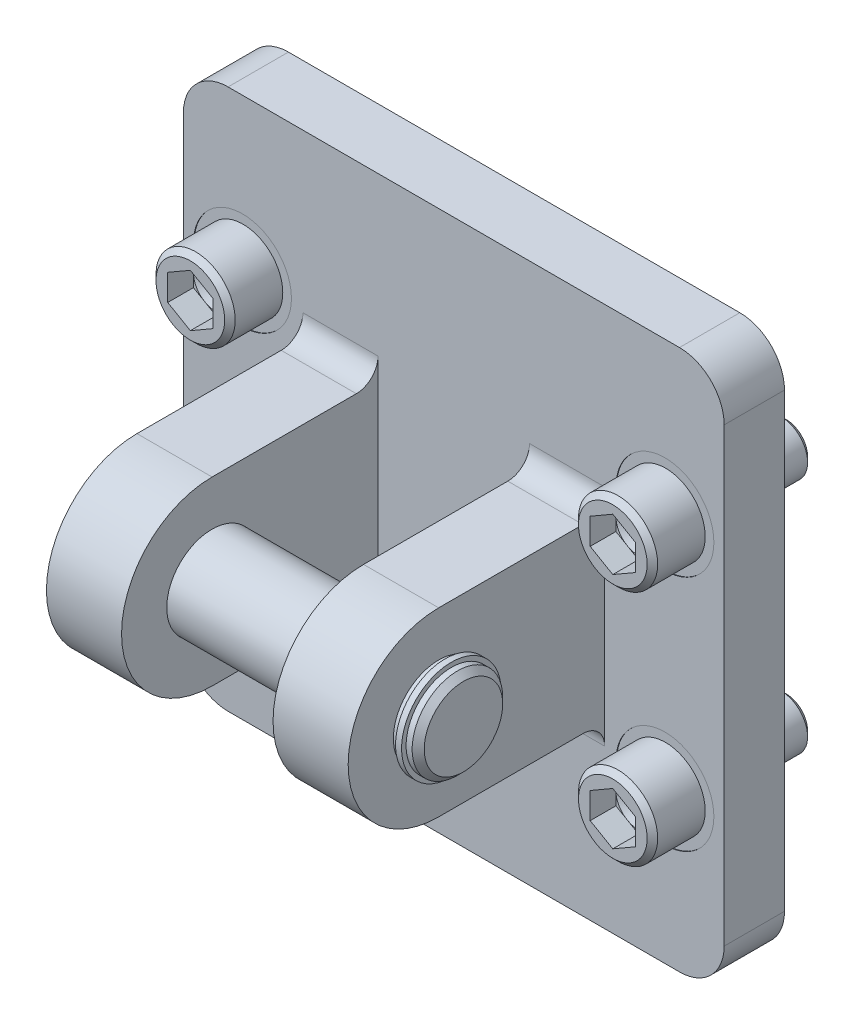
ISO-10303-21;
HEADER;
FILE_DESCRIPTION(('STEP AP214'),'2;1');
FILE_NAME('part.step','',(''),(''),'','','');
FILE_SCHEMA(('AUTOMOTIVE_DESIGN { 1 0 10303 214 1 1 1 1 }'));
ENDSEC;
DATA;
#1=APPLICATION_CONTEXT('core data for automotive mechanical design processes');
#2=APPLICATION_PROTOCOL_DEFINITION('international standard','automotive_design',2000,#1);
#3=PRODUCT_CONTEXT('',#1,'mechanical');
#4=PRODUCT('Part','Part','',(#3));
#5=PRODUCT_RELATED_PRODUCT_CATEGORY('part','',(#4));
#6=PRODUCT_DEFINITION_FORMATION('','',#4);
#7=PRODUCT_DEFINITION_CONTEXT('part definition',#1,'design');
#8=PRODUCT_DEFINITION('design','',#6,#7);
#9=PRODUCT_DEFINITION_SHAPE('','',#8);
#10=(LENGTH_UNIT() NAMED_UNIT(*) SI_UNIT(.MILLI.,.METRE.));
#11=(NAMED_UNIT(*) PLANE_ANGLE_UNIT() SI_UNIT($,.RADIAN.));
#12=(NAMED_UNIT(*) SI_UNIT($,.STERADIAN.) SOLID_ANGLE_UNIT());
#13=UNCERTAINTY_MEASURE_WITH_UNIT(LENGTH_MEASURE(1.E-05),#10,'distance_accuracy_value','');
#14=(GEOMETRIC_REPRESENTATION_CONTEXT(3) GLOBAL_UNCERTAINTY_ASSIGNED_CONTEXT((#13)) GLOBAL_UNIT_ASSIGNED_CONTEXT((#10,
#11,#12)) REPRESENTATION_CONTEXT('',''));
#15=CARTESIAN_POINT('',(0.,0.,0.));
#16=DIRECTION('',(0.,0.,1.));
#17=DIRECTION('',(1.,0.,0.));
#18=AXIS2_PLACEMENT_3D('',#15,#16,#17);
#19=CARTESIAN_POINT('',(34.417,0.,47.625));
#20=DIRECTION('',(1.,0.,0.));
#21=DIRECTION('',(0.,0.,-1.));
#22=AXIS2_PLACEMENT_3D('',#19,#20,#21);
#23=PLANE('',#22);
#24=CARTESIAN_POINT('',(34.417,0.,47.625));
#25=DIRECTION('',(1.,0.,0.));
#26=DIRECTION('',(0.,0.,-1.));
#27=AXIS2_PLACEMENT_3D('',#24,#25,#26);
#28=CIRCLE('',#27,10.4775);
#29=CARTESIAN_POINT('',(34.417,0.,37.1475));
#30=VERTEX_POINT('',#29);
#31=EDGE_CURVE('P0_E39',#30,#30,#28,.T.);
#32=ORIENTED_EDGE('',*,*,#31,.T.);
#33=EDGE_LOOP('',(#32));
#34=FACE_BOUND('',#33,.T.);
#35=CARTESIAN_POINT('',(34.417,0.,47.625));
#36=DIRECTION('',(1.,0.,0.));
#37=DIRECTION('',(0.,0.,-1.));
#38=AXIS2_PLACEMENT_3D('',#35,#36,#37);
#39=CIRCLE('',#38,9.525);
#40=CARTESIAN_POINT('',(34.417,0.,38.1));
#41=VERTEX_POINT('',#40);
#42=EDGE_CURVE('P0_E54',#41,#41,#39,.T.);
#43=ORIENTED_EDGE('',*,*,#42,.F.);
#44=EDGE_LOOP('',(#43));
#45=FACE_BOUND('',#44,.T.);
#46=ADVANCED_FACE('P0_F13',(#34,#45),#23,.T.);
#47=CARTESIAN_POINT('',(33.147,0.,47.625));
#48=DIRECTION('',(-1.,0.,0.));
#49=DIRECTION('',(0.,0.,1.));
#50=AXIS2_PLACEMENT_3D('',#47,#48,#49);
#51=CYLINDRICAL_SURFACE('',#50,9.525);
#52=CARTESIAN_POINT('',(33.147,0.,47.625));
#53=DIRECTION('',(1.,0.,0.));
#54=DIRECTION('',(0.,0.,-1.));
#55=AXIS2_PLACEMENT_3D('',#52,#53,#54);
#56=CIRCLE('',#55,9.525);
#57=CARTESIAN_POINT('',(33.147,0.,38.1));
#58=VERTEX_POINT('',#57);
#59=EDGE_CURVE('P0_E36',#58,#58,#56,.T.);
#60=ORIENTED_EDGE('',*,*,#59,.F.);
#61=EDGE_LOOP('',(#60));
#62=FACE_BOUND('',#61,.T.);
#63=CARTESIAN_POINT('',(-33.655,0.,47.625));
#64=DIRECTION('',(-1.,0.,0.));
#65=DIRECTION('',(0.,0.,1.));
#66=AXIS2_PLACEMENT_3D('',#63,#64,#65);
#67=CIRCLE('',#66,9.525);
#68=CARTESIAN_POINT('',(-33.655,0.,57.15));
#69=VERTEX_POINT('',#68);
#70=EDGE_CURVE('P0_E45',#69,#69,#67,.T.);
#71=ORIENTED_EDGE('',*,*,#70,.F.);
#72=EDGE_LOOP('',(#71));
#73=FACE_BOUND('',#72,.T.);
#74=ADVANCED_FACE('P0_F15',(#62,#73),#51,.T.);
#75=CARTESIAN_POINT('',(33.147,0.,47.625));
#76=DIRECTION('',(1.,0.,0.));
#77=DIRECTION('',(0.,0.,-1.));
#78=AXIS2_PLACEMENT_3D('',#75,#76,#77);
#79=PLANE('',#78);
#80=CARTESIAN_POINT('',(33.147,0.,47.625));
#81=DIRECTION('',(1.,0.,0.));
#82=DIRECTION('',(0.,0.,-1.));
#83=AXIS2_PLACEMENT_3D('',#80,#81,#82);
#84=CIRCLE('',#83,10.4775);
#85=CARTESIAN_POINT('',(33.147,0.,37.1475));
#86=VERTEX_POINT('',#85);
#87=EDGE_CURVE('P0_E42',#86,#86,#84,.T.);
#88=ORIENTED_EDGE('',*,*,#87,.F.);
#89=EDGE_LOOP('',(#88));
#90=FACE_BOUND('',#89,.T.);
#91=ORIENTED_EDGE('',*,*,#59,.T.);
#92=EDGE_LOOP('',(#91));
#93=FACE_BOUND('',#92,.T.);
#94=ADVANCED_FACE('P0_F67',(#90,#93),#79,.F.);
#95=CARTESIAN_POINT('',(34.417,0.,47.625));
#96=DIRECTION('',(-1.,0.,0.));
#97=DIRECTION('',(0.,0.,1.));
#98=AXIS2_PLACEMENT_3D('',#95,#96,#97);
#99=CYLINDRICAL_SURFACE('',#98,10.4775);
#100=ORIENTED_EDGE('',*,*,#31,.F.);
#101=EDGE_LOOP('',(#100));
#102=FACE_BOUND('',#101,.T.);
#103=ORIENTED_EDGE('',*,*,#87,.T.);
#104=EDGE_LOOP('',(#103));
#105=FACE_BOUND('',#104,.T.);
#106=ADVANCED_FACE('P0_F71',(#102,#105),#99,.T.);
#107=CARTESIAN_POINT('',(-33.655,0.,47.625));
#108=DIRECTION('',(-1.,0.,0.));
#109=DIRECTION('',(0.,0.,-1.));
#110=AXIS2_PLACEMENT_3D('',#107,#108,#109);
#111=PLANE('',#110);
#112=CARTESIAN_POINT('',(-33.655,0.,47.625));
#113=DIRECTION('',(1.,0.,0.));
#114=DIRECTION('',(0.,0.,-1.));
#115=AXIS2_PLACEMENT_3D('',#112,#113,#114);
#116=CIRCLE('',#115,10.4775);
#117=CARTESIAN_POINT('',(-33.655,0.,37.1475));
#118=VERTEX_POINT('',#117);
#119=EDGE_CURVE('P0_E51',#118,#118,#116,.T.);
#120=ORIENTED_EDGE('',*,*,#119,.T.);
#121=EDGE_LOOP('',(#120));
#122=FACE_BOUND('',#121,.T.);
#123=ORIENTED_EDGE('',*,*,#70,.T.);
#124=EDGE_LOOP('',(#123));
#125=FACE_BOUND('',#124,.T.);
#126=ADVANCED_FACE('P0_F73',(#122,#125),#111,.F.);
#127=CARTESIAN_POINT('',(-34.925,0.,47.625));
#128=DIRECTION('',(1.,0.,0.));
#129=DIRECTION('',(0.,0.,-1.));
#130=AXIS2_PLACEMENT_3D('',#127,#128,#129);
#131=CYLINDRICAL_SURFACE('',#130,10.4775);
#132=CARTESIAN_POINT('',(-34.925,0.,47.625));
#133=DIRECTION('',(1.,0.,0.));
#134=DIRECTION('',(0.,0.,-1.));
#135=AXIS2_PLACEMENT_3D('',#132,#133,#134);
#136=CIRCLE('',#135,10.4775);
#137=CARTESIAN_POINT('',(-34.925,0.,37.1475));
#138=VERTEX_POINT('',#137);
#139=EDGE_CURVE('P0_E48',#138,#138,#136,.T.);
#140=ORIENTED_EDGE('',*,*,#139,.T.);
#141=EDGE_LOOP('',(#140));
#142=FACE_BOUND('',#141,.T.);
#143=ORIENTED_EDGE('',*,*,#119,.F.);
#144=EDGE_LOOP('',(#143));
#145=FACE_BOUND('',#144,.T.);
#146=ADVANCED_FACE('P0_F79',(#142,#145),#131,.T.);
#147=CARTESIAN_POINT('',(-34.925,0.,47.625));
#148=DIRECTION('',(-1.,0.,0.));
#149=DIRECTION('',(0.,0.,-1.));
#150=AXIS2_PLACEMENT_3D('',#147,#148,#149);
#151=PLANE('',#150);
#152=CARTESIAN_POINT('',(-34.925,0.,47.625));
#153=DIRECTION('',(-1.,0.,0.));
#154=DIRECTION('',(0.,0.,1.));
#155=AXIS2_PLACEMENT_3D('',#152,#153,#154);
#156=CIRCLE('',#155,9.525);
#157=CARTESIAN_POINT('',(-34.925,0.,57.15));
#158=VERTEX_POINT('',#157);
#159=EDGE_CURVE('P0_E33',#158,#158,#156,.T.);
#160=ORIENTED_EDGE('',*,*,#159,.F.);
#161=EDGE_LOOP('',(#160));
#162=FACE_BOUND('',#161,.T.);
#163=ORIENTED_EDGE('',*,*,#139,.F.);
#164=EDGE_LOOP('',(#163));
#165=FACE_BOUND('',#164,.T.);
#166=ADVANCED_FACE('P0_F139',(#162,#165),#151,.T.);
#167=CARTESIAN_POINT('',(36.957,0.,47.625));
#168=DIRECTION('',(-1.,0.,0.));
#169=DIRECTION('',(0.,0.,1.));
#170=AXIS2_PLACEMENT_3D('',#167,#168,#169);
#171=CYLINDRICAL_SURFACE('',#170,9.525);
#172=CARTESIAN_POINT('',(35.687,0.,47.625));
#173=DIRECTION('',(1.,0.,0.));
#174=DIRECTION('',(0.,0.,-1.));
#175=AXIS2_PLACEMENT_3D('',#172,#173,#174);
#176=CIRCLE('',#175,9.525);
#177=CARTESIAN_POINT('',(35.687,0.,38.1));
#178=VERTEX_POINT('',#177);
#179=EDGE_CURVE('P0_E9',#178,#178,#176,.F.);
#180=ORIENTED_EDGE('',*,*,#179,.T.);
#181=EDGE_LOOP('',(#180));
#182=FACE_BOUND('',#181,.T.);
#183=ORIENTED_EDGE('',*,*,#42,.T.);
#184=EDGE_LOOP('',(#183));
#185=FACE_BOUND('',#184,.T.);
#186=ADVANCED_FACE('P0_F58',(#182,#185),#171,.T.);
#187=CARTESIAN_POINT('',(36.957,0.,47.625));
#188=DIRECTION('',(1.,0.,0.));
#189=DIRECTION('',(0.,0.,-1.));
#190=AXIS2_PLACEMENT_3D('',#187,#188,#189);
#191=PLANE('',#190);
#192=CARTESIAN_POINT('',(36.957,0.,47.625));
#193=DIRECTION('',(1.,0.,0.));
#194=DIRECTION('',(0.,0.,-1.));
#195=AXIS2_PLACEMENT_3D('',#192,#193,#194);
#196=CIRCLE('',#195,8.255);
#197=CARTESIAN_POINT('',(36.957,0.,39.37));
#198=VERTEX_POINT('',#197);
#199=EDGE_CURVE('P0_E20',#198,#198,#196,.T.);
#200=ORIENTED_EDGE('',*,*,#199,.T.);
#201=EDGE_LOOP('',(#200));
#202=FACE_BOUND('',#201,.T.);
#203=ADVANCED_FACE('P0_F157',(#202),#191,.T.);
#204=CARTESIAN_POINT('',(-37.465,0.,47.625));
#205=DIRECTION('',(1.,0.,0.));
#206=DIRECTION('',(0.,0.,-1.));
#207=AXIS2_PLACEMENT_3D('',#204,#205,#206);
#208=CYLINDRICAL_SURFACE('',#207,9.525);
#209=CARTESIAN_POINT('',(-36.195,0.,47.625));
#210=DIRECTION('',(-1.,0.,0.));
#211=DIRECTION('',(0.,0.,1.));
#212=AXIS2_PLACEMENT_3D('',#209,#210,#211);
#213=CIRCLE('',#212,9.525);
#214=CARTESIAN_POINT('',(-36.195,0.,57.15));
#215=VERTEX_POINT('',#214);
#216=EDGE_CURVE('P0_E28',#215,#215,#213,.F.);
#217=ORIENTED_EDGE('',*,*,#216,.T.);
#218=EDGE_LOOP('',(#217));
#219=FACE_BOUND('',#218,.T.);
#220=ORIENTED_EDGE('',*,*,#159,.T.);
#221=EDGE_LOOP('',(#220));
#222=FACE_BOUND('',#221,.T.);
#223=ADVANCED_FACE('P0_F166',(#219,#222),#208,.T.);
#224=CARTESIAN_POINT('',(-37.465,0.,47.625));
#225=DIRECTION('',(-1.,0.,0.));
#226=DIRECTION('',(0.,0.,-1.));
#227=AXIS2_PLACEMENT_3D('',#224,#225,#226);
#228=PLANE('',#227);
#229=CARTESIAN_POINT('',(-37.465,0.,47.625));
#230=DIRECTION('',(-1.,0.,0.));
#231=DIRECTION('',(0.,0.,1.));
#232=AXIS2_PLACEMENT_3D('',#229,#230,#231);
#233=CIRCLE('',#232,8.255);
#234=CARTESIAN_POINT('',(-37.465,0.,55.88));
#235=VERTEX_POINT('',#234);
#236=EDGE_CURVE('P0_E24',#235,#235,#233,.T.);
#237=ORIENTED_EDGE('',*,*,#236,.T.);
#238=EDGE_LOOP('',(#237));
#239=FACE_BOUND('',#238,.T.);
#240=ADVANCED_FACE('P0_F175',(#239),#228,.T.);
#241=CARTESIAN_POINT('',(-36.195,0.,47.625));
#242=DIRECTION('',(1.,0.,0.));
#243=DIRECTION('',(0.,0.,-1.));
#244=AXIS2_PLACEMENT_3D('',#241,#242,#243);
#245=CONICAL_SURFACE('',#244,9.525,0.785398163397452);
#246=ORIENTED_EDGE('',*,*,#236,.F.);
#247=EDGE_LOOP('',(#246));
#248=FACE_BOUND('',#247,.T.);
#249=ORIENTED_EDGE('',*,*,#216,.F.);
#250=EDGE_LOOP('',(#249));
#251=FACE_BOUND('',#250,.T.);
#252=ADVANCED_FACE('P0_F185',(#248,#251),#245,.T.);
#253=CARTESIAN_POINT('',(36.957,0.,47.625));
#254=DIRECTION('',(-1.,0.,0.));
#255=DIRECTION('',(0.,0.,1.));
#256=AXIS2_PLACEMENT_3D('',#253,#254,#255);
#257=CONICAL_SURFACE('',#256,8.255,0.785398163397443);
#258=ORIENTED_EDGE('',*,*,#179,.F.);
#259=EDGE_LOOP('',(#258));
#260=FACE_BOUND('',#259,.T.);
#261=ORIENTED_EDGE('',*,*,#199,.F.);
#262=EDGE_LOOP('',(#261));
#263=FACE_BOUND('',#262,.T.);
#264=ADVANCED_FACE('P0_F195',(#260,#263),#257,.T.);
#265=CLOSED_SHELL('',(#46,#74,#94,#106,#126,#146,#166,#186,#203,#223,#240,#252,#264));
#266=MANIFOLD_SOLID_BREP('P0_B1',#265);
#267=CARTESIAN_POINT('',(31.75,0.,47.625));
#268=DIRECTION('',(-1.,0.,0.));
#269=DIRECTION('',(0.,0.,1.));
#270=AXIS2_PLACEMENT_3D('',#267,#268,#269);
#271=CYLINDRICAL_SURFACE('',#270,9.54405);
#272=CARTESIAN_POINT('',(-31.75,0.,47.625));
#273=DIRECTION('',(1.,0.,0.));
#274=DIRECTION('',(0.,0.,-1.));
#275=AXIS2_PLACEMENT_3D('',#272,#273,#274);
#276=CIRCLE('',#275,9.54405);
#277=CARTESIAN_POINT('',(-31.75,0.,38.08095));
#278=VERTEX_POINT('',#277);
#279=EDGE_CURVE('P1_E410',#278,#278,#276,.T.);
#280=ORIENTED_EDGE('',*,*,#279,.F.);
#281=EDGE_LOOP('',(#280));
#282=FACE_BOUND('',#281,.T.);
#283=CARTESIAN_POINT('',(-15.9385,0.,47.625));
#284=DIRECTION('',(1.,0.,0.));
#285=DIRECTION('',(0.,0.,-1.));
#286=AXIS2_PLACEMENT_3D('',#283,#284,#285);
#287=CIRCLE('',#286,9.54405);
#288=CARTESIAN_POINT('',(-15.9385,0.,38.08095));
#289=VERTEX_POINT('',#288);
#290=EDGE_CURVE('P1_E413',#289,#289,#287,.T.);
#291=ORIENTED_EDGE('',*,*,#290,.T.);
#292=EDGE_LOOP('',(#291));
#293=FACE_BOUND('',#292,.T.);
#294=ADVANCED_FACE('P1_F15',(#282,#293),#271,.F.);
#295=CARTESIAN_POINT('',(31.75,19.05,47.625));
#296=DIRECTION('',(0.,-1.,0.));
#297=DIRECTION('',(0.,0.,-1.));
#298=AXIS2_PLACEMENT_3D('',#295,#296,#297);
#299=PLANE('',#298);
#300=DIRECTION('',(0.,0.,1.));
#301=VECTOR('',#300,1.);
#302=CARTESIAN_POINT('',(-15.9385,19.05,12.7));
#303=LINE('',#302,#301);
#304=CARTESIAN_POINT('',(-15.9385,19.05,17.272));
#305=VERTEX_POINT('',#304);
#306=CARTESIAN_POINT('',(-15.9385,19.05,47.625));
#307=VERTEX_POINT('',#306);
#308=EDGE_CURVE('P1_E416',#305,#307,#303,.T.);
#309=ORIENTED_EDGE('',*,*,#308,.F.);
#310=DIRECTION('',(-1.,0.,0.));
#311=VECTOR('',#310,1.);
#312=CARTESIAN_POINT('',(31.75,19.05,17.272));
#313=LINE('',#312,#311);
#314=CARTESIAN_POINT('',(-31.75,19.05,17.272));
#315=VERTEX_POINT('',#314);
#316=EDGE_CURVE('P1_E509',#305,#315,#313,.T.);
#317=ORIENTED_EDGE('',*,*,#316,.T.);
#318=DIRECTION('',(0.,0.,1.));
#319=VECTOR('',#318,1.);
#320=CARTESIAN_POINT('',(-31.75,19.05,47.625));
#321=LINE('',#320,#319);
#322=CARTESIAN_POINT('',(-31.75,19.05,47.625));
#323=VERTEX_POINT('',#322);
#324=EDGE_CURVE('P1_E403',#315,#323,#321,.T.);
#325=ORIENTED_EDGE('',*,*,#324,.T.);
#326=DIRECTION('',(-1.,0.,0.));
#327=VECTOR('',#326,1.);
#328=CARTESIAN_POINT('',(31.75,19.05,47.625));
#329=LINE('',#328,#327);
#330=EDGE_CURVE('P1_E377',#307,#323,#329,.T.);
#331=ORIENTED_EDGE('',*,*,#330,.F.);
#332=EDGE_LOOP('',(#309,#317,#325,#331));
#333=FACE_BOUND('',#332,.T.);
#334=ADVANCED_FACE('P1_F761',(#333),#299,.F.);
#335=CARTESIAN_POINT('',(31.75,0.,47.625));
#336=DIRECTION('',(-1.,0.,0.));
#337=DIRECTION('',(0.,0.,1.));
#338=AXIS2_PLACEMENT_3D('',#335,#336,#337);
#339=CYLINDRICAL_SURFACE('',#338,19.05);
#340=CARTESIAN_POINT('',(-15.9385,0.,47.625));
#341=DIRECTION('',(1.,0.,0.));
#342=DIRECTION('',(0.,0.,-1.));
#343=AXIS2_PLACEMENT_3D('',#340,#341,#342);
#344=CIRCLE('',#343,19.05);
#345=CARTESIAN_POINT('',(-15.9385,-19.05,47.625));
#346=VERTEX_POINT('',#345);
#347=EDGE_CURVE('P1_E414',#307,#346,#344,.T.);
#348=ORIENTED_EDGE('',*,*,#347,.F.);
#349=ORIENTED_EDGE('',*,*,#330,.T.);
#350=CARTESIAN_POINT('',(-31.75,0.,47.625));
#351=DIRECTION('',(1.,0.,0.));
#352=DIRECTION('',(0.,0.,-1.));
#353=AXIS2_PLACEMENT_3D('',#350,#351,#352);
#354=CIRCLE('',#353,19.05);
#355=CARTESIAN_POINT('',(-31.75,-19.05,47.625));
#356=VERTEX_POINT('',#355);
#357=EDGE_CURVE('P1_E400',#323,#356,#354,.T.);
#358=ORIENTED_EDGE('',*,*,#357,.T.);
#359=DIRECTION('',(-1.,0.,0.));
#360=VECTOR('',#359,1.);
#361=CARTESIAN_POINT('',(31.75,-19.05,47.625));
#362=LINE('',#361,#360);
#363=EDGE_CURVE('P1_E388',#346,#356,#362,.T.);
#364=ORIENTED_EDGE('',*,*,#363,.F.);
#365=EDGE_LOOP('',(#348,#349,#358,#364));
#366=FACE_BOUND('',#365,.T.);
#367=ADVANCED_FACE('P1_F752',(#366),#339,.T.);
#368=CARTESIAN_POINT('',(31.75,-19.05,47.625));
#369=DIRECTION('',(0.,1.,0.));
#370=DIRECTION('',(0.,0.,1.));
#371=AXIS2_PLACEMENT_3D('',#368,#369,#370);
#372=PLANE('',#371);
#373=DIRECTION('',(0.,0.,-1.));
#374=VECTOR('',#373,1.);
#375=CARTESIAN_POINT('',(-31.75,-19.05,47.625));
#376=LINE('',#375,#374);
#377=CARTESIAN_POINT('',(-31.75,-19.05,17.272));
#378=VERTEX_POINT('',#377);
#379=EDGE_CURVE('P1_E397',#356,#378,#376,.T.);
#380=ORIENTED_EDGE('',*,*,#379,.T.);
#381=DIRECTION('',(-1.,0.,0.));
#382=VECTOR('',#381,1.);
#383=CARTESIAN_POINT('',(31.75,-19.05,17.272));
#384=LINE('',#383,#382);
#385=CARTESIAN_POINT('',(-15.9385,-19.05,17.272));
#386=VERTEX_POINT('',#385);
#387=EDGE_CURVE('P1_E495',#378,#386,#384,.F.);
#388=ORIENTED_EDGE('',*,*,#387,.T.);
#389=DIRECTION('',(0.,0.,-1.));
#390=VECTOR('',#389,1.);
#391=CARTESIAN_POINT('',(-15.9385,-19.05,47.625));
#392=LINE('',#391,#390);
#393=EDGE_CURVE('P1_E373',#346,#386,#392,.T.);
#394=ORIENTED_EDGE('',*,*,#393,.F.);
#395=ORIENTED_EDGE('',*,*,#363,.T.);
#396=EDGE_LOOP('',(#380,#388,#394,#395));
#397=FACE_BOUND('',#396,.T.);
#398=ADVANCED_FACE('P1_F743',(#397),#372,.F.);
#399=DIRECTION('',(0.,0.,1.));
#400=VECTOR('',#399,1.);
#401=CARTESIAN_POINT('',(31.75,19.05,47.625));
#402=LINE('',#401,#400);
#403=CARTESIAN_POINT('',(31.75,19.05,17.272));
#404=VERTEX_POINT('',#403);
#405=CARTESIAN_POINT('',(31.75,19.05,47.625));
#406=VERTEX_POINT('',#405);
#407=EDGE_CURVE('P1_E393',#404,#406,#402,.T.);
#408=ORIENTED_EDGE('',*,*,#407,.F.);
#409=DIRECTION('',(-1.,0.,0.));
#410=VECTOR('',#409,1.);
#411=CARTESIAN_POINT('',(31.75,19.05,17.272));
#412=LINE('',#411,#410);
#413=CARTESIAN_POINT('',(15.9385,19.05,17.272));
#414=VERTEX_POINT('',#413);
#415=EDGE_CURVE('P1_E364',#404,#414,#412,.T.);
#416=ORIENTED_EDGE('',*,*,#415,.T.);
#417=DIRECTION('',(0.,0.,1.));
#418=VECTOR('',#417,1.);
#419=CARTESIAN_POINT('',(15.9385,19.05,12.7));
#420=LINE('',#419,#418);
#421=CARTESIAN_POINT('',(15.9385,19.05,47.625));
#422=VERTEX_POINT('',#421);
#423=EDGE_CURVE('P1_E357',#414,#422,#420,.T.);
#424=ORIENTED_EDGE('',*,*,#423,.T.);
#425=EDGE_CURVE('P1_E361',#406,#422,#329,.T.);
#426=ORIENTED_EDGE('',*,*,#425,.F.);
#427=EDGE_LOOP('',(#408,#416,#424,#426));
#428=FACE_BOUND('',#427,.T.);
#429=ADVANCED_FACE('P1_F359',(#428),#299,.F.);
#430=ORIENTED_EDGE('',*,*,#425,.T.);
#431=CARTESIAN_POINT('',(15.9385,0.,47.625));
#432=DIRECTION('',(1.,0.,0.));
#433=DIRECTION('',(0.,0.,-1.));
#434=AXIS2_PLACEMENT_3D('',#431,#432,#433);
#435=CIRCLE('',#434,19.05);
#436=CARTESIAN_POINT('',(15.9385,-19.05,47.625));
#437=VERTEX_POINT('',#436);
#438=EDGE_CURVE('P1_E367',#422,#437,#435,.T.);
#439=ORIENTED_EDGE('',*,*,#438,.T.);
#440=CARTESIAN_POINT('',(31.75,-19.05,47.625));
#441=VERTEX_POINT('',#440);
#442=EDGE_CURVE('P1_E381',#441,#437,#362,.T.);
#443=ORIENTED_EDGE('',*,*,#442,.F.);
#444=CARTESIAN_POINT('',(31.75,0.,47.625));
#445=DIRECTION('',(1.,0.,0.));
#446=DIRECTION('',(0.,0.,-1.));
#447=AXIS2_PLACEMENT_3D('',#444,#445,#446);
#448=CIRCLE('',#447,19.05);
#449=EDGE_CURVE('P1_E376',#406,#441,#448,.T.);
#450=ORIENTED_EDGE('',*,*,#449,.F.);
#451=EDGE_LOOP('',(#430,#439,#443,#450));
#452=FACE_BOUND('',#451,.T.);
#453=ADVANCED_FACE('P1_F375',(#452),#339,.T.);
#454=DIRECTION('',(0.,0.,-1.));
#455=VECTOR('',#454,1.);
#456=CARTESIAN_POINT('',(15.9385,-19.05,47.625));
#457=LINE('',#456,#455);
#458=CARTESIAN_POINT('',(15.9385,-19.05,17.272));
#459=VERTEX_POINT('',#458);
#460=EDGE_CURVE('P1_E350',#437,#459,#457,.T.);
#461=ORIENTED_EDGE('',*,*,#460,.T.);
#462=DIRECTION('',(-1.,0.,0.));
#463=VECTOR('',#462,1.);
#464=CARTESIAN_POINT('',(31.75,-19.05,17.272));
#465=LINE('',#464,#463);
#466=CARTESIAN_POINT('',(31.75,-19.05,17.272));
#467=VERTEX_POINT('',#466);
#468=EDGE_CURVE('P1_E492',#459,#467,#465,.F.);
#469=ORIENTED_EDGE('',*,*,#468,.T.);
#470=DIRECTION('',(0.,0.,-1.));
#471=VECTOR('',#470,1.);
#472=CARTESIAN_POINT('',(31.75,-19.05,47.625));
#473=LINE('',#472,#471);
#474=EDGE_CURVE('P1_E389',#441,#467,#473,.T.);
#475=ORIENTED_EDGE('',*,*,#474,.F.);
#476=ORIENTED_EDGE('',*,*,#442,.T.);
#477=EDGE_LOOP('',(#461,#469,#475,#476));
#478=FACE_BOUND('',#477,.T.);
#479=ADVANCED_FACE('P1_F739',(#478),#372,.F.);
#480=CARTESIAN_POINT('',(15.9385,0.,47.625));
#481=DIRECTION('',(1.,0.,0.));
#482=DIRECTION('',(0.,0.,-1.));
#483=AXIS2_PLACEMENT_3D('',#480,#481,#482);
#484=CIRCLE('',#483,9.54405);
#485=CARTESIAN_POINT('',(15.9385,0.,38.08095));
#486=VERTEX_POINT('',#485);
#487=EDGE_CURVE('P1_E417',#486,#486,#484,.T.);
#488=ORIENTED_EDGE('',*,*,#487,.F.);
#489=EDGE_LOOP('',(#488));
#490=FACE_BOUND('',#489,.T.);
#491=CARTESIAN_POINT('',(31.75,0.,47.625));
#492=DIRECTION('',(1.,0.,0.));
#493=DIRECTION('',(0.,0.,-1.));
#494=AXIS2_PLACEMENT_3D('',#491,#492,#493);
#495=CIRCLE('',#494,9.54405);
#496=CARTESIAN_POINT('',(31.75,0.,38.08095));
#497=VERTEX_POINT('',#496);
#498=EDGE_CURVE('P1_E407',#497,#497,#495,.T.);
#499=ORIENTED_EDGE('',*,*,#498,.T.);
#500=EDGE_LOOP('',(#499));
#501=FACE_BOUND('',#500,.T.);
#502=ADVANCED_FACE('P1_F741',(#490,#501),#271,.F.);
#503=CARTESIAN_POINT('',(-56.896,-23.622,17.272));
#504=DIRECTION('',(-1.,0.,0.));
#505=DIRECTION('',(0.,0.,1.));
#506=AXIS2_PLACEMENT_3D('',#503,#504,#505);
#507=CYLINDRICAL_SURFACE('',#506,4.572);
#508=CARTESIAN_POINT('',(-15.9385,-23.622,17.272));
#509=DIRECTION('',(1.,0.,0.));
#510=DIRECTION('',(0.,0.,-1.));
#511=AXIS2_PLACEMENT_3D('',#508,#509,#510);
#512=CIRCLE('',#511,4.572);
#513=CARTESIAN_POINT('',(-15.9385,-23.622,12.7));
#514=VERTEX_POINT('',#513);
#515=EDGE_CURVE('P1_E482',#386,#514,#512,.F.);
#516=ORIENTED_EDGE('',*,*,#515,.F.);
#517=ORIENTED_EDGE('',*,*,#387,.F.);
#518=CARTESIAN_POINT('',(-31.75,-23.622,17.272));
#519=DIRECTION('',(1.,0.,0.));
#520=DIRECTION('',(0.,0.,-1.));
#521=AXIS2_PLACEMENT_3D('',#518,#519,#520);
#522=CIRCLE('',#521,4.572);
#523=CARTESIAN_POINT('',(-31.75,-23.622,12.7));
#524=VERTEX_POINT('',#523);
#525=EDGE_CURVE('P1_E485',#524,#378,#522,.T.);
#526=ORIENTED_EDGE('',*,*,#525,.F.);
#527=DIRECTION('',(-1.,0.,0.));
#528=VECTOR('',#527,1.);
#529=CARTESIAN_POINT('',(-56.896,-23.622,12.7));
#530=LINE('',#529,#528);
#531=EDGE_CURVE('P1_E500',#514,#524,#530,.T.);
#532=ORIENTED_EDGE('',*,*,#531,.F.);
#533=EDGE_LOOP('',(#516,#517,#526,#532));
#534=FACE_BOUND('',#533,.T.);
#535=ADVANCED_FACE('P1_F748',(#534),#507,.F.);
#536=CARTESIAN_POINT('',(-15.9385,0.,47.625));
#537=DIRECTION('',(1.,0.,0.));
#538=DIRECTION('',(0.,0.,-1.));
#539=AXIS2_PLACEMENT_3D('',#536,#537,#538);
#540=PLANE('',#539);
#541=ORIENTED_EDGE('',*,*,#290,.F.);
#542=EDGE_LOOP('',(#541));
#543=FACE_BOUND('',#542,.T.);
#544=ORIENTED_EDGE('',*,*,#393,.T.);
#545=ORIENTED_EDGE('',*,*,#515,.T.);
#546=DIRECTION('',(0.,1.,0.));
#547=VECTOR('',#546,1.);
#548=CARTESIAN_POINT('',(-15.9385,-19.05,12.7));
#549=LINE('',#548,#547);
#550=CARTESIAN_POINT('',(-15.9385,23.622,12.7));
#551=VERTEX_POINT('',#550);
#552=EDGE_CURVE('P1_E419',#514,#551,#549,.T.);
#553=ORIENTED_EDGE('',*,*,#552,.T.);
#554=CARTESIAN_POINT('',(-15.9385,23.622,17.272));
#555=DIRECTION('',(1.,0.,0.));
#556=DIRECTION('',(0.,0.,-1.));
#557=AXIS2_PLACEMENT_3D('',#554,#555,#556);
#558=CIRCLE('',#557,4.572);
#559=EDGE_CURVE('P1_E487',#551,#305,#558,.F.);
#560=ORIENTED_EDGE('',*,*,#559,.T.);
#561=ORIENTED_EDGE('',*,*,#308,.T.);
#562=ORIENTED_EDGE('',*,*,#347,.T.);
#563=EDGE_LOOP('',(#544,#545,#553,#560,#561,#562));
#564=FACE_BOUND('',#563,.T.);
#565=ADVANCED_FACE('P1_F774',(#543,#564),#540,.T.);
#566=CARTESIAN_POINT('',(31.75,23.622,17.272));
#567=DIRECTION('',(-1.,0.,0.));
#568=DIRECTION('',(0.,0.,1.));
#569=AXIS2_PLACEMENT_3D('',#566,#567,#568);
#570=CYLINDRICAL_SURFACE('',#569,4.572);
#571=ORIENTED_EDGE('',*,*,#559,.F.);
#572=DIRECTION('',(-1.,0.,0.));
#573=VECTOR('',#572,1.);
#574=CARTESIAN_POINT('',(-56.896,23.622,12.7));
#575=LINE('',#574,#573);
#576=CARTESIAN_POINT('',(-31.75,23.622,12.7));
#577=VERTEX_POINT('',#576);
#578=EDGE_CURVE('P1_E497',#577,#551,#575,.F.);
#579=ORIENTED_EDGE('',*,*,#578,.F.);
#580=CARTESIAN_POINT('',(-31.75,23.622,17.272));
#581=DIRECTION('',(1.,0.,0.));
#582=DIRECTION('',(0.,0.,-1.));
#583=AXIS2_PLACEMENT_3D('',#580,#581,#582);
#584=CIRCLE('',#583,4.572);
#585=EDGE_CURVE('P1_E489',#315,#577,#584,.T.);
#586=ORIENTED_EDGE('',*,*,#585,.F.);
#587=ORIENTED_EDGE('',*,*,#316,.F.);
#588=EDGE_LOOP('',(#571,#579,#586,#587));
#589=FACE_BOUND('',#588,.T.);
#590=ADVANCED_FACE('P1_F786',(#589),#570,.F.);
#591=CARTESIAN_POINT('',(-31.75,0.,47.625));
#592=DIRECTION('',(1.,0.,0.));
#593=DIRECTION('',(0.,0.,-1.));
#594=AXIS2_PLACEMENT_3D('',#591,#592,#593);
#595=PLANE('',#594);
#596=DIRECTION('',(0.,1.,0.));
#597=VECTOR('',#596,1.);
#598=CARTESIAN_POINT('',(-31.75,-19.05,12.7));
#599=LINE('',#598,#597);
#600=EDGE_CURVE('P1_E405',#524,#577,#599,.T.);
#601=ORIENTED_EDGE('',*,*,#600,.F.);
#602=ORIENTED_EDGE('',*,*,#525,.T.);
#603=ORIENTED_EDGE('',*,*,#379,.F.);
#604=ORIENTED_EDGE('',*,*,#357,.F.);
#605=ORIENTED_EDGE('',*,*,#324,.F.);
#606=ORIENTED_EDGE('',*,*,#585,.T.);
#607=EDGE_LOOP('',(#601,#602,#603,#604,#605,#606));
#608=FACE_BOUND('',#607,.T.);
#609=ORIENTED_EDGE('',*,*,#279,.T.);
#610=EDGE_LOOP('',(#609));
#611=FACE_BOUND('',#610,.T.);
#612=ADVANCED_FACE('P1_F778',(#608,#611),#595,.F.);
#613=CARTESIAN_POINT('',(-47.498,-47.498,12.7));
#614=DIRECTION('',(0.,0.,-1.));
#615=DIRECTION('',(-1.,0.,0.));
#616=AXIS2_PLACEMENT_3D('',#613,#614,#615);
#617=CYLINDRICAL_SURFACE('',#616,9.398);
#618=CARTESIAN_POINT('',(-47.498,-47.498,12.7));
#619=DIRECTION('',(0.,0.,1.));
#620=DIRECTION('',(1.,0.,0.));
#621=AXIS2_PLACEMENT_3D('',#618,#619,#620);
#622=CIRCLE('',#621,9.398);
#623=CARTESIAN_POINT('',(-56.896,-47.498,12.7));
#624=VERTEX_POINT('',#623);
#625=CARTESIAN_POINT('',(-47.498,-56.896,12.7));
#626=VERTEX_POINT('',#625);
#627=EDGE_CURVE('P1_E532',#624,#626,#622,.T.);
#628=ORIENTED_EDGE('',*,*,#627,.F.);
#629=DIRECTION('',(0.,0.,-1.));
#630=VECTOR('',#629,1.);
#631=CARTESIAN_POINT('',(-56.896,-47.498,12.7));
#632=LINE('',#631,#630);
#633=CARTESIAN_POINT('',(-56.896,-47.498,0.));
#634=VERTEX_POINT('',#633);
#635=EDGE_CURVE('P1_E550',#634,#624,#632,.F.);
#636=ORIENTED_EDGE('',*,*,#635,.F.);
#637=CARTESIAN_POINT('',(-47.498,-47.498,0.));
#638=DIRECTION('',(0.,0.,1.));
#639=DIRECTION('',(1.,0.,0.));
#640=AXIS2_PLACEMENT_3D('',#637,#638,#639);
#641=CIRCLE('',#640,9.398);
#642=CARTESIAN_POINT('',(-47.498,-56.896,0.));
#643=VERTEX_POINT('',#642);
#644=EDGE_CURVE('P1_E545',#643,#634,#641,.F.);
#645=ORIENTED_EDGE('',*,*,#644,.F.);
#646=DIRECTION('',(0.,0.,-1.));
#647=VECTOR('',#646,1.);
#648=CARTESIAN_POINT('',(-47.498,-56.896,12.7));
#649=LINE('',#648,#647);
#650=EDGE_CURVE('P1_E518',#626,#643,#649,.T.);
#651=ORIENTED_EDGE('',*,*,#650,.F.);
#652=EDGE_LOOP('',(#628,#636,#645,#651));
#653=FACE_BOUND('',#652,.T.);
#654=ADVANCED_FACE('P1_F609',(#653),#617,.T.);
#655=CARTESIAN_POINT('',(-56.896,-56.896,12.7));
#656=DIRECTION('',(0.,1.,0.));
#657=DIRECTION('',(-1.,0.,0.));
#658=AXIS2_PLACEMENT_3D('',#655,#656,#657);
#659=PLANE('',#658);
#660=DIRECTION('',(1.,0.,0.));
#661=VECTOR('',#660,1.);
#662=CARTESIAN_POINT('',(-56.896,-56.896,0.));
#663=LINE('',#662,#661);
#664=CARTESIAN_POINT('',(47.498,-56.896,0.));
#665=VERTEX_POINT('',#664);
#666=EDGE_CURVE('P1_E383',#643,#665,#663,.T.);
#667=ORIENTED_EDGE('',*,*,#666,.T.);
#668=DIRECTION('',(0.,0.,-1.));
#669=VECTOR('',#668,1.);
#670=CARTESIAN_POINT('',(47.498,-56.896,12.7));
#671=LINE('',#670,#669);
#672=CARTESIAN_POINT('',(47.498,-56.896,12.7));
#673=VERTEX_POINT('',#672);
#674=EDGE_CURVE('P1_E512',#665,#673,#671,.F.);
#675=ORIENTED_EDGE('',*,*,#674,.T.);
#676=DIRECTION('',(1.,0.,0.));
#677=VECTOR('',#676,1.);
#678=CARTESIAN_POINT('',(-56.896,-56.896,12.7));
#679=LINE('',#678,#677);
#680=EDGE_CURVE('P1_E558',#626,#673,#679,.T.);
#681=ORIENTED_EDGE('',*,*,#680,.F.);
#682=ORIENTED_EDGE('',*,*,#650,.T.);
#683=EDGE_LOOP('',(#667,#675,#681,#682));
#684=FACE_BOUND('',#683,.T.);
#685=ADVANCED_FACE('P1_F573',(#684),#659,.F.);
#686=CARTESIAN_POINT('',(47.498,-47.498,12.7));
#687=DIRECTION('',(0.,0.,-1.));
#688=DIRECTION('',(-1.,0.,0.));
#689=AXIS2_PLACEMENT_3D('',#686,#687,#688);
#690=CYLINDRICAL_SURFACE('',#689,9.398);
#691=CARTESIAN_POINT('',(47.498,-47.498,12.7));
#692=DIRECTION('',(0.,0.,1.));
#693=DIRECTION('',(1.,0.,0.));
#694=AXIS2_PLACEMENT_3D('',#691,#692,#693);
#695=CIRCLE('',#694,9.398);
#696=CARTESIAN_POINT('',(56.896,-47.498,12.7));
#697=VERTEX_POINT('',#696);
#698=EDGE_CURVE('P1_E530',#673,#697,#695,.T.);
#699=ORIENTED_EDGE('',*,*,#698,.F.);
#700=ORIENTED_EDGE('',*,*,#674,.F.);
#701=CARTESIAN_POINT('',(47.498,-47.498,0.));
#702=DIRECTION('',(0.,0.,1.));
#703=DIRECTION('',(1.,0.,0.));
#704=AXIS2_PLACEMENT_3D('',#701,#702,#703);
#705=CIRCLE('',#704,9.398);
#706=CARTESIAN_POINT('',(56.896,-47.498,0.));
#707=VERTEX_POINT('',#706);
#708=EDGE_CURVE('P1_E543',#707,#665,#705,.F.);
#709=ORIENTED_EDGE('',*,*,#708,.F.);
#710=DIRECTION('',(0.,0.,-1.));
#711=VECTOR('',#710,1.);
#712=CARTESIAN_POINT('',(56.896,-47.498,12.7));
#713=LINE('',#712,#711);
#714=EDGE_CURVE('P1_E523',#697,#707,#713,.T.);
#715=ORIENTED_EDGE('',*,*,#714,.F.);
#716=EDGE_LOOP('',(#699,#700,#709,#715));
#717=FACE_BOUND('',#716,.T.);
#718=ADVANCED_FACE('P1_F579',(#717),#690,.T.);
#719=CARTESIAN_POINT('',(56.896,56.896,12.7));
#720=DIRECTION('',(-1.,0.,0.));
#721=DIRECTION('',(0.,-1.,0.));
#722=AXIS2_PLACEMENT_3D('',#719,#720,#721);
#723=PLANE('',#722);
#724=DIRECTION('',(0.,1.,0.));
#725=VECTOR('',#724,1.);
#726=CARTESIAN_POINT('',(56.896,56.896,0.));
#727=LINE('',#726,#725);
#728=CARTESIAN_POINT('',(56.896,47.498,0.));
#729=VERTEX_POINT('',#728);
#730=EDGE_CURVE('P1_E567',#707,#729,#727,.T.);
#731=ORIENTED_EDGE('',*,*,#730,.T.);
#732=DIRECTION('',(0.,0.,-1.));
#733=VECTOR('',#732,1.);
#734=CARTESIAN_POINT('',(56.896,47.498,12.7));
#735=LINE('',#734,#733);
#736=CARTESIAN_POINT('',(56.896,47.498,12.7));
#737=VERTEX_POINT('',#736);
#738=EDGE_CURVE('P1_E521',#729,#737,#735,.F.);
#739=ORIENTED_EDGE('',*,*,#738,.T.);
#740=DIRECTION('',(0.,1.,0.));
#741=VECTOR('',#740,1.);
#742=CARTESIAN_POINT('',(56.896,56.896,12.7));
#743=LINE('',#742,#741);
#744=EDGE_CURVE('P1_E555',#697,#737,#743,.T.);
#745=ORIENTED_EDGE('',*,*,#744,.F.);
#746=ORIENTED_EDGE('',*,*,#714,.T.);
#747=EDGE_LOOP('',(#731,#739,#745,#746));
#748=FACE_BOUND('',#747,.T.);
#749=ADVANCED_FACE('P1_F587',(#748),#723,.F.);
#750=CARTESIAN_POINT('',(47.498,47.498,12.7));
#751=DIRECTION('',(0.,0.,-1.));
#752=DIRECTION('',(-1.,0.,0.));
#753=AXIS2_PLACEMENT_3D('',#750,#751,#752);
#754=CYLINDRICAL_SURFACE('',#753,9.398);
#755=CARTESIAN_POINT('',(47.498,47.498,12.7));
#756=DIRECTION('',(0.,0.,1.));
#757=DIRECTION('',(1.,0.,0.));
#758=AXIS2_PLACEMENT_3D('',#755,#756,#757);
#759=CIRCLE('',#758,9.398);
#760=CARTESIAN_POINT('',(47.498,56.896,12.7));
#761=VERTEX_POINT('',#760);
#762=EDGE_CURVE('P1_E528',#737,#761,#759,.T.);
#763=ORIENTED_EDGE('',*,*,#762,.F.);
#764=ORIENTED_EDGE('',*,*,#738,.F.);
#765=CARTESIAN_POINT('',(47.498,47.498,0.));
#766=DIRECTION('',(0.,0.,1.));
#767=DIRECTION('',(1.,0.,0.));
#768=AXIS2_PLACEMENT_3D('',#765,#766,#767);
#769=CIRCLE('',#768,9.398);
#770=CARTESIAN_POINT('',(47.498,56.896,0.));
#771=VERTEX_POINT('',#770);
#772=EDGE_CURVE('P1_E541',#771,#729,#769,.F.);
#773=ORIENTED_EDGE('',*,*,#772,.F.);
#774=DIRECTION('',(0.,0.,-1.));
#775=VECTOR('',#774,1.);
#776=CARTESIAN_POINT('',(47.498,56.896,12.7));
#777=LINE('',#776,#775);
#778=EDGE_CURVE('P1_E536',#761,#771,#777,.T.);
#779=ORIENTED_EDGE('',*,*,#778,.F.);
#780=EDGE_LOOP('',(#763,#764,#773,#779));
#781=FACE_BOUND('',#780,.T.);
#782=ADVANCED_FACE('P1_F591',(#781),#754,.T.);
#783=CARTESIAN_POINT('',(-56.896,56.896,12.7));
#784=DIRECTION('',(0.,-1.,0.));
#785=DIRECTION('',(1.,0.,0.));
#786=AXIS2_PLACEMENT_3D('',#783,#784,#785);
#787=PLANE('',#786);
#788=DIRECTION('',(-1.,0.,0.));
#789=VECTOR('',#788,1.);
#790=CARTESIAN_POINT('',(-56.896,56.896,0.));
#791=LINE('',#790,#789);
#792=CARTESIAN_POINT('',(-47.498,56.896,0.));
#793=VERTEX_POINT('',#792);
#794=EDGE_CURVE('P1_E564',#771,#793,#791,.T.);
#795=ORIENTED_EDGE('',*,*,#794,.T.);
#796=DIRECTION('',(0.,0.,-1.));
#797=VECTOR('',#796,1.);
#798=CARTESIAN_POINT('',(-47.498,56.896,12.7));
#799=LINE('',#798,#797);
#800=CARTESIAN_POINT('',(-47.498,56.896,12.7));
#801=VERTEX_POINT('',#800);
#802=EDGE_CURVE('P1_E534',#793,#801,#799,.F.);
#803=ORIENTED_EDGE('',*,*,#802,.T.);
#804=DIRECTION('',(-1.,0.,0.));
#805=VECTOR('',#804,1.);
#806=CARTESIAN_POINT('',(-56.896,56.896,12.7));
#807=LINE('',#806,#805);
#808=EDGE_CURVE('P1_E552',#761,#801,#807,.T.);
#809=ORIENTED_EDGE('',*,*,#808,.F.);
#810=ORIENTED_EDGE('',*,*,#778,.T.);
#811=EDGE_LOOP('',(#795,#803,#809,#810));
#812=FACE_BOUND('',#811,.T.);
#813=ADVANCED_FACE('P1_F596',(#812),#787,.F.);
#814=CARTESIAN_POINT('',(-47.498,47.498,12.7));
#815=DIRECTION('',(0.,0.,-1.));
#816=DIRECTION('',(-1.,0.,0.));
#817=AXIS2_PLACEMENT_3D('',#814,#815,#816);
#818=CYLINDRICAL_SURFACE('',#817,9.398);
#819=CARTESIAN_POINT('',(-47.498,47.498,12.7));
#820=DIRECTION('',(0.,0.,1.));
#821=DIRECTION('',(1.,0.,0.));
#822=AXIS2_PLACEMENT_3D('',#819,#820,#821);
#823=CIRCLE('',#822,9.398);
#824=CARTESIAN_POINT('',(-56.896,47.498,12.7));
#825=VERTEX_POINT('',#824);
#826=EDGE_CURVE('P1_E526',#801,#825,#823,.T.);
#827=ORIENTED_EDGE('',*,*,#826,.F.);
#828=ORIENTED_EDGE('',*,*,#802,.F.);
#829=CARTESIAN_POINT('',(-47.498,47.498,0.));
#830=DIRECTION('',(0.,0.,1.));
#831=DIRECTION('',(1.,0.,0.));
#832=AXIS2_PLACEMENT_3D('',#829,#830,#831);
#833=CIRCLE('',#832,9.398);
#834=CARTESIAN_POINT('',(-56.896,47.498,0.));
#835=VERTEX_POINT('',#834);
#836=EDGE_CURVE('P1_E539',#835,#793,#833,.F.);
#837=ORIENTED_EDGE('',*,*,#836,.F.);
#838=DIRECTION('',(0.,0.,-1.));
#839=VECTOR('',#838,1.);
#840=CARTESIAN_POINT('',(-56.896,47.498,12.7));
#841=LINE('',#840,#839);
#842=EDGE_CURVE('P1_E547',#825,#835,#841,.T.);
#843=ORIENTED_EDGE('',*,*,#842,.F.);
#844=EDGE_LOOP('',(#827,#828,#837,#843));
#845=FACE_BOUND('',#844,.T.);
#846=ADVANCED_FACE('P1_F600',(#845),#818,.T.);
#847=CARTESIAN_POINT('',(-56.896,56.896,12.7));
#848=DIRECTION('',(1.,0.,0.));
#849=DIRECTION('',(0.,1.,0.));
#850=AXIS2_PLACEMENT_3D('',#847,#848,#849);
#851=PLANE('',#850);
#852=DIRECTION('',(0.,-1.,0.));
#853=VECTOR('',#852,1.);
#854=CARTESIAN_POINT('',(-56.896,56.896,12.7));
#855=LINE('',#854,#853);
#856=EDGE_CURVE('P1_E561',#825,#624,#855,.T.);
#857=ORIENTED_EDGE('',*,*,#856,.F.);
#858=ORIENTED_EDGE('',*,*,#842,.T.);
#859=DIRECTION('',(0.,-1.,0.));
#860=VECTOR('',#859,1.);
#861=CARTESIAN_POINT('',(-56.896,56.896,0.));
#862=LINE('',#861,#860);
#863=EDGE_CURVE('P1_E378',#835,#634,#862,.T.);
#864=ORIENTED_EDGE('',*,*,#863,.T.);
#865=ORIENTED_EDGE('',*,*,#635,.T.);
#866=EDGE_LOOP('',(#857,#858,#864,#865));
#867=FACE_BOUND('',#866,.T.);
#868=ADVANCED_FACE('P1_F605',(#867),#851,.F.);
#869=CARTESIAN_POINT('',(-56.896,56.896,0.));
#870=DIRECTION('',(0.,0.,1.));
#871=DIRECTION('',(1.,0.,0.));
#872=AXIS2_PLACEMENT_3D('',#869,#870,#871);
#873=PLANE('',#872);
#874=CARTESIAN_POINT('',(-44.45,-24.9936,0.));
#875=DIRECTION('',(0.,0.,-1.));
#876=DIRECTION('',(1.,0.,0.));
#877=AXIS2_PLACEMENT_3D('',#874,#875,#876);
#878=CIRCLE('',#877,6.35);
#879=CARTESIAN_POINT('',(-38.1,-24.9936,0.));
#880=VERTEX_POINT('',#879);
#881=EDGE_CURVE('P1_E434',#880,#880,#878,.T.);
#882=ORIENTED_EDGE('',*,*,#881,.F.);
#883=EDGE_LOOP('',(#882));
#884=FACE_BOUND('',#883,.T.);
#885=CARTESIAN_POINT('',(44.45,-24.9936,0.));
#886=DIRECTION('',(0.,0.,-1.));
#887=DIRECTION('',(-1.,0.,0.));
#888=AXIS2_PLACEMENT_3D('',#885,#886,#887);
#889=CIRCLE('',#888,6.35);
#890=CARTESIAN_POINT('',(38.1,-24.9936,0.));
#891=VERTEX_POINT('',#890);
#892=EDGE_CURVE('P1_E431',#891,#891,#889,.T.);
#893=ORIENTED_EDGE('',*,*,#892,.F.);
#894=EDGE_LOOP('',(#893));
#895=FACE_BOUND('',#894,.T.);
#896=CARTESIAN_POINT('',(44.45,24.9936,0.));
#897=DIRECTION('',(0.,0.,-1.));
#898=DIRECTION('',(1.,0.,0.));
#899=AXIS2_PLACEMENT_3D('',#896,#897,#898);
#900=CIRCLE('',#899,6.35);
#901=CARTESIAN_POINT('',(50.8,24.9936,0.));
#902=VERTEX_POINT('',#901);
#903=EDGE_CURVE('P1_E428',#902,#902,#900,.T.);
#904=ORIENTED_EDGE('',*,*,#903,.F.);
#905=EDGE_LOOP('',(#904));
#906=FACE_BOUND('',#905,.T.);
#907=CARTESIAN_POINT('',(-44.45,24.9936,0.));
#908=DIRECTION('',(0.,0.,-1.));
#909=DIRECTION('',(-1.,0.,0.));
#910=AXIS2_PLACEMENT_3D('',#907,#908,#909);
#911=CIRCLE('',#910,6.35);
#912=CARTESIAN_POINT('',(-50.8,24.9936,0.));
#913=VERTEX_POINT('',#912);
#914=EDGE_CURVE('P1_E425',#913,#913,#911,.T.);
#915=ORIENTED_EDGE('',*,*,#914,.F.);
#916=EDGE_LOOP('',(#915));
#917=FACE_BOUND('',#916,.T.);
#918=ORIENTED_EDGE('',*,*,#863,.F.);
#919=ORIENTED_EDGE('',*,*,#836,.T.);
#920=ORIENTED_EDGE('',*,*,#794,.F.);
#921=ORIENTED_EDGE('',*,*,#772,.T.);
#922=ORIENTED_EDGE('',*,*,#730,.F.);
#923=ORIENTED_EDGE('',*,*,#708,.T.);
#924=ORIENTED_EDGE('',*,*,#666,.F.);
#925=ORIENTED_EDGE('',*,*,#644,.T.);
#926=EDGE_LOOP('',(#918,#919,#920,#921,#922,#923,#924,#925));
#927=FACE_BOUND('',#926,.T.);
#928=ADVANCED_FACE('P1_F610',(#884,#895,#906,#917,#927),#873,.F.);
#929=CARTESIAN_POINT('',(44.45,-24.9936,66.675));
#930=DIRECTION('',(0.,0.,-1.));
#931=DIRECTION('',(-1.,0.,0.));
#932=AXIS2_PLACEMENT_3D('',#929,#930,#931);
#933=CYLINDRICAL_SURFACE('',#932,6.35);
#934=CARTESIAN_POINT('',(44.45,-24.9936,12.573));
#935=DIRECTION('',(0.,0.,-1.));
#936=DIRECTION('',(-1.,0.,0.));
#937=AXIS2_PLACEMENT_3D('',#934,#935,#936);
#938=CIRCLE('',#937,6.35);
#939=CARTESIAN_POINT('',(38.1,-24.9936,12.573));
#940=VERTEX_POINT('',#939);
#941=EDGE_CURVE('P1_E454',#940,#940,#938,.F.);
#942=ORIENTED_EDGE('',*,*,#941,.T.);
#943=EDGE_LOOP('',(#942));
#944=FACE_BOUND('',#943,.T.);
#945=ORIENTED_EDGE('',*,*,#892,.T.);
#946=EDGE_LOOP('',(#945));
#947=FACE_BOUND('',#946,.T.);
#948=ADVANCED_FACE('P1_F612',(#944,#947),#933,.F.);
#949=CARTESIAN_POINT('',(-44.45,-24.9936,66.675));
#950=DIRECTION('',(0.,0.,-1.));
#951=DIRECTION('',(-1.,0.,0.));
#952=AXIS2_PLACEMENT_3D('',#949,#950,#951);
#953=CYLINDRICAL_SURFACE('',#952,6.35);
#954=ORIENTED_EDGE('',*,*,#881,.T.);
#955=EDGE_LOOP('',(#954));
#956=FACE_BOUND('',#955,.T.);
#957=CARTESIAN_POINT('',(-44.45,-24.9936,12.573));
#958=DIRECTION('',(0.,0.,1.));
#959=DIRECTION('',(1.,0.,0.));
#960=AXIS2_PLACEMENT_3D('',#957,#958,#959);
#961=CIRCLE('',#960,6.35);
#962=CARTESIAN_POINT('',(-38.1,-24.9936,12.573));
#963=VERTEX_POINT('',#962);
#964=EDGE_CURVE('P1_E450',#963,#963,#961,.F.);
#965=ORIENTED_EDGE('',*,*,#964,.F.);
#966=EDGE_LOOP('',(#965));
#967=FACE_BOUND('',#966,.T.);
#968=ADVANCED_FACE('P1_F620',(#956,#967),#953,.F.);
#969=CARTESIAN_POINT('',(-44.45,24.9936,66.675));
#970=DIRECTION('',(0.,0.,-1.));
#971=DIRECTION('',(-1.,0.,0.));
#972=AXIS2_PLACEMENT_3D('',#969,#970,#971);
#973=CYLINDRICAL_SURFACE('',#972,6.35);
#974=CARTESIAN_POINT('',(-44.45,24.9936,12.573));
#975=DIRECTION('',(0.,0.,-1.));
#976=DIRECTION('',(-1.,0.,0.));
#977=AXIS2_PLACEMENT_3D('',#974,#975,#976);
#978=CIRCLE('',#977,6.35);
#979=CARTESIAN_POINT('',(-50.8,24.9936,12.573));
#980=VERTEX_POINT('',#979);
#981=EDGE_CURVE('P1_E446',#980,#980,#978,.F.);
#982=ORIENTED_EDGE('',*,*,#981,.T.);
#983=EDGE_LOOP('',(#982));
#984=FACE_BOUND('',#983,.T.);
#985=ORIENTED_EDGE('',*,*,#914,.T.);
#986=EDGE_LOOP('',(#985));
#987=FACE_BOUND('',#986,.T.);
#988=ADVANCED_FACE('P1_F804',(#984,#987),#973,.F.);
#989=CARTESIAN_POINT('',(44.45,24.9936,66.675));
#990=DIRECTION('',(0.,0.,-1.));
#991=DIRECTION('',(-1.,0.,0.));
#992=AXIS2_PLACEMENT_3D('',#989,#990,#991);
#993=CYLINDRICAL_SURFACE('',#992,6.35);
#994=ORIENTED_EDGE('',*,*,#903,.T.);
#995=EDGE_LOOP('',(#994));
#996=FACE_BOUND('',#995,.T.);
#997=CARTESIAN_POINT('',(44.45,24.9936,12.573));
#998=DIRECTION('',(0.,0.,1.));
#999=DIRECTION('',(1.,0.,0.));
#1000=AXIS2_PLACEMENT_3D('',#997,#998,#999);
#1001=CIRCLE('',#1000,6.35);
#1002=CARTESIAN_POINT('',(50.8,24.9936,12.573));
#1003=VERTEX_POINT('',#1002);
#1004=EDGE_CURVE('P1_E442',#1003,#1003,#1001,.F.);
#1005=ORIENTED_EDGE('',*,*,#1004,.F.);
#1006=EDGE_LOOP('',(#1005));
#1007=FACE_BOUND('',#1006,.T.);
#1008=ADVANCED_FACE('P1_F803',(#996,#1007),#993,.F.);
#1009=CARTESIAN_POINT('',(-56.896,-23.622,17.272));
#1010=DIRECTION('',(-1.,0.,0.));
#1011=DIRECTION('',(0.,0.,1.));
#1012=AXIS2_PLACEMENT_3D('',#1009,#1010,#1011);
#1013=CYLINDRICAL_SURFACE('',#1012,4.572);
#1014=CARTESIAN_POINT('',(31.75,-23.622,17.272));
#1015=DIRECTION('',(1.,0.,0.));
#1016=DIRECTION('',(0.,0.,-1.));
#1017=AXIS2_PLACEMENT_3D('',#1014,#1015,#1016);
#1018=CIRCLE('',#1017,4.572);
#1019=CARTESIAN_POINT('',(31.75,-23.622,12.7));
#1020=VERTEX_POINT('',#1019);
#1021=EDGE_CURVE('P1_E472',#467,#1020,#1018,.F.);
#1022=ORIENTED_EDGE('',*,*,#1021,.F.);
#1023=ORIENTED_EDGE('',*,*,#468,.F.);
#1024=CARTESIAN_POINT('',(15.9385,-23.622,17.272));
#1025=DIRECTION('',(1.,0.,0.));
#1026=DIRECTION('',(0.,0.,-1.));
#1027=AXIS2_PLACEMENT_3D('',#1024,#1025,#1026);
#1028=CIRCLE('',#1027,4.572);
#1029=CARTESIAN_POINT('',(15.9385,-23.622,12.7));
#1030=VERTEX_POINT('',#1029);
#1031=EDGE_CURVE('P1_E475',#1030,#459,#1028,.T.);
#1032=ORIENTED_EDGE('',*,*,#1031,.F.);
#1033=DIRECTION('',(-1.,0.,0.));
#1034=VECTOR('',#1033,1.);
#1035=CARTESIAN_POINT('',(-56.896,-23.622,12.7));
#1036=LINE('',#1035,#1034);
#1037=EDGE_CURVE('P1_E506',#1020,#1030,#1036,.T.);
#1038=ORIENTED_EDGE('',*,*,#1037,.F.);
#1039=EDGE_LOOP('',(#1022,#1023,#1032,#1038));
#1040=FACE_BOUND('',#1039,.T.);
#1041=ADVANCED_FACE('P1_F737',(#1040),#1013,.F.);
#1042=CARTESIAN_POINT('',(31.75,0.,47.625));
#1043=DIRECTION('',(1.,0.,0.));
#1044=DIRECTION('',(0.,0.,-1.));
#1045=AXIS2_PLACEMENT_3D('',#1042,#1043,#1044);
#1046=PLANE('',#1045);
#1047=DIRECTION('',(0.,1.,0.));
#1048=VECTOR('',#1047,1.);
#1049=CARTESIAN_POINT('',(31.75,-19.05,12.7));
#1050=LINE('',#1049,#1048);
#1051=CARTESIAN_POINT('',(31.75,23.622,12.7));
#1052=VERTEX_POINT('',#1051);
#1053=EDGE_CURVE('P1_E395',#1020,#1052,#1050,.T.);
#1054=ORIENTED_EDGE('',*,*,#1053,.T.);
#1055=CARTESIAN_POINT('',(31.75,23.622,17.272));
#1056=DIRECTION('',(1.,0.,0.));
#1057=DIRECTION('',(0.,0.,-1.));
#1058=AXIS2_PLACEMENT_3D('',#1055,#1056,#1057);
#1059=CIRCLE('',#1058,4.572);
#1060=EDGE_CURVE('P1_E478',#1052,#404,#1059,.F.);
#1061=ORIENTED_EDGE('',*,*,#1060,.T.);
#1062=ORIENTED_EDGE('',*,*,#407,.T.);
#1063=ORIENTED_EDGE('',*,*,#449,.T.);
#1064=ORIENTED_EDGE('',*,*,#474,.T.);
#1065=ORIENTED_EDGE('',*,*,#1021,.T.);
#1066=EDGE_LOOP('',(#1054,#1061,#1062,#1063,#1064,#1065));
#1067=FACE_BOUND('',#1066,.T.);
#1068=ORIENTED_EDGE('',*,*,#498,.F.);
#1069=EDGE_LOOP('',(#1068));
#1070=FACE_BOUND('',#1069,.T.);
#1071=ADVANCED_FACE('P1_F731',(#1067,#1070),#1046,.T.);
#1072=CARTESIAN_POINT('',(31.75,23.622,17.272));
#1073=DIRECTION('',(-1.,0.,0.));
#1074=DIRECTION('',(0.,0.,1.));
#1075=AXIS2_PLACEMENT_3D('',#1072,#1073,#1074);
#1076=CYLINDRICAL_SURFACE('',#1075,4.572);
#1077=ORIENTED_EDGE('',*,*,#1060,.F.);
#1078=DIRECTION('',(-1.,0.,0.));
#1079=VECTOR('',#1078,1.);
#1080=CARTESIAN_POINT('',(-56.896,23.622,12.7));
#1081=LINE('',#1080,#1079);
#1082=CARTESIAN_POINT('',(15.9385,23.622,12.7));
#1083=VERTEX_POINT('',#1082);
#1084=EDGE_CURVE('P1_E503',#1083,#1052,#1081,.F.);
#1085=ORIENTED_EDGE('',*,*,#1084,.F.);
#1086=CARTESIAN_POINT('',(15.9385,23.622,17.272));
#1087=DIRECTION('',(1.,0.,0.));
#1088=DIRECTION('',(0.,0.,-1.));
#1089=AXIS2_PLACEMENT_3D('',#1086,#1087,#1088);
#1090=CIRCLE('',#1089,4.572);
#1091=EDGE_CURVE('P1_E480',#414,#1083,#1090,.T.);
#1092=ORIENTED_EDGE('',*,*,#1091,.F.);
#1093=ORIENTED_EDGE('',*,*,#415,.F.);
#1094=EDGE_LOOP('',(#1077,#1085,#1092,#1093));
#1095=FACE_BOUND('',#1094,.T.);
#1096=ADVANCED_FACE('P1_F714',(#1095),#1076,.F.);
#1097=CARTESIAN_POINT('',(15.9385,0.,47.625));
#1098=DIRECTION('',(1.,0.,0.));
#1099=DIRECTION('',(0.,0.,-1.));
#1100=AXIS2_PLACEMENT_3D('',#1097,#1098,#1099);
#1101=PLANE('',#1100);
#1102=ORIENTED_EDGE('',*,*,#487,.T.);
#1103=EDGE_LOOP('',(#1102));
#1104=FACE_BOUND('',#1103,.T.);
#1105=ORIENTED_EDGE('',*,*,#460,.F.);
#1106=ORIENTED_EDGE('',*,*,#438,.F.);
#1107=ORIENTED_EDGE('',*,*,#423,.F.);
#1108=ORIENTED_EDGE('',*,*,#1091,.T.);
#1109=DIRECTION('',(0.,1.,0.));
#1110=VECTOR('',#1109,1.);
#1111=CARTESIAN_POINT('',(15.9385,-19.05,12.7));
#1112=LINE('',#1111,#1110);
#1113=EDGE_CURVE('P1_E366',#1030,#1083,#1112,.T.);
#1114=ORIENTED_EDGE('',*,*,#1113,.F.);
#1115=ORIENTED_EDGE('',*,*,#1031,.T.);
#1116=EDGE_LOOP('',(#1105,#1106,#1107,#1108,#1114,#1115));
#1117=FACE_BOUND('',#1116,.T.);
#1118=ADVANCED_FACE('P1_F369',(#1104,#1117),#1101,.F.);
#1119=CARTESIAN_POINT('',(-56.896,56.896,12.7));
#1120=DIRECTION('',(0.,0.,1.));
#1121=DIRECTION('',(1.,0.,0.));
#1122=AXIS2_PLACEMENT_3D('',#1119,#1120,#1121);
#1123=PLANE('',#1122);
#1124=CARTESIAN_POINT('',(44.45,-24.9936,12.7));
#1125=DIRECTION('',(0.,0.,1.));
#1126=DIRECTION('',(1.,0.,0.));
#1127=AXIS2_PLACEMENT_3D('',#1124,#1125,#1126);
#1128=CIRCLE('',#1127,10.287);
#1129=CARTESIAN_POINT('',(54.737,-24.9936,12.7));
#1130=VERTEX_POINT('',#1129);
#1131=EDGE_CURVE('P1_E449',#1130,#1130,#1128,.T.);
#1132=ORIENTED_EDGE('',*,*,#1131,.F.);
#1133=EDGE_LOOP('',(#1132));
#1134=FACE_BOUND('',#1133,.T.);
#1135=CARTESIAN_POINT('',(-44.45,-24.9936,12.7));
#1136=DIRECTION('',(0.,0.,1.));
#1137=DIRECTION('',(1.,0.,0.));
#1138=AXIS2_PLACEMENT_3D('',#1135,#1136,#1137);
#1139=CIRCLE('',#1138,10.287);
#1140=CARTESIAN_POINT('',(-34.163,-24.9936,12.7));
#1141=VERTEX_POINT('',#1140);
#1142=EDGE_CURVE('P1_E445',#1141,#1141,#1139,.T.);
#1143=ORIENTED_EDGE('',*,*,#1142,.F.);
#1144=EDGE_LOOP('',(#1143));
#1145=FACE_BOUND('',#1144,.T.);
#1146=CARTESIAN_POINT('',(-44.45,24.9936,12.7));
#1147=DIRECTION('',(0.,0.,1.));
#1148=DIRECTION('',(1.,0.,0.));
#1149=AXIS2_PLACEMENT_3D('',#1146,#1147,#1148);
#1150=CIRCLE('',#1149,10.287);
#1151=CARTESIAN_POINT('',(-34.163,24.9936,12.7));
#1152=VERTEX_POINT('',#1151);
#1153=EDGE_CURVE('P1_E441',#1152,#1152,#1150,.T.);
#1154=ORIENTED_EDGE('',*,*,#1153,.F.);
#1155=EDGE_LOOP('',(#1154));
#1156=FACE_BOUND('',#1155,.T.);
#1157=CARTESIAN_POINT('',(44.45,24.9936,12.7));
#1158=DIRECTION('',(0.,0.,1.));
#1159=DIRECTION('',(1.,0.,0.));
#1160=AXIS2_PLACEMENT_3D('',#1157,#1158,#1159);
#1161=CIRCLE('',#1160,10.287);
#1162=CARTESIAN_POINT('',(54.737,24.9936,12.7));
#1163=VERTEX_POINT('',#1162);
#1164=EDGE_CURVE('P1_E437',#1163,#1163,#1161,.T.);
#1165=ORIENTED_EDGE('',*,*,#1164,.F.);
#1166=EDGE_LOOP('',(#1165));
#1167=FACE_BOUND('',#1166,.T.);
#1168=ORIENTED_EDGE('',*,*,#1113,.T.);
#1169=ORIENTED_EDGE('',*,*,#1084,.T.);
#1170=ORIENTED_EDGE('',*,*,#1053,.F.);
#1171=ORIENTED_EDGE('',*,*,#1037,.T.);
#1172=EDGE_LOOP('',(#1168,#1169,#1170,#1171));
#1173=FACE_BOUND('',#1172,.T.);
#1174=ORIENTED_EDGE('',*,*,#808,.T.);
#1175=ORIENTED_EDGE('',*,*,#826,.T.);
#1176=ORIENTED_EDGE('',*,*,#856,.T.);
#1177=ORIENTED_EDGE('',*,*,#627,.T.);
#1178=ORIENTED_EDGE('',*,*,#680,.T.);
#1179=ORIENTED_EDGE('',*,*,#698,.T.);
#1180=ORIENTED_EDGE('',*,*,#744,.T.);
#1181=ORIENTED_EDGE('',*,*,#762,.T.);
#1182=EDGE_LOOP('',(#1174,#1175,#1176,#1177,#1178,#1179,#1180,#1181));
#1183=FACE_BOUND('',#1182,.T.);
#1184=ORIENTED_EDGE('',*,*,#600,.T.);
#1185=ORIENTED_EDGE('',*,*,#578,.T.);
#1186=ORIENTED_EDGE('',*,*,#552,.F.);
#1187=ORIENTED_EDGE('',*,*,#531,.T.);
#1188=EDGE_LOOP('',(#1184,#1185,#1186,#1187));
#1189=FACE_BOUND('',#1188,.T.);
#1190=ADVANCED_FACE('P1_F583',(#1134,#1145,#1156,#1167,#1173,#1183,#1189),#1123,.T.);
#1191=CARTESIAN_POINT('',(44.45,-24.9936,12.573));
#1192=DIRECTION('',(0.,0.,1.));
#1193=DIRECTION('',(1.,0.,0.));
#1194=AXIS2_PLACEMENT_3D('',#1191,#1192,#1193);
#1195=CYLINDRICAL_SURFACE('',#1194,10.287);
#1196=ORIENTED_EDGE('',*,*,#1131,.T.);
#1197=EDGE_LOOP('',(#1196));
#1198=FACE_BOUND('',#1197,.T.);
#1199=CARTESIAN_POINT('',(44.45,-24.9936,12.573));
#1200=DIRECTION('',(0.,0.,1.));
#1201=DIRECTION('',(-1.,0.,0.));
#1202=AXIS2_PLACEMENT_3D('',#1199,#1200,#1201);
#1203=CIRCLE('',#1202,10.287);
#1204=CARTESIAN_POINT('',(34.163,-24.9936,12.573));
#1205=VERTEX_POINT('',#1204);
#1206=EDGE_CURVE('P1_E19',#1205,#1205,#1203,.T.);
#1207=ORIENTED_EDGE('',*,*,#1206,.F.);
#1208=EDGE_LOOP('',(#1207));
#1209=FACE_BOUND('',#1208,.T.);
#1210=ADVANCED_FACE('P1_F707',(#1198,#1209),#1195,.F.);
#1211=CARTESIAN_POINT('',(44.45,-24.9936,12.573));
#1212=DIRECTION('',(0.,0.,-1.));
#1213=DIRECTION('',(-1.,0.,0.));
#1214=AXIS2_PLACEMENT_3D('',#1211,#1212,#1213);
#1215=PLANE('',#1214);
#1216=ORIENTED_EDGE('',*,*,#1206,.T.);
#1217=EDGE_LOOP('',(#1216));
#1218=FACE_BOUND('',#1217,.T.);
#1219=CARTESIAN_POINT('',(44.45,-24.9936,12.573));
#1220=DIRECTION('',(0.,0.,1.));
#1221=DIRECTION('',(1.,0.,0.));
#1222=AXIS2_PLACEMENT_3D('',#1219,#1220,#1221);
#1223=CIRCLE('',#1222,8.33501);
#1224=CARTESIAN_POINT('',(52.78501,-24.9936,12.573));
#1225=VERTEX_POINT('',#1224);
#1226=EDGE_CURVE('P1_E476',#1225,#1225,#1223,.T.);
#1227=ORIENTED_EDGE('',*,*,#1226,.F.);
#1228=EDGE_LOOP('',(#1227));
#1229=FACE_BOUND('',#1228,.T.);
#1230=ADVANCED_FACE('P1_F17',(#1218,#1229),#1215,.F.);
#1231=CARTESIAN_POINT('',(-44.45,-24.9936,12.573));
#1232=DIRECTION('',(0.,0.,1.));
#1233=DIRECTION('',(1.,0.,0.));
#1234=AXIS2_PLACEMENT_3D('',#1231,#1232,#1233);
#1235=CYLINDRICAL_SURFACE('',#1234,10.287);
#1236=ORIENTED_EDGE('',*,*,#1142,.T.);
#1237=EDGE_LOOP('',(#1236));
#1238=FACE_BOUND('',#1237,.T.);
#1239=CARTESIAN_POINT('',(-44.45,-24.9936,12.573));
#1240=DIRECTION('',(0.,0.,1.));
#1241=DIRECTION('',(1.,0.,0.));
#1242=AXIS2_PLACEMENT_3D('',#1239,#1240,#1241);
#1243=CIRCLE('',#1242,10.287);
#1244=CARTESIAN_POINT('',(-34.163,-24.9936,12.573));
#1245=VERTEX_POINT('',#1244);
#1246=EDGE_CURVE('P1_E447',#1245,#1245,#1243,.T.);
#1247=ORIENTED_EDGE('',*,*,#1246,.F.);
#1248=EDGE_LOOP('',(#1247));
#1249=FACE_BOUND('',#1248,.T.);
#1250=ADVANCED_FACE('P1_F830',(#1238,#1249),#1235,.F.);
#1251=CARTESIAN_POINT('',(-44.45,-24.9936,12.573));
#1252=DIRECTION('',(0.,0.,1.));
#1253=DIRECTION('',(1.,0.,0.));
#1254=AXIS2_PLACEMENT_3D('',#1251,#1252,#1253);
#1255=PLANE('',#1254);
#1256=CARTESIAN_POINT('',(-44.45,-24.9936,12.573));
#1257=DIRECTION('',(0.,0.,1.));
#1258=DIRECTION('',(1.,0.,0.));
#1259=AXIS2_PLACEMENT_3D('',#1256,#1257,#1258);
#1260=CIRCLE('',#1259,8.33501);
#1261=CARTESIAN_POINT('',(-36.11499,-24.9936,12.573));
#1262=VERTEX_POINT('',#1261);
#1263=EDGE_CURVE('P1_E840',#1262,#1262,#1260,.T.);
#1264=ORIENTED_EDGE('',*,*,#1263,.F.);
#1265=EDGE_LOOP('',(#1264));
#1266=FACE_BOUND('',#1265,.T.);
#1267=ORIENTED_EDGE('',*,*,#1246,.T.);
#1268=EDGE_LOOP('',(#1267));
#1269=FACE_BOUND('',#1268,.T.);
#1270=ADVANCED_FACE('P1_F825',(#1266,#1269),#1255,.T.);
#1271=CARTESIAN_POINT('',(-44.45,24.9936,12.573));
#1272=DIRECTION('',(0.,0.,1.));
#1273=DIRECTION('',(1.,0.,0.));
#1274=AXIS2_PLACEMENT_3D('',#1271,#1272,#1273);
#1275=CYLINDRICAL_SURFACE('',#1274,10.287);
#1276=ORIENTED_EDGE('',*,*,#1153,.T.);
#1277=EDGE_LOOP('',(#1276));
#1278=FACE_BOUND('',#1277,.T.);
#1279=CARTESIAN_POINT('',(-44.45,24.9936,12.573));
#1280=DIRECTION('',(0.,0.,1.));
#1281=DIRECTION('',(-1.,0.,0.));
#1282=AXIS2_PLACEMENT_3D('',#1279,#1280,#1281);
#1283=CIRCLE('',#1282,10.287);
#1284=CARTESIAN_POINT('',(-54.737,24.9936,12.573));
#1285=VERTEX_POINT('',#1284);
#1286=EDGE_CURVE('P1_E443',#1285,#1285,#1283,.T.);
#1287=ORIENTED_EDGE('',*,*,#1286,.F.);
#1288=EDGE_LOOP('',(#1287));
#1289=FACE_BOUND('',#1288,.T.);
#1290=ADVANCED_FACE('P1_F822',(#1278,#1289),#1275,.F.);
#1291=CARTESIAN_POINT('',(-44.45,24.9936,12.573));
#1292=DIRECTION('',(0.,0.,-1.));
#1293=DIRECTION('',(-1.,0.,0.));
#1294=AXIS2_PLACEMENT_3D('',#1291,#1292,#1293);
#1295=PLANE('',#1294);
#1296=ORIENTED_EDGE('',*,*,#1286,.T.);
#1297=EDGE_LOOP('',(#1296));
#1298=FACE_BOUND('',#1297,.T.);
#1299=CARTESIAN_POINT('',(-44.45,24.9936,12.573));
#1300=DIRECTION('',(0.,0.,1.));
#1301=DIRECTION('',(1.,0.,0.));
#1302=AXIS2_PLACEMENT_3D('',#1299,#1300,#1301);
#1303=CIRCLE('',#1302,8.33501);
#1304=CARTESIAN_POINT('',(-36.11499,24.9936,12.573));
#1305=VERTEX_POINT('',#1304);
#1306=EDGE_CURVE('P1_E842',#1305,#1305,#1303,.T.);
#1307=ORIENTED_EDGE('',*,*,#1306,.F.);
#1308=EDGE_LOOP('',(#1307));
#1309=FACE_BOUND('',#1308,.T.);
#1310=ADVANCED_FACE('P1_F817',(#1298,#1309),#1295,.F.);
#1311=CARTESIAN_POINT('',(44.45,24.9936,12.573));
#1312=DIRECTION('',(0.,0.,1.));
#1313=DIRECTION('',(1.,0.,0.));
#1314=AXIS2_PLACEMENT_3D('',#1311,#1312,#1313);
#1315=CYLINDRICAL_SURFACE('',#1314,10.287);
#1316=ORIENTED_EDGE('',*,*,#1164,.T.);
#1317=EDGE_LOOP('',(#1316));
#1318=FACE_BOUND('',#1317,.T.);
#1319=CARTESIAN_POINT('',(44.45,24.9936,12.573));
#1320=DIRECTION('',(0.,0.,1.));
#1321=DIRECTION('',(1.,0.,0.));
#1322=AXIS2_PLACEMENT_3D('',#1319,#1320,#1321);
#1323=CIRCLE('',#1322,10.287);
#1324=CARTESIAN_POINT('',(54.737,24.9936,12.573));
#1325=VERTEX_POINT('',#1324);
#1326=EDGE_CURVE('P1_E438',#1325,#1325,#1323,.T.);
#1327=ORIENTED_EDGE('',*,*,#1326,.F.);
#1328=EDGE_LOOP('',(#1327));
#1329=FACE_BOUND('',#1328,.T.);
#1330=ADVANCED_FACE('P1_F814',(#1318,#1329),#1315,.F.);
#1331=CARTESIAN_POINT('',(44.45,24.9936,12.573));
#1332=DIRECTION('',(0.,0.,1.));
#1333=DIRECTION('',(1.,0.,0.));
#1334=AXIS2_PLACEMENT_3D('',#1331,#1332,#1333);
#1335=PLANE('',#1334);
#1336=CARTESIAN_POINT('',(44.45,24.9936,12.573));
#1337=DIRECTION('',(0.,0.,1.));
#1338=DIRECTION('',(1.,0.,0.));
#1339=AXIS2_PLACEMENT_3D('',#1336,#1337,#1338);
#1340=CIRCLE('',#1339,8.33501);
#1341=CARTESIAN_POINT('',(52.78501,24.9936,12.573));
#1342=VERTEX_POINT('',#1341);
#1343=EDGE_CURVE('P1_E847',#1342,#1342,#1340,.T.);
#1344=ORIENTED_EDGE('',*,*,#1343,.F.);
#1345=EDGE_LOOP('',(#1344));
#1346=FACE_BOUND('',#1345,.T.);
#1347=ORIENTED_EDGE('',*,*,#1326,.T.);
#1348=EDGE_LOOP('',(#1347));
#1349=FACE_BOUND('',#1348,.T.);
#1350=ADVANCED_FACE('P1_F673',(#1346,#1349),#1335,.T.);
#1351=CARTESIAN_POINT('',(44.45,-24.9936,18.2753));
#1352=DIRECTION('',(0.,0.,1.));
#1353=DIRECTION('',(1.,0.,0.));
#1354=AXIS2_PLACEMENT_3D('',#1351,#1352,#1353);
#1355=CONICAL_SURFACE('',#1354,4.7625,1.0471975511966);
#1356=CARTESIAN_POINT('',(44.45,-24.9936,15.5256693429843));
#1357=VERTEX_POINT('',#1356);
#1358=VERTEX_LOOP('',#1357);
#1359=FACE_BOUND('',#1358,.T.);
#1360=CARTESIAN_POINT('',(44.45,-24.9936,18.2753));
#1361=DIRECTION('',(0.,0.,1.));
#1362=DIRECTION('',(1.,0.,0.));
#1363=AXIS2_PLACEMENT_3D('',#1360,#1361,#1362);
#1364=CIRCLE('',#1363,4.7625);
#1365=CARTESIAN_POINT('',(49.2125,-24.9936,18.2753));
#1366=VERTEX_POINT('',#1365);
#1367=CARTESIAN_POINT('',(46.83125,-20.8691540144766,18.2753));
#1368=VERTEX_POINT('',#1367);
#1369=EDGE_CURVE('P1_E940',#1366,#1368,#1364,.T.);
#1370=ORIENTED_EDGE('',*,*,#1369,.T.);
#1371=CARTESIAN_POINT('',(42.06875,-20.8691540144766,18.2753));
#1372=VERTEX_POINT('',#1371);
#1373=EDGE_CURVE('P1_E943',#1368,#1372,#1364,.T.);
#1374=ORIENTED_EDGE('',*,*,#1373,.T.);
#1375=CARTESIAN_POINT('',(39.6875,-24.9936,18.2753));
#1376=VERTEX_POINT('',#1375);
#1377=EDGE_CURVE('P1_E2595',#1372,#1376,#1364,.T.);
#1378=ORIENTED_EDGE('',*,*,#1377,.T.);
#1379=CARTESIAN_POINT('',(42.06875,-29.1180459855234,18.2753));
#1380=VERTEX_POINT('',#1379);
#1381=EDGE_CURVE('P1_E2598',#1376,#1380,#1364,.T.);
#1382=ORIENTED_EDGE('',*,*,#1381,.T.);
#1383=CARTESIAN_POINT('',(46.83125,-29.1180459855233,18.2753));
#1384=VERTEX_POINT('',#1383);
#1385=EDGE_CURVE('P1_E2599',#1380,#1384,#1364,.T.);
#1386=ORIENTED_EDGE('',*,*,#1385,.T.);
#1387=EDGE_CURVE('P1_E944',#1384,#1366,#1364,.T.);
#1388=ORIENTED_EDGE('',*,*,#1387,.T.);
#1389=EDGE_LOOP('',(#1370,#1374,#1378,#1382,#1386,#1388));
#1390=FACE_BOUND('',#1389,.T.);
#1391=ADVANCED_FACE('P1_F670',(#1359,#1390),#1355,.F.);
#1392=CARTESIAN_POINT('',(44.45,-19.4943386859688,18.2753));
#1393=DIRECTION('',(0.,0.,-1.));
#1394=DIRECTION('',(-1.,0.,0.));
#1395=AXIS2_PLACEMENT_3D('',#1392,#1393,#1394);
#1396=PLANE('',#1395);
#1397=DIRECTION('',(-0.866025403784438,-0.5,0.));
#1398=VECTOR('',#1397,1.);
#1399=CARTESIAN_POINT('',(44.45,-19.4943386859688,18.2753));
#1400=LINE('',#1399,#1398);
#1401=CARTESIAN_POINT('',(39.6875,-22.2439693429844,18.2753));
#1402=VERTEX_POINT('',#1401);
#1403=EDGE_CURVE('P1_E983',#1372,#1402,#1400,.T.);
#1404=ORIENTED_EDGE('',*,*,#1403,.T.);
#1405=DIRECTION('',(0.,-1.,0.));
#1406=VECTOR('',#1405,1.);
#1407=CARTESIAN_POINT('',(39.6875,-22.2439693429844,18.2753));
#1408=LINE('',#1407,#1406);
#1409=EDGE_CURVE('P1_E984',#1402,#1376,#1408,.T.);
#1410=ORIENTED_EDGE('',*,*,#1409,.T.);
#1411=ORIENTED_EDGE('',*,*,#1377,.F.);
#1412=EDGE_LOOP('',(#1404,#1410,#1411));
#1413=FACE_BOUND('',#1412,.T.);
#1414=ADVANCED_FACE('P1_F672',(#1413),#1396,.F.);
#1415=CARTESIAN_POINT('',(39.6875,-27.7432306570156,18.2753));
#1416=VERTEX_POINT('',#1415);
#1417=EDGE_CURVE('P1_E986',#1376,#1416,#1408,.T.);
#1418=ORIENTED_EDGE('',*,*,#1417,.T.);
#1419=DIRECTION('',(-0.866025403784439,0.5,0.));
#1420=VECTOR('',#1419,1.);
#1421=CARTESIAN_POINT('',(44.45,-30.4928613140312,18.2753));
#1422=LINE('',#1421,#1420);
#1423=EDGE_CURVE('P1_E990',#1380,#1416,#1422,.T.);
#1424=ORIENTED_EDGE('',*,*,#1423,.F.);
#1425=ORIENTED_EDGE('',*,*,#1381,.F.);
#1426=EDGE_LOOP('',(#1418,#1424,#1425));
#1427=FACE_BOUND('',#1426,.T.);
#1428=ADVANCED_FACE('P1_F696',(#1427),#1396,.F.);
#1429=CARTESIAN_POINT('',(44.45,-30.4928613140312,18.2753));
#1430=VERTEX_POINT('',#1429);
#1431=EDGE_CURVE('P1_E987',#1430,#1380,#1422,.T.);
#1432=ORIENTED_EDGE('',*,*,#1431,.F.);
#1433=DIRECTION('',(-0.866025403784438,-0.5,0.));
#1434=VECTOR('',#1433,1.);
#1435=CARTESIAN_POINT('',(49.2125,-27.7432306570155,18.2753));
#1436=LINE('',#1435,#1434);
#1437=EDGE_CURVE('P1_E994',#1384,#1430,#1436,.T.);
#1438=ORIENTED_EDGE('',*,*,#1437,.F.);
#1439=ORIENTED_EDGE('',*,*,#1385,.F.);
#1440=EDGE_LOOP('',(#1432,#1438,#1439));
#1441=FACE_BOUND('',#1440,.T.);
#1442=ADVANCED_FACE('P1_F698',(#1441),#1396,.F.);
#1443=CARTESIAN_POINT('',(49.2125,-27.7432306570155,18.2753));
#1444=VERTEX_POINT('',#1443);
#1445=EDGE_CURVE('P1_E991',#1444,#1384,#1436,.T.);
#1446=ORIENTED_EDGE('',*,*,#1445,.F.);
#1447=DIRECTION('',(0.,1.,0.));
#1448=VECTOR('',#1447,1.);
#1449=CARTESIAN_POINT('',(49.2125,-27.7432306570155,18.2753));
#1450=LINE('',#1449,#1448);
#1451=EDGE_CURVE('P1_E995',#1444,#1366,#1450,.T.);
#1452=ORIENTED_EDGE('',*,*,#1451,.T.);
#1453=ORIENTED_EDGE('',*,*,#1387,.F.);
#1454=EDGE_LOOP('',(#1446,#1452,#1453));
#1455=FACE_BOUND('',#1454,.T.);
#1456=ADVANCED_FACE('P1_F1093',(#1455),#1396,.F.);
#1457=CARTESIAN_POINT('',(49.2125,-22.2439693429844,18.2753));
#1458=VERTEX_POINT('',#1457);
#1459=EDGE_CURVE('P1_E998',#1366,#1458,#1450,.T.);
#1460=ORIENTED_EDGE('',*,*,#1459,.T.);
#1461=DIRECTION('',(0.866025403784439,-0.5,0.));
#1462=VECTOR('',#1461,1.);
#1463=CARTESIAN_POINT('',(44.45,-19.4943386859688,18.2753));
#1464=LINE('',#1463,#1462);
#1465=EDGE_CURVE('P1_E968',#1368,#1458,#1464,.T.);
#1466=ORIENTED_EDGE('',*,*,#1465,.F.);
#1467=ORIENTED_EDGE('',*,*,#1369,.F.);
#1468=EDGE_LOOP('',(#1460,#1466,#1467));
#1469=FACE_BOUND('',#1468,.T.);
#1470=ADVANCED_FACE('P1_F1103',(#1469),#1396,.F.);
#1471=CARTESIAN_POINT('',(44.45,-19.4943386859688,18.2753));
#1472=VERTEX_POINT('',#1471);
#1473=EDGE_CURVE('P1_E999',#1472,#1368,#1464,.T.);
#1474=ORIENTED_EDGE('',*,*,#1473,.F.);
#1475=EDGE_CURVE('P1_E963',#1472,#1372,#1400,.T.);
#1476=ORIENTED_EDGE('',*,*,#1475,.T.);
#1477=ORIENTED_EDGE('',*,*,#1373,.F.);
#1478=EDGE_LOOP('',(#1474,#1476,#1477));
#1479=FACE_BOUND('',#1478,.T.);
#1480=ADVANCED_FACE('P1_F694',(#1479),#1396,.F.);
#1481=CARTESIAN_POINT('',(44.45,-19.4943386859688,18.2753));
#1482=DIRECTION('',(-0.5,0.866025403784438,0.));
#1483=DIRECTION('',(0.866025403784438,0.5,0.));
#1484=AXIS2_PLACEMENT_3D('',#1481,#1482,#1483);
#1485=PLANE('',#1484);
#1486=DIRECTION('',(-0.866025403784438,-0.5,0.));
#1487=VECTOR('',#1486,1.);
#1488=CARTESIAN_POINT('',(44.45,-19.4943386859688,23.6855));
#1489=LINE('',#1488,#1487);
#1490=CARTESIAN_POINT('',(44.45,-19.4943386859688,23.6855));
#1491=VERTEX_POINT('',#1490);
#1492=CARTESIAN_POINT('',(39.6875,-22.2439693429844,23.6855));
#1493=VERTEX_POINT('',#1492);
#1494=EDGE_CURVE('P1_E964',#1491,#1493,#1489,.T.);
#1495=ORIENTED_EDGE('',*,*,#1494,.T.);
#1496=DIRECTION('',(0.,0.,1.));
#1497=VECTOR('',#1496,1.);
#1498=CARTESIAN_POINT('',(39.6875,-22.2439693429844,18.2753));
#1499=LINE('',#1498,#1497);
#1500=EDGE_CURVE('P1_E957',#1402,#1493,#1499,.T.);
#1501=ORIENTED_EDGE('',*,*,#1500,.F.);
#1502=ORIENTED_EDGE('',*,*,#1403,.F.);
#1503=ORIENTED_EDGE('',*,*,#1475,.F.);
#1504=DIRECTION('',(0.,0.,1.));
#1505=VECTOR('',#1504,1.);
#1506=CARTESIAN_POINT('',(44.45,-19.4943386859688,18.2753));
#1507=LINE('',#1506,#1505);
#1508=EDGE_CURVE('P1_E960',#1472,#1491,#1507,.T.);
#1509=ORIENTED_EDGE('',*,*,#1508,.T.);
#1510=EDGE_LOOP('',(#1495,#1501,#1502,#1503,#1509));
#1511=FACE_BOUND('',#1510,.T.);
#1512=ADVANCED_FACE('P1_F690',(#1511),#1485,.F.);
#1513=CARTESIAN_POINT('',(39.6875,-22.2439693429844,18.2753));
#1514=DIRECTION('',(-1.,0.,0.));
#1515=DIRECTION('',(0.,1.,0.));
#1516=AXIS2_PLACEMENT_3D('',#1513,#1514,#1515);
#1517=PLANE('',#1516);
#1518=DIRECTION('',(0.,-1.,0.));
#1519=VECTOR('',#1518,1.);
#1520=CARTESIAN_POINT('',(39.6875,-22.2439693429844,23.6855));
#1521=LINE('',#1520,#1519);
#1522=CARTESIAN_POINT('',(39.6875,-27.7432306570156,23.6855));
#1523=VERTEX_POINT('',#1522);
#1524=EDGE_CURVE('P1_E967',#1493,#1523,#1521,.T.);
#1525=ORIENTED_EDGE('',*,*,#1524,.T.);
#1526=DIRECTION('',(0.,0.,1.));
#1527=VECTOR('',#1526,1.);
#1528=CARTESIAN_POINT('',(39.6875,-27.7432306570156,18.2753));
#1529=LINE('',#1528,#1527);
#1530=EDGE_CURVE('P1_E954',#1416,#1523,#1529,.T.);
#1531=ORIENTED_EDGE('',*,*,#1530,.F.);
#1532=ORIENTED_EDGE('',*,*,#1417,.F.);
#1533=ORIENTED_EDGE('',*,*,#1409,.F.);
#1534=ORIENTED_EDGE('',*,*,#1500,.T.);
#1535=EDGE_LOOP('',(#1525,#1531,#1532,#1533,#1534));
#1536=FACE_BOUND('',#1535,.T.);
#1537=ADVANCED_FACE('P1_F686',(#1536),#1517,.F.);
#1538=CARTESIAN_POINT('',(44.45,-30.4928613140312,18.2753));
#1539=DIRECTION('',(0.5,0.866025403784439,0.));
#1540=DIRECTION('',(0.86602540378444,-0.5,0.));
#1541=AXIS2_PLACEMENT_3D('',#1538,#1539,#1540);
#1542=PLANE('',#1541);
#1543=DIRECTION('',(-0.866025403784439,0.5,0.));
#1544=VECTOR('',#1543,1.);
#1545=CARTESIAN_POINT('',(44.45,-30.4928613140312,23.6855));
#1546=LINE('',#1545,#1544);
#1547=CARTESIAN_POINT('',(44.45,-30.4928613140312,23.6855));
#1548=VERTEX_POINT('',#1547);
#1549=EDGE_CURVE('P1_E970',#1548,#1523,#1546,.T.);
#1550=ORIENTED_EDGE('',*,*,#1549,.F.);
#1551=DIRECTION('',(0.,0.,1.));
#1552=VECTOR('',#1551,1.);
#1553=CARTESIAN_POINT('',(44.45,-30.4928613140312,18.2753));
#1554=LINE('',#1553,#1552);
#1555=EDGE_CURVE('P1_E951',#1430,#1548,#1554,.T.);
#1556=ORIENTED_EDGE('',*,*,#1555,.F.);
#1557=ORIENTED_EDGE('',*,*,#1431,.T.);
#1558=ORIENTED_EDGE('',*,*,#1423,.T.);
#1559=ORIENTED_EDGE('',*,*,#1530,.T.);
#1560=EDGE_LOOP('',(#1550,#1556,#1557,#1558,#1559));
#1561=FACE_BOUND('',#1560,.T.);
#1562=ADVANCED_FACE('P1_F682',(#1561),#1542,.T.);
#1563=CARTESIAN_POINT('',(49.2125,-27.7432306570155,18.2753));
#1564=DIRECTION('',(-0.5,0.866025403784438,0.));
#1565=DIRECTION('',(0.866025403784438,0.5,0.));
#1566=AXIS2_PLACEMENT_3D('',#1563,#1564,#1565);
#1567=PLANE('',#1566);
#1568=DIRECTION('',(-0.866025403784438,-0.5,0.));
#1569=VECTOR('',#1568,1.);
#1570=CARTESIAN_POINT('',(49.2125,-27.7432306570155,23.6855));
#1571=LINE('',#1570,#1569);
#1572=CARTESIAN_POINT('',(49.2125,-27.7432306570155,23.6855));
#1573=VERTEX_POINT('',#1572);
#1574=EDGE_CURVE('P1_E973',#1573,#1548,#1571,.T.);
#1575=ORIENTED_EDGE('',*,*,#1574,.F.);
#1576=DIRECTION('',(0.,0.,1.));
#1577=VECTOR('',#1576,1.);
#1578=CARTESIAN_POINT('',(49.2125,-27.7432306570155,18.2753));
#1579=LINE('',#1578,#1577);
#1580=EDGE_CURVE('P1_E948',#1444,#1573,#1579,.T.);
#1581=ORIENTED_EDGE('',*,*,#1580,.F.);
#1582=ORIENTED_EDGE('',*,*,#1445,.T.);
#1583=ORIENTED_EDGE('',*,*,#1437,.T.);
#1584=ORIENTED_EDGE('',*,*,#1555,.T.);
#1585=EDGE_LOOP('',(#1575,#1581,#1582,#1583,#1584));
#1586=FACE_BOUND('',#1585,.T.);
#1587=ADVANCED_FACE('P1_F678',(#1586),#1567,.T.);
#1588=CARTESIAN_POINT('',(49.2125,-27.7432306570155,18.2753));
#1589=DIRECTION('',(1.,0.,0.));
#1590=DIRECTION('',(0.,-1.,0.));
#1591=AXIS2_PLACEMENT_3D('',#1588,#1589,#1590);
#1592=PLANE('',#1591);
#1593=DIRECTION('',(0.,1.,0.));
#1594=VECTOR('',#1593,1.);
#1595=CARTESIAN_POINT('',(49.2125,-27.7432306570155,23.6855));
#1596=LINE('',#1595,#1594);
#1597=CARTESIAN_POINT('',(49.2125,-22.2439693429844,23.6855));
#1598=VERTEX_POINT('',#1597);
#1599=EDGE_CURVE('P1_E976',#1573,#1598,#1596,.T.);
#1600=ORIENTED_EDGE('',*,*,#1599,.T.);
#1601=DIRECTION('',(0.,0.,1.));
#1602=VECTOR('',#1601,1.);
#1603=CARTESIAN_POINT('',(49.2125,-22.2439693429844,18.2753));
#1604=LINE('',#1603,#1602);
#1605=EDGE_CURVE('P1_E945',#1458,#1598,#1604,.T.);
#1606=ORIENTED_EDGE('',*,*,#1605,.F.);
#1607=ORIENTED_EDGE('',*,*,#1459,.F.);
#1608=ORIENTED_EDGE('',*,*,#1451,.F.);
#1609=ORIENTED_EDGE('',*,*,#1580,.T.);
#1610=EDGE_LOOP('',(#1600,#1606,#1607,#1608,#1609));
#1611=FACE_BOUND('',#1610,.T.);
#1612=ADVANCED_FACE('P1_F641',(#1611),#1592,.F.);
#1613=CARTESIAN_POINT('',(44.45,-19.4943386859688,18.2753));
#1614=DIRECTION('',(-0.5,-0.866025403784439,0.));
#1615=DIRECTION('',(-0.866025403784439,0.5,0.));
#1616=AXIS2_PLACEMENT_3D('',#1613,#1614,#1615);
#1617=PLANE('',#1616);
#1618=DIRECTION('',(0.866025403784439,-0.5,0.));
#1619=VECTOR('',#1618,1.);
#1620=CARTESIAN_POINT('',(44.45,-19.4943386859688,23.6855));
#1621=LINE('',#1620,#1619);
#1622=EDGE_CURVE('P1_E978',#1491,#1598,#1621,.T.);
#1623=ORIENTED_EDGE('',*,*,#1622,.F.);
#1624=ORIENTED_EDGE('',*,*,#1508,.F.);
#1625=ORIENTED_EDGE('',*,*,#1473,.T.);
#1626=ORIENTED_EDGE('',*,*,#1465,.T.);
#1627=ORIENTED_EDGE('',*,*,#1605,.T.);
#1628=EDGE_LOOP('',(#1623,#1624,#1625,#1626,#1627));
#1629=FACE_BOUND('',#1628,.T.);
#1630=ADVANCED_FACE('P1_F631',(#1629),#1617,.T.);
#1631=CARTESIAN_POINT('',(44.45,-24.9936,23.6855));
#1632=DIRECTION('',(0.,0.,1.));
#1633=DIRECTION('',(1.,0.,0.));
#1634=AXIS2_PLACEMENT_3D('',#1631,#1632,#1633);
#1635=PLANE('',#1634);
#1636=ORIENTED_EDGE('',*,*,#1622,.T.);
#1637=ORIENTED_EDGE('',*,*,#1599,.F.);
#1638=ORIENTED_EDGE('',*,*,#1574,.T.);
#1639=ORIENTED_EDGE('',*,*,#1549,.T.);
#1640=ORIENTED_EDGE('',*,*,#1524,.F.);
#1641=ORIENTED_EDGE('',*,*,#1494,.F.);
#1642=EDGE_LOOP('',(#1636,#1637,#1638,#1639,#1640,#1641));
#1643=FACE_BOUND('',#1642,.T.);
#1644=CARTESIAN_POINT('',(44.45,-24.9936,23.6855));
#1645=DIRECTION('',(0.,0.,1.));
#1646=DIRECTION('',(1.,0.,0.));
#1647=AXIS2_PLACEMENT_3D('',#1644,#1645,#1646);
#1648=CIRCLE('',#1647,7.23011);
#1649=CARTESIAN_POINT('',(51.68011,-24.9936,23.6855));
#1650=VERTEX_POINT('',#1649);
#1651=EDGE_CURVE('P1_E928',#1650,#1650,#1648,.T.);
#1652=ORIENTED_EDGE('',*,*,#1651,.T.);
#1653=EDGE_LOOP('',(#1652));
#1654=FACE_BOUND('',#1653,.T.);
#1655=ADVANCED_FACE('P1_F628',(#1643,#1654),#1635,.T.);
#1656=CARTESIAN_POINT('',(44.45,-24.9936,23.6855));
#1657=DIRECTION('',(0.,0.,-1.));
#1658=DIRECTION('',(-1.,0.,0.));
#1659=AXIS2_PLACEMENT_3D('',#1656,#1657,#1658);
#1660=CONICAL_SURFACE('',#1659,7.23011,0.785398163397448);
#1661=CARTESIAN_POINT('',(44.45,-24.9936,22.5806));
#1662=DIRECTION('',(0.,0.,1.));
#1663=DIRECTION('',(1.,0.,0.));
#1664=AXIS2_PLACEMENT_3D('',#1661,#1662,#1663);
#1665=CIRCLE('',#1664,8.33501);
#1666=CARTESIAN_POINT('',(52.78501,-24.9936,22.5806));
#1667=VERTEX_POINT('',#1666);
#1668=EDGE_CURVE('P1_E931',#1667,#1667,#1665,.T.);
#1669=ORIENTED_EDGE('',*,*,#1668,.T.);
#1670=EDGE_LOOP('',(#1669));
#1671=FACE_BOUND('',#1670,.T.);
#1672=ORIENTED_EDGE('',*,*,#1651,.F.);
#1673=EDGE_LOOP('',(#1672));
#1674=FACE_BOUND('',#1673,.T.);
#1675=ADVANCED_FACE('P1_F630',(#1671,#1674),#1660,.T.);
#1676=CARTESIAN_POINT('',(44.45,-24.9936,55.4355));
#1677=DIRECTION('',(0.,0.,1.));
#1678=DIRECTION('',(1.,0.,0.));
#1679=AXIS2_PLACEMENT_3D('',#1676,#1677,#1678);
#1680=CYLINDRICAL_SURFACE('',#1679,8.33501);
#1681=ORIENTED_EDGE('',*,*,#1226,.T.);
#1682=EDGE_LOOP('',(#1681));
#1683=FACE_BOUND('',#1682,.T.);
#1684=ORIENTED_EDGE('',*,*,#1668,.F.);
#1685=EDGE_LOOP('',(#1684));
#1686=FACE_BOUND('',#1685,.T.);
#1687=ADVANCED_FACE('P1_F638',(#1683,#1686),#1680,.T.);
#1688=CARTESIAN_POINT('',(44.45,-20.51685,-12.827));
#1689=DIRECTION('',(0.,0.,-1.));
#1690=DIRECTION('',(-1.,0.,0.));
#1691=AXIS2_PLACEMENT_3D('',#1688,#1689,#1690);
#1692=PLANE('',#1691);
#1693=CARTESIAN_POINT('',(44.45,-24.9936,-12.827));
#1694=DIRECTION('',(0.,0.,1.));
#1695=DIRECTION('',(1.,0.,0.));
#1696=AXIS2_PLACEMENT_3D('',#1693,#1694,#1695);
#1697=CIRCLE('',#1696,4.47675);
#1698=CARTESIAN_POINT('',(48.92675,-24.9936,-12.827));
#1699=VERTEX_POINT('',#1698);
#1700=EDGE_CURVE('P1_E937',#1699,#1699,#1697,.T.);
#1701=ORIENTED_EDGE('',*,*,#1700,.F.);
#1702=EDGE_LOOP('',(#1701));
#1703=FACE_BOUND('',#1702,.T.);
#1704=ADVANCED_FACE('P1_F652',(#1703),#1692,.T.);
#1705=CARTESIAN_POINT('',(44.45,-24.9936,-12.827));
#1706=DIRECTION('',(0.,0.,1.));
#1707=DIRECTION('',(1.,0.,0.));
#1708=AXIS2_PLACEMENT_3D('',#1705,#1706,#1707);
#1709=CONICAL_SURFACE('',#1708,4.47675,0.785398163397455);
#1710=CARTESIAN_POINT('',(44.45,-24.9936,-11.7475));
#1711=DIRECTION('',(0.,0.,1.));
#1712=DIRECTION('',(1.,0.,0.));
#1713=AXIS2_PLACEMENT_3D('',#1710,#1711,#1712);
#1714=CIRCLE('',#1713,5.55625);
#1715=CARTESIAN_POINT('',(50.00625,-24.9936,-11.7475));
#1716=VERTEX_POINT('',#1715);
#1717=EDGE_CURVE('P1_E933',#1716,#1716,#1714,.T.);
#1718=ORIENTED_EDGE('',*,*,#1717,.F.);
#1719=EDGE_LOOP('',(#1718));
#1720=FACE_BOUND('',#1719,.T.);
#1721=ORIENTED_EDGE('',*,*,#1700,.T.);
#1722=EDGE_LOOP('',(#1721));
#1723=FACE_BOUND('',#1722,.T.);
#1724=ADVANCED_FACE('P1_F662',(#1720,#1723),#1709,.T.);
#1725=CARTESIAN_POINT('',(44.45,-24.9936,55.4355));
#1726=DIRECTION('',(0.,0.,1.));
#1727=DIRECTION('',(1.,0.,0.));
#1728=AXIS2_PLACEMENT_3D('',#1725,#1726,#1727);
#1729=CYLINDRICAL_SURFACE('',#1728,5.55625);
#1730=CARTESIAN_POINT('',(44.45,-24.9936,11.9888));
#1731=DIRECTION('',(0.,0.,-1.));
#1732=DIRECTION('',(-1.,0.,0.));
#1733=AXIS2_PLACEMENT_3D('',#1730,#1731,#1732);
#1734=CIRCLE('',#1733,5.55625);
#1735=CARTESIAN_POINT('',(38.89375,-24.9936,11.9888));
#1736=VERTEX_POINT('',#1735);
#1737=EDGE_CURVE('P1_E922',#1736,#1736,#1734,.T.);
#1738=ORIENTED_EDGE('',*,*,#1737,.T.);
#1739=EDGE_LOOP('',(#1738));
#1740=FACE_BOUND('',#1739,.T.);
#1741=ORIENTED_EDGE('',*,*,#1717,.T.);
#1742=EDGE_LOOP('',(#1741));
#1743=FACE_BOUND('',#1742,.T.);
#1744=ADVANCED_FACE('P1_F659',(#1740,#1743),#1729,.T.);
#1745=CARTESIAN_POINT('',(44.45,-24.9936,11.9888));
#1746=DIRECTION('',(0.,0.,-1.));
#1747=DIRECTION('',(-1.,0.,0.));
#1748=AXIS2_PLACEMENT_3D('',#1745,#1746,#1747);
#1749=TOROIDAL_SURFACE('',#1748,6.14045,0.5842);
#1750=ORIENTED_EDGE('',*,*,#1737,.F.);
#1751=EDGE_LOOP('',(#1750));
#1752=FACE_BOUND('',#1751,.T.);
#1753=CARTESIAN_POINT('',(44.45,-24.9936,12.573));
#1754=DIRECTION('',(0.,0.,-1.));
#1755=DIRECTION('',(-1.,0.,0.));
#1756=AXIS2_PLACEMENT_3D('',#1753,#1754,#1755);
#1757=CIRCLE('',#1756,6.14045);
#1758=CARTESIAN_POINT('',(38.30955,-24.9936,12.573));
#1759=VERTEX_POINT('',#1758);
#1760=EDGE_CURVE('P1_E925',#1759,#1759,#1757,.F.);
#1761=ORIENTED_EDGE('',*,*,#1760,.F.);
#1762=EDGE_LOOP('',(#1761));
#1763=FACE_BOUND('',#1762,.T.);
#1764=ADVANCED_FACE('P1_F647',(#1752,#1763),#1749,.F.);
#1765=CARTESIAN_POINT('',(44.45,-16.65859,12.573));
#1766=DIRECTION('',(0.,0.,-1.));
#1767=DIRECTION('',(-1.,0.,0.));
#1768=AXIS2_PLACEMENT_3D('',#1765,#1766,#1767);
#1769=PLANE('',#1768);
#1770=ORIENTED_EDGE('',*,*,#1760,.T.);
#1771=EDGE_LOOP('',(#1770));
#1772=FACE_BOUND('',#1771,.T.);
#1773=ORIENTED_EDGE('',*,*,#941,.F.);
#1774=EDGE_LOOP('',(#1773));
#1775=FACE_BOUND('',#1774,.T.);
#1776=ADVANCED_FACE('P1_F654',(#1772,#1775),#1769,.T.);
#1777=CARTESIAN_POINT('',(-44.45,-24.9936,18.2753));
#1778=DIRECTION('',(0.,0.,1.));
#1779=DIRECTION('',(1.,0.,0.));
#1780=AXIS2_PLACEMENT_3D('',#1777,#1778,#1779);
#1781=CONICAL_SURFACE('',#1780,4.7625,1.0471975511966);
#1782=CARTESIAN_POINT('',(-44.45,-24.9936,15.5256693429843));
#1783=VERTEX_POINT('',#1782);
#1784=VERTEX_LOOP('',#1783);
#1785=FACE_BOUND('',#1784,.T.);
#1786=CARTESIAN_POINT('',(-44.45,-24.9936,18.2753));
#1787=DIRECTION('',(0.,0.,1.));
#1788=DIRECTION('',(1.,0.,0.));
#1789=AXIS2_PLACEMENT_3D('',#1786,#1787,#1788);
#1790=CIRCLE('',#1789,4.7625);
#1791=CARTESIAN_POINT('',(-39.6875,-24.9936,18.2753));
#1792=VERTEX_POINT('',#1791);
#1793=CARTESIAN_POINT('',(-42.06875,-20.8691540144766,18.2753));
#1794=VERTEX_POINT('',#1793);
#1795=EDGE_CURVE('P1_E859',#1792,#1794,#1790,.T.);
#1796=ORIENTED_EDGE('',*,*,#1795,.T.);
#1797=CARTESIAN_POINT('',(-46.83125,-20.8691540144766,18.2753));
#1798=VERTEX_POINT('',#1797);
#1799=EDGE_CURVE('P1_E862',#1794,#1798,#1790,.T.);
#1800=ORIENTED_EDGE('',*,*,#1799,.T.);
#1801=CARTESIAN_POINT('',(-49.2125,-24.9936,18.2753));
#1802=VERTEX_POINT('',#1801);
#1803=EDGE_CURVE('P1_E2559',#1798,#1802,#1790,.T.);
#1804=ORIENTED_EDGE('',*,*,#1803,.T.);
#1805=CARTESIAN_POINT('',(-46.83125,-29.1180459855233,18.2753));
#1806=VERTEX_POINT('',#1805);
#1807=EDGE_CURVE('P1_E2561',#1802,#1806,#1790,.T.);
#1808=ORIENTED_EDGE('',*,*,#1807,.T.);
#1809=CARTESIAN_POINT('',(-42.06875,-29.1180459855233,18.2753));
#1810=VERTEX_POINT('',#1809);
#1811=EDGE_CURVE('P1_E2562',#1806,#1810,#1790,.T.);
#1812=ORIENTED_EDGE('',*,*,#1811,.T.);
#1813=EDGE_CURVE('P1_E863',#1810,#1792,#1790,.T.);
#1814=ORIENTED_EDGE('',*,*,#1813,.T.);
#1815=EDGE_LOOP('',(#1796,#1800,#1804,#1808,#1812,#1814));
#1816=FACE_BOUND('',#1815,.T.);
#1817=ADVANCED_FACE('P1_F657',(#1785,#1816),#1781,.F.);
#1818=CARTESIAN_POINT('',(-44.45,-19.4943386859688,18.2753));
#1819=DIRECTION('',(0.,0.,-1.));
#1820=DIRECTION('',(-1.,0.,0.));
#1821=AXIS2_PLACEMENT_3D('',#1818,#1819,#1820);
#1822=PLANE('',#1821);
#1823=DIRECTION('',(-0.866025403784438,-0.5,0.));
#1824=VECTOR('',#1823,1.);
#1825=CARTESIAN_POINT('',(-44.45,-19.4943386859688,18.2753));
#1826=LINE('',#1825,#1824);
#1827=CARTESIAN_POINT('',(-49.2125,-22.2439693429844,18.2753));
#1828=VERTEX_POINT('',#1827);
#1829=EDGE_CURVE('P1_E903',#1798,#1828,#1826,.T.);
#1830=ORIENTED_EDGE('',*,*,#1829,.T.);
#1831=DIRECTION('',(0.,-1.,0.));
#1832=VECTOR('',#1831,1.);
#1833=CARTESIAN_POINT('',(-49.2125,-22.2439693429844,18.2753));
#1834=LINE('',#1833,#1832);
#1835=EDGE_CURVE('P1_E904',#1828,#1802,#1834,.T.);
#1836=ORIENTED_EDGE('',*,*,#1835,.T.);
#1837=ORIENTED_EDGE('',*,*,#1803,.F.);
#1838=EDGE_LOOP('',(#1830,#1836,#1837));
#1839=FACE_BOUND('',#1838,.T.);
#1840=ADVANCED_FACE('P1_F1229',(#1839),#1822,.F.);
#1841=CARTESIAN_POINT('',(-49.2125,-27.7432306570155,18.2753));
#1842=VERTEX_POINT('',#1841);
#1843=EDGE_CURVE('P1_E906',#1802,#1842,#1834,.T.);
#1844=ORIENTED_EDGE('',*,*,#1843,.T.);
#1845=DIRECTION('',(-0.866025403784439,0.5,0.));
#1846=VECTOR('',#1845,1.);
#1847=CARTESIAN_POINT('',(-44.45,-30.4928613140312,18.2753));
#1848=LINE('',#1847,#1846);
#1849=EDGE_CURVE('P1_E910',#1806,#1842,#1848,.T.);
#1850=ORIENTED_EDGE('',*,*,#1849,.F.);
#1851=ORIENTED_EDGE('',*,*,#1807,.F.);
#1852=EDGE_LOOP('',(#1844,#1850,#1851));
#1853=FACE_BOUND('',#1852,.T.);
#1854=ADVANCED_FACE('P1_F1240',(#1853),#1822,.F.);
#1855=CARTESIAN_POINT('',(-44.45,-30.4928613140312,18.2753));
#1856=VERTEX_POINT('',#1855);
#1857=EDGE_CURVE('P1_E907',#1856,#1806,#1848,.T.);
#1858=ORIENTED_EDGE('',*,*,#1857,.F.);
#1859=DIRECTION('',(-0.866025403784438,-0.5,0.));
#1860=VECTOR('',#1859,1.);
#1861=CARTESIAN_POINT('',(-39.6875,-27.7432306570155,18.2753));
#1862=LINE('',#1861,#1860);
#1863=EDGE_CURVE('P1_E914',#1810,#1856,#1862,.T.);
#1864=ORIENTED_EDGE('',*,*,#1863,.F.);
#1865=ORIENTED_EDGE('',*,*,#1811,.F.);
#1866=EDGE_LOOP('',(#1858,#1864,#1865));
#1867=FACE_BOUND('',#1866,.T.);
#1868=ADVANCED_FACE('P1_F1251',(#1867),#1822,.F.);
#1869=CARTESIAN_POINT('',(-39.6875,-27.7432306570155,18.2753));
#1870=VERTEX_POINT('',#1869);
#1871=EDGE_CURVE('P1_E911',#1870,#1810,#1862,.T.);
#1872=ORIENTED_EDGE('',*,*,#1871,.F.);
#1873=DIRECTION('',(0.,1.,0.));
#1874=VECTOR('',#1873,1.);
#1875=CARTESIAN_POINT('',(-39.6875,-27.7432306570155,18.2753));
#1876=LINE('',#1875,#1874);
#1877=EDGE_CURVE('P1_E915',#1870,#1792,#1876,.T.);
#1878=ORIENTED_EDGE('',*,*,#1877,.T.);
#1879=ORIENTED_EDGE('',*,*,#1813,.F.);
#1880=EDGE_LOOP('',(#1872,#1878,#1879));
#1881=FACE_BOUND('',#1880,.T.);
#1882=ADVANCED_FACE('P1_F1262',(#1881),#1822,.F.);
#1883=CARTESIAN_POINT('',(-39.6875,-22.2439693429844,18.2753));
#1884=VERTEX_POINT('',#1883);
#1885=EDGE_CURVE('P1_E918',#1792,#1884,#1876,.T.);
#1886=ORIENTED_EDGE('',*,*,#1885,.T.);
#1887=DIRECTION('',(0.866025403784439,-0.5,0.));
#1888=VECTOR('',#1887,1.);
#1889=CARTESIAN_POINT('',(-44.45,-19.4943386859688,18.2753));
#1890=LINE('',#1889,#1888);
#1891=EDGE_CURVE('P1_E887',#1794,#1884,#1890,.T.);
#1892=ORIENTED_EDGE('',*,*,#1891,.F.);
#1893=ORIENTED_EDGE('',*,*,#1795,.F.);
#1894=EDGE_LOOP('',(#1886,#1892,#1893));
#1895=FACE_BOUND('',#1894,.T.);
#1896=ADVANCED_FACE('P1_F1272',(#1895),#1822,.F.);
#1897=CARTESIAN_POINT('',(-44.45,-19.4943386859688,18.2753));
#1898=VERTEX_POINT('',#1897);
#1899=EDGE_CURVE('P1_E919',#1898,#1794,#1890,.T.);
#1900=ORIENTED_EDGE('',*,*,#1899,.F.);
#1901=EDGE_CURVE('P1_E882',#1898,#1798,#1826,.T.);
#1902=ORIENTED_EDGE('',*,*,#1901,.T.);
#1903=ORIENTED_EDGE('',*,*,#1799,.F.);
#1904=EDGE_LOOP('',(#1900,#1902,#1903));
#1905=FACE_BOUND('',#1904,.T.);
#1906=ADVANCED_FACE('P1_F1242',(#1905),#1822,.F.);
#1907=CARTESIAN_POINT('',(-44.45,-19.4943386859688,18.2753));
#1908=DIRECTION('',(-0.5,0.866025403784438,0.));
#1909=DIRECTION('',(0.866025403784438,0.5,0.));
#1910=AXIS2_PLACEMENT_3D('',#1907,#1908,#1909);
#1911=PLANE('',#1910);
#1912=DIRECTION('',(-0.866025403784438,-0.5,0.));
#1913=VECTOR('',#1912,1.);
#1914=CARTESIAN_POINT('',(-44.45,-19.4943386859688,23.6855));
#1915=LINE('',#1914,#1913);
#1916=CARTESIAN_POINT('',(-44.45,-19.4943386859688,23.6855));
#1917=VERTEX_POINT('',#1916);
#1918=CARTESIAN_POINT('',(-49.2125,-22.2439693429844,23.6855));
#1919=VERTEX_POINT('',#1918);
#1920=EDGE_CURVE('P1_E883',#1917,#1919,#1915,.T.);
#1921=ORIENTED_EDGE('',*,*,#1920,.T.);
#1922=DIRECTION('',(0.,0.,1.));
#1923=VECTOR('',#1922,1.);
#1924=CARTESIAN_POINT('',(-49.2125,-22.2439693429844,18.2753));
#1925=LINE('',#1924,#1923);
#1926=EDGE_CURVE('P1_E876',#1828,#1919,#1925,.T.);
#1927=ORIENTED_EDGE('',*,*,#1926,.F.);
#1928=ORIENTED_EDGE('',*,*,#1829,.F.);
#1929=ORIENTED_EDGE('',*,*,#1901,.F.);
#1930=DIRECTION('',(0.,0.,1.));
#1931=VECTOR('',#1930,1.);
#1932=CARTESIAN_POINT('',(-44.45,-19.4943386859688,18.2753));
#1933=LINE('',#1932,#1931);
#1934=EDGE_CURVE('P1_E879',#1898,#1917,#1933,.T.);
#1935=ORIENTED_EDGE('',*,*,#1934,.T.);
#1936=EDGE_LOOP('',(#1921,#1927,#1928,#1929,#1935));
#1937=FACE_BOUND('',#1936,.T.);
#1938=ADVANCED_FACE('P1_F1253',(#1937),#1911,.F.);
#1939=CARTESIAN_POINT('',(-49.2125,-22.2439693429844,18.2753));
#1940=DIRECTION('',(-1.,0.,0.));
#1941=DIRECTION('',(0.,1.,0.));
#1942=AXIS2_PLACEMENT_3D('',#1939,#1940,#1941);
#1943=PLANE('',#1942);
#1944=DIRECTION('',(0.,-1.,0.));
#1945=VECTOR('',#1944,1.);
#1946=CARTESIAN_POINT('',(-49.2125,-22.2439693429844,23.6855));
#1947=LINE('',#1946,#1945);
#1948=CARTESIAN_POINT('',(-49.2125,-27.7432306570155,23.6855));
#1949=VERTEX_POINT('',#1948);
#1950=EDGE_CURVE('P1_E886',#1919,#1949,#1947,.T.);
#1951=ORIENTED_EDGE('',*,*,#1950,.T.);
#1952=DIRECTION('',(0.,0.,1.));
#1953=VECTOR('',#1952,1.);
#1954=CARTESIAN_POINT('',(-49.2125,-27.7432306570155,18.2753));
#1955=LINE('',#1954,#1953);
#1956=EDGE_CURVE('P1_E873',#1842,#1949,#1955,.T.);
#1957=ORIENTED_EDGE('',*,*,#1956,.F.);
#1958=ORIENTED_EDGE('',*,*,#1843,.F.);
#1959=ORIENTED_EDGE('',*,*,#1835,.F.);
#1960=ORIENTED_EDGE('',*,*,#1926,.T.);
#1961=EDGE_LOOP('',(#1951,#1957,#1958,#1959,#1960));
#1962=FACE_BOUND('',#1961,.T.);
#1963=ADVANCED_FACE('P1_F1300',(#1962),#1943,.F.);
#1964=CARTESIAN_POINT('',(-44.45,-30.4928613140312,18.2753));
#1965=DIRECTION('',(0.5,0.866025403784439,0.));
#1966=DIRECTION('',(0.86602540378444,-0.5,0.));
#1967=AXIS2_PLACEMENT_3D('',#1964,#1965,#1966);
#1968=PLANE('',#1967);
#1969=DIRECTION('',(-0.866025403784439,0.5,0.));
#1970=VECTOR('',#1969,1.);
#1971=CARTESIAN_POINT('',(-44.45,-30.4928613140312,23.6855));
#1972=LINE('',#1971,#1970);
#1973=CARTESIAN_POINT('',(-44.45,-30.4928613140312,23.6855));
#1974=VERTEX_POINT('',#1973);
#1975=EDGE_CURVE('P1_E889',#1974,#1949,#1972,.T.);
#1976=ORIENTED_EDGE('',*,*,#1975,.F.);
#1977=DIRECTION('',(0.,0.,1.));
#1978=VECTOR('',#1977,1.);
#1979=CARTESIAN_POINT('',(-44.45,-30.4928613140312,18.2753));
#1980=LINE('',#1979,#1978);
#1981=EDGE_CURVE('P1_E870',#1856,#1974,#1980,.T.);
#1982=ORIENTED_EDGE('',*,*,#1981,.F.);
#1983=ORIENTED_EDGE('',*,*,#1857,.T.);
#1984=ORIENTED_EDGE('',*,*,#1849,.T.);
#1985=ORIENTED_EDGE('',*,*,#1956,.T.);
#1986=EDGE_LOOP('',(#1976,#1982,#1983,#1984,#1985));
#1987=FACE_BOUND('',#1986,.T.);
#1988=ADVANCED_FACE('P1_F1311',(#1987),#1968,.T.);
#1989=CARTESIAN_POINT('',(-39.6875,-27.7432306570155,18.2753));
#1990=DIRECTION('',(-0.5,0.866025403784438,0.));
#1991=DIRECTION('',(0.866025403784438,0.5,0.));
#1992=AXIS2_PLACEMENT_3D('',#1989,#1990,#1991);
#1993=PLANE('',#1992);
#1994=DIRECTION('',(-0.866025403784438,-0.5,0.));
#1995=VECTOR('',#1994,1.);
#1996=CARTESIAN_POINT('',(-39.6875,-27.7432306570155,23.6855));
#1997=LINE('',#1996,#1995);
#1998=CARTESIAN_POINT('',(-39.6875,-27.7432306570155,23.6855));
#1999=VERTEX_POINT('',#1998);
#2000=EDGE_CURVE('P1_E892',#1999,#1974,#1997,.T.);
#2001=ORIENTED_EDGE('',*,*,#2000,.F.);
#2002=DIRECTION('',(0.,0.,1.));
#2003=VECTOR('',#2002,1.);
#2004=CARTESIAN_POINT('',(-39.6875,-27.7432306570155,18.2753));
#2005=LINE('',#2004,#2003);
#2006=EDGE_CURVE('P1_E867',#1870,#1999,#2005,.T.);
#2007=ORIENTED_EDGE('',*,*,#2006,.F.);
#2008=ORIENTED_EDGE('',*,*,#1871,.T.);
#2009=ORIENTED_EDGE('',*,*,#1863,.T.);
#2010=ORIENTED_EDGE('',*,*,#1981,.T.);
#2011=EDGE_LOOP('',(#2001,#2007,#2008,#2009,#2010));
#2012=FACE_BOUND('',#2011,.T.);
#2013=ADVANCED_FACE('P1_F1322',(#2012),#1993,.T.);
#2014=CARTESIAN_POINT('',(-39.6875,-27.7432306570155,18.2753));
#2015=DIRECTION('',(1.,0.,0.));
#2016=DIRECTION('',(0.,-1.,0.));
#2017=AXIS2_PLACEMENT_3D('',#2014,#2015,#2016);
#2018=PLANE('',#2017);
#2019=DIRECTION('',(0.,1.,0.));
#2020=VECTOR('',#2019,1.);
#2021=CARTESIAN_POINT('',(-39.6875,-27.7432306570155,23.6855));
#2022=LINE('',#2021,#2020);
#2023=CARTESIAN_POINT('',(-39.6875,-22.2439693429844,23.6855));
#2024=VERTEX_POINT('',#2023);
#2025=EDGE_CURVE('P1_E895',#1999,#2024,#2022,.T.);
#2026=ORIENTED_EDGE('',*,*,#2025,.T.);
#2027=DIRECTION('',(0.,0.,1.));
#2028=VECTOR('',#2027,1.);
#2029=CARTESIAN_POINT('',(-39.6875,-22.2439693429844,18.2753));
#2030=LINE('',#2029,#2028);
#2031=EDGE_CURVE('P1_E864',#1884,#2024,#2030,.T.);
#2032=ORIENTED_EDGE('',*,*,#2031,.F.);
#2033=ORIENTED_EDGE('',*,*,#1885,.F.);
#2034=ORIENTED_EDGE('',*,*,#1877,.F.);
#2035=ORIENTED_EDGE('',*,*,#2006,.T.);
#2036=EDGE_LOOP('',(#2026,#2032,#2033,#2034,#2035));
#2037=FACE_BOUND('',#2036,.T.);
#2038=ADVANCED_FACE('P1_F1333',(#2037),#2018,.F.);
#2039=CARTESIAN_POINT('',(-44.45,-19.4943386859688,18.2753));
#2040=DIRECTION('',(-0.5,-0.866025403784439,0.));
#2041=DIRECTION('',(-0.866025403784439,0.5,0.));
#2042=AXIS2_PLACEMENT_3D('',#2039,#2040,#2041);
#2043=PLANE('',#2042);
#2044=DIRECTION('',(0.866025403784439,-0.5,0.));
#2045=VECTOR('',#2044,1.);
#2046=CARTESIAN_POINT('',(-44.45,-19.4943386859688,23.6855));
#2047=LINE('',#2046,#2045);
#2048=EDGE_CURVE('P1_E897',#1917,#2024,#2047,.T.);
#2049=ORIENTED_EDGE('',*,*,#2048,.F.);
#2050=ORIENTED_EDGE('',*,*,#1934,.F.);
#2051=ORIENTED_EDGE('',*,*,#1899,.T.);
#2052=ORIENTED_EDGE('',*,*,#1891,.T.);
#2053=ORIENTED_EDGE('',*,*,#2031,.T.);
#2054=EDGE_LOOP('',(#2049,#2050,#2051,#2052,#2053));
#2055=FACE_BOUND('',#2054,.T.);
#2056=ADVANCED_FACE('P1_F1344',(#2055),#2043,.T.);
#2057=CARTESIAN_POINT('',(-44.45,-24.9936,23.6855));
#2058=DIRECTION('',(0.,0.,1.));
#2059=DIRECTION('',(1.,0.,0.));
#2060=AXIS2_PLACEMENT_3D('',#2057,#2058,#2059);
#2061=PLANE('',#2060);
#2062=ORIENTED_EDGE('',*,*,#2048,.T.);
#2063=ORIENTED_EDGE('',*,*,#2025,.F.);
#2064=ORIENTED_EDGE('',*,*,#2000,.T.);
#2065=ORIENTED_EDGE('',*,*,#1975,.T.);
#2066=ORIENTED_EDGE('',*,*,#1950,.F.);
#2067=ORIENTED_EDGE('',*,*,#1920,.F.);
#2068=EDGE_LOOP('',(#2062,#2063,#2064,#2065,#2066,#2067));
#2069=FACE_BOUND('',#2068,.T.);
#2070=CARTESIAN_POINT('',(-44.45,-24.9936,23.6855));
#2071=DIRECTION('',(0.,0.,1.));
#2072=DIRECTION('',(1.,0.,0.));
#2073=AXIS2_PLACEMENT_3D('',#2070,#2071,#2072);
#2074=CIRCLE('',#2073,7.23011);
#2075=CARTESIAN_POINT('',(-37.21989,-24.9936,23.6855));
#2076=VERTEX_POINT('',#2075);
#2077=EDGE_CURVE('P1_E2412',#2076,#2076,#2074,.T.);
#2078=ORIENTED_EDGE('',*,*,#2077,.T.);
#2079=EDGE_LOOP('',(#2078));
#2080=FACE_BOUND('',#2079,.T.);
#2081=ADVANCED_FACE('P1_F1355',(#2069,#2080),#2061,.T.);
#2082=CARTESIAN_POINT('',(-44.45,-24.9936,23.6855));
#2083=DIRECTION('',(0.,0.,-1.));
#2084=DIRECTION('',(-1.,0.,0.));
#2085=AXIS2_PLACEMENT_3D('',#2082,#2083,#2084);
#2086=CONICAL_SURFACE('',#2085,7.23011,0.785398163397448);
#2087=CARTESIAN_POINT('',(-44.45,-24.9936,22.5806));
#2088=DIRECTION('',(0.,0.,1.));
#2089=DIRECTION('',(1.,0.,0.));
#2090=AXIS2_PLACEMENT_3D('',#2087,#2088,#2089);
#2091=CIRCLE('',#2090,8.33501);
#2092=CARTESIAN_POINT('',(-36.11499,-24.9936,22.5806));
#2093=VERTEX_POINT('',#2092);
#2094=EDGE_CURVE('P1_E851',#2093,#2093,#2091,.T.);
#2095=ORIENTED_EDGE('',*,*,#2094,.T.);
#2096=EDGE_LOOP('',(#2095));
#2097=FACE_BOUND('',#2096,.T.);
#2098=ORIENTED_EDGE('',*,*,#2077,.F.);
#2099=EDGE_LOOP('',(#2098));
#2100=FACE_BOUND('',#2099,.T.);
#2101=ADVANCED_FACE('P1_F1367',(#2097,#2100),#2086,.T.);
#2102=CARTESIAN_POINT('',(-44.45,-24.9936,55.4355));
#2103=DIRECTION('',(0.,0.,1.));
#2104=DIRECTION('',(1.,0.,0.));
#2105=AXIS2_PLACEMENT_3D('',#2102,#2103,#2104);
#2106=CYLINDRICAL_SURFACE('',#2105,8.33501);
#2107=ORIENTED_EDGE('',*,*,#1263,.T.);
#2108=EDGE_LOOP('',(#2107));
#2109=FACE_BOUND('',#2108,.T.);
#2110=ORIENTED_EDGE('',*,*,#2094,.F.);
#2111=EDGE_LOOP('',(#2110));
#2112=FACE_BOUND('',#2111,.T.);
#2113=ADVANCED_FACE('P1_F1358',(#2109,#2112),#2106,.T.);
#2114=CARTESIAN_POINT('',(-44.45,-20.51685,-12.827));
#2115=DIRECTION('',(0.,0.,-1.));
#2116=DIRECTION('',(-1.,0.,0.));
#2117=AXIS2_PLACEMENT_3D('',#2114,#2115,#2116);
#2118=PLANE('',#2117);
#2119=CARTESIAN_POINT('',(-44.45,-24.9936,-12.827));
#2120=DIRECTION('',(0.,0.,1.));
#2121=DIRECTION('',(1.,0.,0.));
#2122=AXIS2_PLACEMENT_3D('',#2119,#2120,#2121);
#2123=CIRCLE('',#2122,4.47675);
#2124=CARTESIAN_POINT('',(-39.97325,-24.9936,-12.827));
#2125=VERTEX_POINT('',#2124);
#2126=EDGE_CURVE('P1_E856',#2125,#2125,#2123,.T.);
#2127=ORIENTED_EDGE('',*,*,#2126,.F.);
#2128=EDGE_LOOP('',(#2127));
#2129=FACE_BOUND('',#2128,.T.);
#2130=ADVANCED_FACE('P1_F1389',(#2129),#2118,.T.);
#2131=CARTESIAN_POINT('',(-44.45,-24.9936,-12.827));
#2132=DIRECTION('',(0.,0.,1.));
#2133=DIRECTION('',(1.,0.,0.));
#2134=AXIS2_PLACEMENT_3D('',#2131,#2132,#2133);
#2135=CONICAL_SURFACE('',#2134,4.47675,0.785398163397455);
#2136=CARTESIAN_POINT('',(-44.45,-24.9936,-11.7475));
#2137=DIRECTION('',(0.,0.,1.));
#2138=DIRECTION('',(1.,0.,0.));
#2139=AXIS2_PLACEMENT_3D('',#2136,#2137,#2138);
#2140=CIRCLE('',#2139,5.55625);
#2141=CARTESIAN_POINT('',(-38.89375,-24.9936,-11.7475));
#2142=VERTEX_POINT('',#2141);
#2143=EDGE_CURVE('P1_E853',#2142,#2142,#2140,.T.);
#2144=ORIENTED_EDGE('',*,*,#2143,.F.);
#2145=EDGE_LOOP('',(#2144));
#2146=FACE_BOUND('',#2145,.T.);
#2147=ORIENTED_EDGE('',*,*,#2126,.T.);
#2148=EDGE_LOOP('',(#2147));
#2149=FACE_BOUND('',#2148,.T.);
#2150=ADVANCED_FACE('P1_F1399',(#2146,#2149),#2135,.T.);
#2151=CARTESIAN_POINT('',(-44.45,-24.9936,55.4355));
#2152=DIRECTION('',(0.,0.,1.));
#2153=DIRECTION('',(1.,0.,0.));
#2154=AXIS2_PLACEMENT_3D('',#2151,#2152,#2153);
#2155=CYLINDRICAL_SURFACE('',#2154,5.55625);
#2156=CARTESIAN_POINT('',(-44.45,-24.9936,11.9888));
#2157=DIRECTION('',(0.,0.,-1.));
#2158=DIRECTION('',(-1.,0.,0.));
#2159=AXIS2_PLACEMENT_3D('',#2156,#2157,#2158);
#2160=CIRCLE('',#2159,5.55625);
#2161=CARTESIAN_POINT('',(-50.00625,-24.9936,11.9888));
#2162=VERTEX_POINT('',#2161);
#2163=EDGE_CURVE('P1_E980',#2162,#2162,#2160,.T.);
#2164=ORIENTED_EDGE('',*,*,#2163,.T.);
#2165=EDGE_LOOP('',(#2164));
#2166=FACE_BOUND('',#2165,.T.);
#2167=ORIENTED_EDGE('',*,*,#2143,.T.);
#2168=EDGE_LOOP('',(#2167));
#2169=FACE_BOUND('',#2168,.T.);
#2170=ADVANCED_FACE('P1_F1411',(#2166,#2169),#2155,.T.);
#2171=CARTESIAN_POINT('',(-44.45,-24.9936,11.9888));
#2172=DIRECTION('',(0.,0.,-1.));
#2173=DIRECTION('',(-1.,0.,0.));
#2174=AXIS2_PLACEMENT_3D('',#2171,#2172,#2173);
#2175=TOROIDAL_SURFACE('',#2174,6.14045,0.5842);
#2176=ORIENTED_EDGE('',*,*,#2163,.F.);
#2177=EDGE_LOOP('',(#2176));
#2178=FACE_BOUND('',#2177,.T.);
#2179=CARTESIAN_POINT('',(-44.45,-24.9936,12.573));
#2180=DIRECTION('',(0.,0.,-1.));
#2181=DIRECTION('',(-1.,0.,0.));
#2182=AXIS2_PLACEMENT_3D('',#2179,#2180,#2181);
#2183=CIRCLE('',#2182,6.14045);
#2184=CARTESIAN_POINT('',(-50.59045,-24.9936,12.573));
#2185=VERTEX_POINT('',#2184);
#2186=EDGE_CURVE('P1_E2410',#2185,#2185,#2183,.F.);
#2187=ORIENTED_EDGE('',*,*,#2186,.F.);
#2188=EDGE_LOOP('',(#2187));
#2189=FACE_BOUND('',#2188,.T.);
#2190=ADVANCED_FACE('P1_F1402',(#2178,#2189),#2175,.F.);
#2191=CARTESIAN_POINT('',(-44.45,-16.65859,12.573));
#2192=DIRECTION('',(0.,0.,-1.));
#2193=DIRECTION('',(-1.,0.,0.));
#2194=AXIS2_PLACEMENT_3D('',#2191,#2192,#2193);
#2195=PLANE('',#2194);
#2196=ORIENTED_EDGE('',*,*,#964,.T.);
#2197=EDGE_LOOP('',(#2196));
#2198=FACE_BOUND('',#2197,.T.);
#2199=ORIENTED_EDGE('',*,*,#2186,.T.);
#2200=EDGE_LOOP('',(#2199));
#2201=FACE_BOUND('',#2200,.T.);
#2202=ADVANCED_FACE('P1_F1370',(#2198,#2201),#2195,.T.);
#2203=CARTESIAN_POINT('',(-44.45,24.9936,18.2753));
#2204=DIRECTION('',(0.,0.,1.));
#2205=DIRECTION('',(1.,0.,0.));
#2206=AXIS2_PLACEMENT_3D('',#2203,#2204,#2205);
#2207=CONICAL_SURFACE('',#2206,4.7625,1.0471975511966);
#2208=CARTESIAN_POINT('',(-44.45,24.9936,15.5256693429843));
#2209=VERTEX_POINT('',#2208);
#2210=VERTEX_LOOP('',#2209);
#2211=FACE_BOUND('',#2210,.T.);
#2212=CARTESIAN_POINT('',(-44.45,24.9936,18.2753));
#2213=DIRECTION('',(0.,0.,1.));
#2214=DIRECTION('',(1.,0.,0.));
#2215=AXIS2_PLACEMENT_3D('',#2212,#2213,#2214);
#2216=CIRCLE('',#2215,4.7625);
#2217=CARTESIAN_POINT('',(-39.6875,24.9936,18.2753));
#2218=VERTEX_POINT('',#2217);
#2219=CARTESIAN_POINT('',(-42.06875,29.1180459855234,18.2753));
#2220=VERTEX_POINT('',#2219);
#2221=EDGE_CURVE('P1_E2347',#2218,#2220,#2216,.T.);
#2222=ORIENTED_EDGE('',*,*,#2221,.T.);
#2223=CARTESIAN_POINT('',(-46.83125,29.1180459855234,18.2753));
#2224=VERTEX_POINT('',#2223);
#2225=EDGE_CURVE('P1_E2350',#2220,#2224,#2216,.T.);
#2226=ORIENTED_EDGE('',*,*,#2225,.T.);
#2227=CARTESIAN_POINT('',(-49.2125,24.9936,18.2753));
#2228=VERTEX_POINT('',#2227);
#2229=EDGE_CURVE('P1_E2444',#2224,#2228,#2216,.T.);
#2230=ORIENTED_EDGE('',*,*,#2229,.T.);
#2231=CARTESIAN_POINT('',(-46.83125,20.8691540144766,18.2753));
#2232=VERTEX_POINT('',#2231);
#2233=EDGE_CURVE('P1_E2446',#2228,#2232,#2216,.T.);
#2234=ORIENTED_EDGE('',*,*,#2233,.T.);
#2235=CARTESIAN_POINT('',(-42.06875,20.8691540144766,18.2753));
#2236=VERTEX_POINT('',#2235);
#2237=EDGE_CURVE('P1_E2447',#2232,#2236,#2216,.T.);
#2238=ORIENTED_EDGE('',*,*,#2237,.T.);
#2239=EDGE_CURVE('P1_E2351',#2236,#2218,#2216,.T.);
#2240=ORIENTED_EDGE('',*,*,#2239,.T.);
#2241=EDGE_LOOP('',(#2222,#2226,#2230,#2234,#2238,#2240));
#2242=FACE_BOUND('',#2241,.T.);
#2243=ADVANCED_FACE('P1_F1443',(#2211,#2242),#2207,.F.);
#2244=CARTESIAN_POINT('',(-44.45,30.4928613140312,18.2753));
#2245=DIRECTION('',(0.,0.,-1.));
#2246=DIRECTION('',(-1.,0.,0.));
#2247=AXIS2_PLACEMENT_3D('',#2244,#2245,#2246);
#2248=PLANE('',#2247);
#2249=DIRECTION('',(-0.866025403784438,-0.5,0.));
#2250=VECTOR('',#2249,1.);
#2251=CARTESIAN_POINT('',(-44.45,30.4928613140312,18.2753));
#2252=LINE('',#2251,#2250);
#2253=CARTESIAN_POINT('',(-49.2125,27.7432306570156,18.2753));
#2254=VERTEX_POINT('',#2253);
#2255=EDGE_CURVE('P1_E2389',#2224,#2254,#2252,.T.);
#2256=ORIENTED_EDGE('',*,*,#2255,.T.);
#2257=DIRECTION('',(0.,-1.,0.));
#2258=VECTOR('',#2257,1.);
#2259=CARTESIAN_POINT('',(-49.2125,27.7432306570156,18.2753));
#2260=LINE('',#2259,#2258);
#2261=EDGE_CURVE('P1_E2390',#2254,#2228,#2260,.T.);
#2262=ORIENTED_EDGE('',*,*,#2261,.T.);
#2263=ORIENTED_EDGE('',*,*,#2229,.F.);
#2264=EDGE_LOOP('',(#2256,#2262,#2263));
#2265=FACE_BOUND('',#2264,.T.);
#2266=ADVANCED_FACE('P1_F1453',(#2265),#2248,.F.);
#2267=CARTESIAN_POINT('',(-49.2125,22.2439693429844,18.2753));
#2268=VERTEX_POINT('',#2267);
#2269=EDGE_CURVE('P1_E2392',#2228,#2268,#2260,.T.);
#2270=ORIENTED_EDGE('',*,*,#2269,.T.);
#2271=DIRECTION('',(-0.866025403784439,0.5,0.));
#2272=VECTOR('',#2271,1.);
#2273=CARTESIAN_POINT('',(-44.45,19.4943386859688,18.2753));
#2274=LINE('',#2273,#2272);
#2275=EDGE_CURVE('P1_E2396',#2232,#2268,#2274,.T.);
#2276=ORIENTED_EDGE('',*,*,#2275,.F.);
#2277=ORIENTED_EDGE('',*,*,#2233,.F.);
#2278=EDGE_LOOP('',(#2270,#2276,#2277));
#2279=FACE_BOUND('',#2278,.T.);
#2280=ADVANCED_FACE('P1_F1465',(#2279),#2248,.F.);
#2281=CARTESIAN_POINT('',(-44.45,19.4943386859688,18.2753));
#2282=VERTEX_POINT('',#2281);
#2283=EDGE_CURVE('P1_E2393',#2282,#2232,#2274,.T.);
#2284=ORIENTED_EDGE('',*,*,#2283,.F.);
#2285=DIRECTION('',(-0.866025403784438,-0.5,0.));
#2286=VECTOR('',#2285,1.);
#2287=CARTESIAN_POINT('',(-39.6875,22.2439693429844,18.2753));
#2288=LINE('',#2287,#2286);
#2289=EDGE_CURVE('P1_E2400',#2236,#2282,#2288,.T.);
#2290=ORIENTED_EDGE('',*,*,#2289,.F.);
#2291=ORIENTED_EDGE('',*,*,#2237,.F.);
#2292=EDGE_LOOP('',(#2284,#2290,#2291));
#2293=FACE_BOUND('',#2292,.T.);
#2294=ADVANCED_FACE('P1_F1477',(#2293),#2248,.F.);
#2295=CARTESIAN_POINT('',(-39.6875,22.2439693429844,18.2753));
#2296=VERTEX_POINT('',#2295);
#2297=EDGE_CURVE('P1_E2397',#2296,#2236,#2288,.T.);
#2298=ORIENTED_EDGE('',*,*,#2297,.F.);
#2299=DIRECTION('',(0.,1.,0.));
#2300=VECTOR('',#2299,1.);
#2301=CARTESIAN_POINT('',(-39.6875,22.2439693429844,18.2753));
#2302=LINE('',#2301,#2300);
#2303=EDGE_CURVE('P1_E2401',#2296,#2218,#2302,.T.);
#2304=ORIENTED_EDGE('',*,*,#2303,.T.);
#2305=ORIENTED_EDGE('',*,*,#2239,.F.);
#2306=EDGE_LOOP('',(#2298,#2304,#2305));
#2307=FACE_BOUND('',#2306,.T.);
#2308=ADVANCED_FACE('P1_F1488',(#2307),#2248,.F.);
#2309=CARTESIAN_POINT('',(-39.6875,27.7432306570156,18.2753));
#2310=VERTEX_POINT('',#2309);
#2311=EDGE_CURVE('P1_E2404',#2218,#2310,#2302,.T.);
#2312=ORIENTED_EDGE('',*,*,#2311,.T.);
#2313=DIRECTION('',(0.866025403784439,-0.5,0.));
#2314=VECTOR('',#2313,1.);
#2315=CARTESIAN_POINT('',(-44.45,30.4928613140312,18.2753));
#2316=LINE('',#2315,#2314);
#2317=EDGE_CURVE('P1_E2375',#2220,#2310,#2316,.T.);
#2318=ORIENTED_EDGE('',*,*,#2317,.F.);
#2319=ORIENTED_EDGE('',*,*,#2221,.F.);
#2320=EDGE_LOOP('',(#2312,#2318,#2319));
#2321=FACE_BOUND('',#2320,.T.);
#2322=ADVANCED_FACE('P1_F1498',(#2321),#2248,.F.);
#2323=CARTESIAN_POINT('',(-44.45,30.4928613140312,18.2753));
#2324=VERTEX_POINT('',#2323);
#2325=EDGE_CURVE('P1_E2405',#2324,#2220,#2316,.T.);
#2326=ORIENTED_EDGE('',*,*,#2325,.F.);
#2327=EDGE_CURVE('P1_E2370',#2324,#2224,#2252,.T.);
#2328=ORIENTED_EDGE('',*,*,#2327,.T.);
#2329=ORIENTED_EDGE('',*,*,#2225,.F.);
#2330=EDGE_LOOP('',(#2326,#2328,#2329));
#2331=FACE_BOUND('',#2330,.T.);
#2332=ADVANCED_FACE('P1_F1468',(#2331),#2248,.F.);
#2333=CARTESIAN_POINT('',(-44.45,30.4928613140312,18.2753));
#2334=DIRECTION('',(-0.5,0.866025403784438,0.));
#2335=DIRECTION('',(0.866025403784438,0.5,0.));
#2336=AXIS2_PLACEMENT_3D('',#2333,#2334,#2335);
#2337=PLANE('',#2336);
#2338=DIRECTION('',(-0.866025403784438,-0.5,0.));
#2339=VECTOR('',#2338,1.);
#2340=CARTESIAN_POINT('',(-44.45,30.4928613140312,23.6855));
#2341=LINE('',#2340,#2339);
#2342=CARTESIAN_POINT('',(-44.45,30.4928613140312,23.6855));
#2343=VERTEX_POINT('',#2342);
#2344=CARTESIAN_POINT('',(-49.2125,27.7432306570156,23.6855));
#2345=VERTEX_POINT('',#2344);
#2346=EDGE_CURVE('P1_E2371',#2343,#2345,#2341,.T.);
#2347=ORIENTED_EDGE('',*,*,#2346,.T.);
#2348=DIRECTION('',(0.,0.,1.));
#2349=VECTOR('',#2348,1.);
#2350=CARTESIAN_POINT('',(-49.2125,27.7432306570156,18.2753));
#2351=LINE('',#2350,#2349);
#2352=EDGE_CURVE('P1_E2364',#2254,#2345,#2351,.T.);
#2353=ORIENTED_EDGE('',*,*,#2352,.F.);
#2354=ORIENTED_EDGE('',*,*,#2255,.F.);
#2355=ORIENTED_EDGE('',*,*,#2327,.F.);
#2356=DIRECTION('',(0.,0.,1.));
#2357=VECTOR('',#2356,1.);
#2358=CARTESIAN_POINT('',(-44.45,30.4928613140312,18.2753));
#2359=LINE('',#2358,#2357);
#2360=EDGE_CURVE('P1_E2367',#2324,#2343,#2359,.T.);
#2361=ORIENTED_EDGE('',*,*,#2360,.T.);
#2362=EDGE_LOOP('',(#2347,#2353,#2354,#2355,#2361));
#2363=FACE_BOUND('',#2362,.T.);
#2364=ADVANCED_FACE('P1_F1479',(#2363),#2337,.F.);
#2365=CARTESIAN_POINT('',(-49.2125,27.7432306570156,18.2753));
#2366=DIRECTION('',(-1.,0.,0.));
#2367=DIRECTION('',(0.,1.,0.));
#2368=AXIS2_PLACEMENT_3D('',#2365,#2366,#2367);
#2369=PLANE('',#2368);
#2370=DIRECTION('',(0.,-1.,0.));
#2371=VECTOR('',#2370,1.);
#2372=CARTESIAN_POINT('',(-49.2125,27.7432306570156,23.6855));
#2373=LINE('',#2372,#2371);
#2374=CARTESIAN_POINT('',(-49.2125,22.2439693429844,23.6855));
#2375=VERTEX_POINT('',#2374);
#2376=EDGE_CURVE('P1_E2374',#2345,#2375,#2373,.T.);
#2377=ORIENTED_EDGE('',*,*,#2376,.T.);
#2378=DIRECTION('',(0.,0.,1.));
#2379=VECTOR('',#2378,1.);
#2380=CARTESIAN_POINT('',(-49.2125,22.2439693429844,18.2753));
#2381=LINE('',#2380,#2379);
#2382=EDGE_CURVE('P1_E2361',#2268,#2375,#2381,.T.);
#2383=ORIENTED_EDGE('',*,*,#2382,.F.);
#2384=ORIENTED_EDGE('',*,*,#2269,.F.);
#2385=ORIENTED_EDGE('',*,*,#2261,.F.);
#2386=ORIENTED_EDGE('',*,*,#2352,.T.);
#2387=EDGE_LOOP('',(#2377,#2383,#2384,#2385,#2386));
#2388=FACE_BOUND('',#2387,.T.);
#2389=ADVANCED_FACE('P1_F1526',(#2388),#2369,.F.);
#2390=CARTESIAN_POINT('',(-44.45,19.4943386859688,18.2753));
#2391=DIRECTION('',(0.5,0.866025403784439,0.));
#2392=DIRECTION('',(0.86602540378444,-0.5,0.));
#2393=AXIS2_PLACEMENT_3D('',#2390,#2391,#2392);
#2394=PLANE('',#2393);
#2395=DIRECTION('',(-0.866025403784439,0.5,0.));
#2396=VECTOR('',#2395,1.);
#2397=CARTESIAN_POINT('',(-44.45,19.4943386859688,23.6855));
#2398=LINE('',#2397,#2396);
#2399=CARTESIAN_POINT('',(-44.45,19.4943386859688,23.6855));
#2400=VERTEX_POINT('',#2399);
#2401=EDGE_CURVE('P1_E2377',#2400,#2375,#2398,.T.);
#2402=ORIENTED_EDGE('',*,*,#2401,.F.);
#2403=DIRECTION('',(0.,0.,1.));
#2404=VECTOR('',#2403,1.);
#2405=CARTESIAN_POINT('',(-44.45,19.4943386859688,18.2753));
#2406=LINE('',#2405,#2404);
#2407=EDGE_CURVE('P1_E2358',#2282,#2400,#2406,.T.);
#2408=ORIENTED_EDGE('',*,*,#2407,.F.);
#2409=ORIENTED_EDGE('',*,*,#2283,.T.);
#2410=ORIENTED_EDGE('',*,*,#2275,.T.);
#2411=ORIENTED_EDGE('',*,*,#2382,.T.);
#2412=EDGE_LOOP('',(#2402,#2408,#2409,#2410,#2411));
#2413=FACE_BOUND('',#2412,.T.);
#2414=ADVANCED_FACE('P1_F1537',(#2413),#2394,.T.);
#2415=CARTESIAN_POINT('',(-39.6875,22.2439693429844,18.2753));
#2416=DIRECTION('',(-0.5,0.866025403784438,0.));
#2417=DIRECTION('',(0.866025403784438,0.5,0.));
#2418=AXIS2_PLACEMENT_3D('',#2415,#2416,#2417);
#2419=PLANE('',#2418);
#2420=DIRECTION('',(-0.866025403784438,-0.5,0.));
#2421=VECTOR('',#2420,1.);
#2422=CARTESIAN_POINT('',(-39.6875,22.2439693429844,23.6855));
#2423=LINE('',#2422,#2421);
#2424=CARTESIAN_POINT('',(-39.6875,22.2439693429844,23.6855));
#2425=VERTEX_POINT('',#2424);
#2426=EDGE_CURVE('P1_E2380',#2425,#2400,#2423,.T.);
#2427=ORIENTED_EDGE('',*,*,#2426,.F.);
#2428=DIRECTION('',(0.,0.,1.));
#2429=VECTOR('',#2428,1.);
#2430=CARTESIAN_POINT('',(-39.6875,22.2439693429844,18.2753));
#2431=LINE('',#2430,#2429);
#2432=EDGE_CURVE('P1_E2355',#2296,#2425,#2431,.T.);
#2433=ORIENTED_EDGE('',*,*,#2432,.F.);
#2434=ORIENTED_EDGE('',*,*,#2297,.T.);
#2435=ORIENTED_EDGE('',*,*,#2289,.T.);
#2436=ORIENTED_EDGE('',*,*,#2407,.T.);
#2437=EDGE_LOOP('',(#2427,#2433,#2434,#2435,#2436));
#2438=FACE_BOUND('',#2437,.T.);
#2439=ADVANCED_FACE('P1_F1548',(#2438),#2419,.T.);
#2440=CARTESIAN_POINT('',(-39.6875,22.2439693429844,18.2753));
#2441=DIRECTION('',(1.,0.,0.));
#2442=DIRECTION('',(0.,-1.,0.));
#2443=AXIS2_PLACEMENT_3D('',#2440,#2441,#2442);
#2444=PLANE('',#2443);
#2445=DIRECTION('',(0.,1.,0.));
#2446=VECTOR('',#2445,1.);
#2447=CARTESIAN_POINT('',(-39.6875,22.2439693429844,23.6855));
#2448=LINE('',#2447,#2446);
#2449=CARTESIAN_POINT('',(-39.6875,27.7432306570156,23.6855));
#2450=VERTEX_POINT('',#2449);
#2451=EDGE_CURVE('P1_E2383',#2425,#2450,#2448,.T.);
#2452=ORIENTED_EDGE('',*,*,#2451,.T.);
#2453=DIRECTION('',(0.,0.,1.));
#2454=VECTOR('',#2453,1.);
#2455=CARTESIAN_POINT('',(-39.6875,27.7432306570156,18.2753));
#2456=LINE('',#2455,#2454);
#2457=EDGE_CURVE('P1_E2352',#2310,#2450,#2456,.T.);
#2458=ORIENTED_EDGE('',*,*,#2457,.F.);
#2459=ORIENTED_EDGE('',*,*,#2311,.F.);
#2460=ORIENTED_EDGE('',*,*,#2303,.F.);
#2461=ORIENTED_EDGE('',*,*,#2432,.T.);
#2462=EDGE_LOOP('',(#2452,#2458,#2459,#2460,#2461));
#2463=FACE_BOUND('',#2462,.T.);
#2464=ADVANCED_FACE('P1_F1559',(#2463),#2444,.F.);
#2465=CARTESIAN_POINT('',(-44.45,30.4928613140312,18.2753));
#2466=DIRECTION('',(-0.5,-0.866025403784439,0.));
#2467=DIRECTION('',(-0.866025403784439,0.5,0.));
#2468=AXIS2_PLACEMENT_3D('',#2465,#2466,#2467);
#2469=PLANE('',#2468);
#2470=DIRECTION('',(0.866025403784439,-0.5,0.));
#2471=VECTOR('',#2470,1.);
#2472=CARTESIAN_POINT('',(-44.45,30.4928613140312,23.6855));
#2473=LINE('',#2472,#2471);
#2474=EDGE_CURVE('P1_E2259',#2343,#2450,#2473,.T.);
#2475=ORIENTED_EDGE('',*,*,#2474,.F.);
#2476=ORIENTED_EDGE('',*,*,#2360,.F.);
#2477=ORIENTED_EDGE('',*,*,#2325,.T.);
#2478=ORIENTED_EDGE('',*,*,#2317,.T.);
#2479=ORIENTED_EDGE('',*,*,#2457,.T.);
#2480=EDGE_LOOP('',(#2475,#2476,#2477,#2478,#2479));
#2481=FACE_BOUND('',#2480,.T.);
#2482=ADVANCED_FACE('P1_F1570',(#2481),#2469,.T.);
#2483=CARTESIAN_POINT('',(-44.45,24.9936,23.6855));
#2484=DIRECTION('',(0.,0.,1.));
#2485=DIRECTION('',(1.,0.,0.));
#2486=AXIS2_PLACEMENT_3D('',#2483,#2484,#2485);
#2487=PLANE('',#2486);
#2488=ORIENTED_EDGE('',*,*,#2474,.T.);
#2489=ORIENTED_EDGE('',*,*,#2451,.F.);
#2490=ORIENTED_EDGE('',*,*,#2426,.T.);
#2491=ORIENTED_EDGE('',*,*,#2401,.T.);
#2492=ORIENTED_EDGE('',*,*,#2376,.F.);
#2493=ORIENTED_EDGE('',*,*,#2346,.F.);
#2494=EDGE_LOOP('',(#2488,#2489,#2490,#2491,#2492,#2493));
#2495=FACE_BOUND('',#2494,.T.);
#2496=CARTESIAN_POINT('',(-44.45,24.9936,23.6855));
#2497=DIRECTION('',(0.,0.,1.));
#2498=DIRECTION('',(1.,0.,0.));
#2499=AXIS2_PLACEMENT_3D('',#2496,#2497,#2498);
#2500=CIRCLE('',#2499,7.23011);
#2501=CARTESIAN_POINT('',(-37.21989,24.9936,23.6855));
#2502=VERTEX_POINT('',#2501);
#2503=EDGE_CURVE('P1_E2335',#2502,#2502,#2500,.T.);
#2504=ORIENTED_EDGE('',*,*,#2503,.T.);
#2505=EDGE_LOOP('',(#2504));
#2506=FACE_BOUND('',#2505,.T.);
#2507=ADVANCED_FACE('P1_F1434',(#2495,#2506),#2487,.T.);
#2508=CARTESIAN_POINT('',(-44.45,24.9936,23.6855));
#2509=DIRECTION('',(0.,0.,-1.));
#2510=DIRECTION('',(-1.,0.,0.));
#2511=AXIS2_PLACEMENT_3D('',#2508,#2509,#2510);
#2512=CONICAL_SURFACE('',#2511,7.23011,0.785398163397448);
#2513=CARTESIAN_POINT('',(-44.45,24.9936,22.5806));
#2514=DIRECTION('',(0.,0.,1.));
#2515=DIRECTION('',(1.,0.,0.));
#2516=AXIS2_PLACEMENT_3D('',#2513,#2514,#2515);
#2517=CIRCLE('',#2516,8.33501);
#2518=CARTESIAN_POINT('',(-36.11499,24.9936,22.5806));
#2519=VERTEX_POINT('',#2518);
#2520=EDGE_CURVE('P1_E2338',#2519,#2519,#2517,.T.);
#2521=ORIENTED_EDGE('',*,*,#2520,.T.);
#2522=EDGE_LOOP('',(#2521));
#2523=FACE_BOUND('',#2522,.T.);
#2524=ORIENTED_EDGE('',*,*,#2503,.F.);
#2525=EDGE_LOOP('',(#2524));
#2526=FACE_BOUND('',#2525,.T.);
#2527=ADVANCED_FACE('P1_F1592',(#2523,#2526),#2512,.T.);
#2528=CARTESIAN_POINT('',(-44.45,24.9936,55.4355));
#2529=DIRECTION('',(0.,0.,1.));
#2530=DIRECTION('',(1.,0.,0.));
#2531=AXIS2_PLACEMENT_3D('',#2528,#2529,#2530);
#2532=CYLINDRICAL_SURFACE('',#2531,8.33501);
#2533=ORIENTED_EDGE('',*,*,#1306,.T.);
#2534=EDGE_LOOP('',(#2533));
#2535=FACE_BOUND('',#2534,.T.);
#2536=ORIENTED_EDGE('',*,*,#2520,.F.);
#2537=EDGE_LOOP('',(#2536));
#2538=FACE_BOUND('',#2537,.T.);
#2539=ADVANCED_FACE('P1_F1583',(#2535,#2538),#2532,.T.);
#2540=CARTESIAN_POINT('',(-44.45,29.47035,-12.827));
#2541=DIRECTION('',(0.,0.,-1.));
#2542=DIRECTION('',(-1.,0.,0.));
#2543=AXIS2_PLACEMENT_3D('',#2540,#2541,#2542);
#2544=PLANE('',#2543);
#2545=CARTESIAN_POINT('',(-44.45,24.9936,-12.827));
#2546=DIRECTION('',(0.,0.,1.));
#2547=DIRECTION('',(1.,0.,0.));
#2548=AXIS2_PLACEMENT_3D('',#2545,#2546,#2547);
#2549=CIRCLE('',#2548,4.47675);
#2550=CARTESIAN_POINT('',(-39.97325,24.9936,-12.827));
#2551=VERTEX_POINT('',#2550);
#2552=EDGE_CURVE('P1_E2344',#2551,#2551,#2549,.T.);
#2553=ORIENTED_EDGE('',*,*,#2552,.F.);
#2554=EDGE_LOOP('',(#2553));
#2555=FACE_BOUND('',#2554,.T.);
#2556=ADVANCED_FACE('P1_F1613',(#2555),#2544,.T.);
#2557=CARTESIAN_POINT('',(-44.45,24.9936,-12.827));
#2558=DIRECTION('',(0.,0.,1.));
#2559=DIRECTION('',(1.,0.,0.));
#2560=AXIS2_PLACEMENT_3D('',#2557,#2558,#2559);
#2561=CONICAL_SURFACE('',#2560,4.47675,0.785398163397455);
#2562=CARTESIAN_POINT('',(-44.45,24.9936,-11.7475));
#2563=DIRECTION('',(0.,0.,1.));
#2564=DIRECTION('',(1.,0.,0.));
#2565=AXIS2_PLACEMENT_3D('',#2562,#2563,#2564);
#2566=CIRCLE('',#2565,5.55625);
#2567=CARTESIAN_POINT('',(-38.89375,24.9936,-11.7475));
#2568=VERTEX_POINT('',#2567);
#2569=EDGE_CURVE('P1_E2340',#2568,#2568,#2566,.T.);
#2570=ORIENTED_EDGE('',*,*,#2569,.F.);
#2571=EDGE_LOOP('',(#2570));
#2572=FACE_BOUND('',#2571,.T.);
#2573=ORIENTED_EDGE('',*,*,#2552,.T.);
#2574=EDGE_LOOP('',(#2573));
#2575=FACE_BOUND('',#2574,.T.);
#2576=ADVANCED_FACE('P1_F1624',(#2572,#2575),#2561,.T.);
#2577=CARTESIAN_POINT('',(-44.45,24.9936,55.4355));
#2578=DIRECTION('',(0.,0.,1.));
#2579=DIRECTION('',(1.,0.,0.));
#2580=AXIS2_PLACEMENT_3D('',#2577,#2578,#2579);
#2581=CYLINDRICAL_SURFACE('',#2580,5.55625);
#2582=CARTESIAN_POINT('',(-44.45,24.9936,11.9888));
#2583=DIRECTION('',(0.,0.,-1.));
#2584=DIRECTION('',(-1.,0.,0.));
#2585=AXIS2_PLACEMENT_3D('',#2582,#2583,#2584);
#2586=CIRCLE('',#2585,5.55625);
#2587=CARTESIAN_POINT('',(-50.00625,24.9936,11.9888));
#2588=VERTEX_POINT('',#2587);
#2589=EDGE_CURVE('P1_E900',#2588,#2588,#2586,.T.);
#2590=ORIENTED_EDGE('',*,*,#2589,.T.);
#2591=EDGE_LOOP('',(#2590));
#2592=FACE_BOUND('',#2591,.T.);
#2593=ORIENTED_EDGE('',*,*,#2569,.T.);
#2594=EDGE_LOOP('',(#2593));
#2595=FACE_BOUND('',#2594,.T.);
#2596=ADVANCED_FACE('P1_F1635',(#2592,#2595),#2581,.T.);
#2597=CARTESIAN_POINT('',(-44.45,24.9936,11.9888));
#2598=DIRECTION('',(0.,0.,-1.));
#2599=DIRECTION('',(-1.,0.,0.));
#2600=AXIS2_PLACEMENT_3D('',#2597,#2598,#2599);
#2601=TOROIDAL_SURFACE('',#2600,6.14045,0.5842);
#2602=ORIENTED_EDGE('',*,*,#2589,.F.);
#2603=EDGE_LOOP('',(#2602));
#2604=FACE_BOUND('',#2603,.T.);
#2605=CARTESIAN_POINT('',(-44.45,24.9936,12.573));
#2606=DIRECTION('',(0.,0.,-1.));
#2607=DIRECTION('',(-1.,0.,0.));
#2608=AXIS2_PLACEMENT_3D('',#2605,#2606,#2607);
#2609=CIRCLE('',#2608,6.14045);
#2610=CARTESIAN_POINT('',(-50.59045,24.9936,12.573));
#2611=VERTEX_POINT('',#2610);
#2612=EDGE_CURVE('P1_E2332',#2611,#2611,#2609,.F.);
#2613=ORIENTED_EDGE('',*,*,#2612,.F.);
#2614=EDGE_LOOP('',(#2613));
#2615=FACE_BOUND('',#2614,.T.);
#2616=ADVANCED_FACE('P1_F1456',(#2604,#2615),#2601,.F.);
#2617=CARTESIAN_POINT('',(-44.45,33.32861,12.573));
#2618=DIRECTION('',(0.,0.,-1.));
#2619=DIRECTION('',(-1.,0.,0.));
#2620=AXIS2_PLACEMENT_3D('',#2617,#2618,#2619);
#2621=PLANE('',#2620);
#2622=ORIENTED_EDGE('',*,*,#2612,.T.);
#2623=EDGE_LOOP('',(#2622));
#2624=FACE_BOUND('',#2623,.T.);
#2625=ORIENTED_EDGE('',*,*,#981,.F.);
#2626=EDGE_LOOP('',(#2625));
#2627=FACE_BOUND('',#2626,.T.);
#2628=ADVANCED_FACE('P1_F1648',(#2624,#2627),#2621,.T.);
#2629=CARTESIAN_POINT('',(44.45,24.9936,18.2753));
#2630=DIRECTION('',(0.,0.,1.));
#2631=DIRECTION('',(1.,0.,0.));
#2632=AXIS2_PLACEMENT_3D('',#2629,#2630,#2631);
#2633=CONICAL_SURFACE('',#2632,4.7625,1.0471975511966);
#2634=CARTESIAN_POINT('',(44.45,24.9936,15.5256693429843));
#2635=VERTEX_POINT('',#2634);
#2636=VERTEX_LOOP('',#2635);
#2637=FACE_BOUND('',#2636,.T.);
#2638=CARTESIAN_POINT('',(44.45,24.9936,18.2753));
#2639=DIRECTION('',(0.,0.,1.));
#2640=DIRECTION('',(1.,0.,0.));
#2641=AXIS2_PLACEMENT_3D('',#2638,#2639,#2640);
#2642=CIRCLE('',#2641,4.7625);
#2643=CARTESIAN_POINT('',(49.2125,24.9936,18.2753));
#2644=VERTEX_POINT('',#2643);
#2645=CARTESIAN_POINT('',(46.83125,29.1180459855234,18.2753));
#2646=VERTEX_POINT('',#2645);
#2647=EDGE_CURVE('P1_E2272',#2644,#2646,#2642,.T.);
#2648=ORIENTED_EDGE('',*,*,#2647,.T.);
#2649=CARTESIAN_POINT('',(42.06875,29.1180459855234,18.2753));
#2650=VERTEX_POINT('',#2649);
#2651=EDGE_CURVE('P1_E2275',#2646,#2650,#2642,.T.);
#2652=ORIENTED_EDGE('',*,*,#2651,.T.);
#2653=CARTESIAN_POINT('',(39.6875,24.9936,18.2753));
#2654=VERTEX_POINT('',#2653);
#2655=EDGE_CURVE('P1_E2500',#2650,#2654,#2642,.T.);
#2656=ORIENTED_EDGE('',*,*,#2655,.T.);
#2657=CARTESIAN_POINT('',(42.06875,20.8691540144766,18.2753));
#2658=VERTEX_POINT('',#2657);
#2659=EDGE_CURVE('P1_E2527',#2654,#2658,#2642,.T.);
#2660=ORIENTED_EDGE('',*,*,#2659,.T.);
#2661=CARTESIAN_POINT('',(46.83125,20.8691540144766,18.2753));
#2662=VERTEX_POINT('',#2661);
#2663=EDGE_CURVE('P1_E2523',#2658,#2662,#2642,.T.);
#2664=ORIENTED_EDGE('',*,*,#2663,.T.);
#2665=EDGE_CURVE('P1_E2276',#2662,#2644,#2642,.T.);
#2666=ORIENTED_EDGE('',*,*,#2665,.T.);
#2667=EDGE_LOOP('',(#2648,#2652,#2656,#2660,#2664,#2666));
#2668=FACE_BOUND('',#2667,.T.);
#2669=ADVANCED_FACE('P1_F1667',(#2637,#2668),#2633,.F.);
#2670=CARTESIAN_POINT('',(44.45,30.4928613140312,18.2753));
#2671=DIRECTION('',(0.,0.,-1.));
#2672=DIRECTION('',(-1.,0.,0.));
#2673=AXIS2_PLACEMENT_3D('',#2670,#2671,#2672);
#2674=PLANE('',#2673);
#2675=DIRECTION('',(-0.866025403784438,-0.5,0.));
#2676=VECTOR('',#2675,1.);
#2677=CARTESIAN_POINT('',(44.45,30.4928613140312,18.2753));
#2678=LINE('',#2677,#2676);
#2679=CARTESIAN_POINT('',(39.6875,27.7432306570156,18.2753));
#2680=VERTEX_POINT('',#2679);
#2681=EDGE_CURVE('P1_E2310',#2650,#2680,#2678,.T.);
#2682=ORIENTED_EDGE('',*,*,#2681,.T.);
#2683=DIRECTION('',(0.,-1.,0.));
#2684=VECTOR('',#2683,1.);
#2685=CARTESIAN_POINT('',(39.6875,27.7432306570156,18.2753));
#2686=LINE('',#2685,#2684);
#2687=EDGE_CURVE('P1_E2311',#2680,#2654,#2686,.T.);
#2688=ORIENTED_EDGE('',*,*,#2687,.T.);
#2689=ORIENTED_EDGE('',*,*,#2655,.F.);
#2690=EDGE_LOOP('',(#2682,#2688,#2689));
#2691=FACE_BOUND('',#2690,.T.);
#2692=ADVANCED_FACE('P1_F1678',(#2691),#2674,.F.);
#2693=CARTESIAN_POINT('',(39.6875,22.2439693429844,18.2753));
#2694=VERTEX_POINT('',#2693);
#2695=EDGE_CURVE('P1_E2314',#2654,#2694,#2686,.T.);
#2696=ORIENTED_EDGE('',*,*,#2695,.T.);
#2697=DIRECTION('',(-0.866025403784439,0.5,0.));
#2698=VECTOR('',#2697,1.);
#2699=CARTESIAN_POINT('',(44.45,19.4943386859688,18.2753));
#2700=LINE('',#2699,#2698);
#2701=EDGE_CURVE('P1_E2318',#2658,#2694,#2700,.T.);
#2702=ORIENTED_EDGE('',*,*,#2701,.F.);
#2703=ORIENTED_EDGE('',*,*,#2659,.F.);
#2704=EDGE_LOOP('',(#2696,#2702,#2703));
#2705=FACE_BOUND('',#2704,.T.);
#2706=ADVANCED_FACE('P1_F1689',(#2705),#2674,.F.);
#2707=CARTESIAN_POINT('',(44.45,19.4943386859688,18.2753));
#2708=VERTEX_POINT('',#2707);
#2709=EDGE_CURVE('P1_E2315',#2708,#2658,#2700,.T.);
#2710=ORIENTED_EDGE('',*,*,#2709,.F.);
#2711=DIRECTION('',(-0.866025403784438,-0.5,0.));
#2712=VECTOR('',#2711,1.);
#2713=CARTESIAN_POINT('',(49.2125,22.2439693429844,18.2753));
#2714=LINE('',#2713,#2712);
#2715=EDGE_CURVE('P1_E2322',#2662,#2708,#2714,.T.);
#2716=ORIENTED_EDGE('',*,*,#2715,.F.);
#2717=ORIENTED_EDGE('',*,*,#2663,.F.);
#2718=EDGE_LOOP('',(#2710,#2716,#2717));
#2719=FACE_BOUND('',#2718,.T.);
#2720=ADVANCED_FACE('P1_F1701',(#2719),#2674,.F.);
#2721=CARTESIAN_POINT('',(49.2125,22.2439693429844,18.2753));
#2722=VERTEX_POINT('',#2721);
#2723=EDGE_CURVE('P1_E2319',#2722,#2662,#2714,.T.);
#2724=ORIENTED_EDGE('',*,*,#2723,.F.);
#2725=DIRECTION('',(0.,1.,0.));
#2726=VECTOR('',#2725,1.);
#2727=CARTESIAN_POINT('',(49.2125,22.2439693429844,18.2753));
#2728=LINE('',#2727,#2726);
#2729=EDGE_CURVE('P1_E2323',#2722,#2644,#2728,.T.);
#2730=ORIENTED_EDGE('',*,*,#2729,.T.);
#2731=ORIENTED_EDGE('',*,*,#2665,.F.);
#2732=EDGE_LOOP('',(#2724,#2730,#2731));
#2733=FACE_BOUND('',#2732,.T.);
#2734=ADVANCED_FACE('P1_F1712',(#2733),#2674,.F.);
#2735=CARTESIAN_POINT('',(49.2125,27.7432306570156,18.2753));
#2736=VERTEX_POINT('',#2735);
#2737=EDGE_CURVE('P1_E2326',#2644,#2736,#2728,.T.);
#2738=ORIENTED_EDGE('',*,*,#2737,.T.);
#2739=DIRECTION('',(0.866025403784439,-0.5,0.));
#2740=VECTOR('',#2739,1.);
#2741=CARTESIAN_POINT('',(44.45,30.4928613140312,18.2753));
#2742=LINE('',#2741,#2740);
#2743=EDGE_CURVE('P1_E2298',#2646,#2736,#2742,.T.);
#2744=ORIENTED_EDGE('',*,*,#2743,.F.);
#2745=ORIENTED_EDGE('',*,*,#2647,.F.);
#2746=EDGE_LOOP('',(#2738,#2744,#2745));
#2747=FACE_BOUND('',#2746,.T.);
#2748=ADVANCED_FACE('P1_F1722',(#2747),#2674,.F.);
#2749=CARTESIAN_POINT('',(44.45,30.4928613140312,18.2753));
#2750=VERTEX_POINT('',#2749);
#2751=EDGE_CURVE('P1_E2327',#2750,#2646,#2742,.T.);
#2752=ORIENTED_EDGE('',*,*,#2751,.F.);
#2753=EDGE_CURVE('P1_E2293',#2750,#2650,#2678,.T.);
#2754=ORIENTED_EDGE('',*,*,#2753,.T.);
#2755=ORIENTED_EDGE('',*,*,#2651,.F.);
#2756=EDGE_LOOP('',(#2752,#2754,#2755));
#2757=FACE_BOUND('',#2756,.T.);
#2758=ADVANCED_FACE('P1_F1692',(#2757),#2674,.F.);
#2759=CARTESIAN_POINT('',(44.45,30.4928613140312,18.2753));
#2760=DIRECTION('',(-0.5,0.866025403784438,0.));
#2761=DIRECTION('',(0.866025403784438,0.5,0.));
#2762=AXIS2_PLACEMENT_3D('',#2759,#2760,#2761);
#2763=PLANE('',#2762);
#2764=DIRECTION('',(-0.866025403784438,-0.5,0.));
#2765=VECTOR('',#2764,1.);
#2766=CARTESIAN_POINT('',(44.45,30.4928613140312,23.6855));
#2767=LINE('',#2766,#2765);
#2768=CARTESIAN_POINT('',(44.45,30.4928613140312,23.6855));
#2769=VERTEX_POINT('',#2768);
#2770=CARTESIAN_POINT('',(39.6875,27.7432306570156,23.6855));
#2771=VERTEX_POINT('',#2770);
#2772=EDGE_CURVE('P1_E2294',#2769,#2771,#2767,.T.);
#2773=ORIENTED_EDGE('',*,*,#2772,.T.);
#2774=DIRECTION('',(0.,0.,1.));
#2775=VECTOR('',#2774,1.);
#2776=CARTESIAN_POINT('',(39.6875,27.7432306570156,18.2753));
#2777=LINE('',#2776,#2775);
#2778=EDGE_CURVE('P1_E2287',#2680,#2771,#2777,.T.);
#2779=ORIENTED_EDGE('',*,*,#2778,.F.);
#2780=ORIENTED_EDGE('',*,*,#2681,.F.);
#2781=ORIENTED_EDGE('',*,*,#2753,.F.);
#2782=DIRECTION('',(0.,0.,1.));
#2783=VECTOR('',#2782,1.);
#2784=CARTESIAN_POINT('',(44.45,30.4928613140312,18.2753));
#2785=LINE('',#2784,#2783);
#2786=EDGE_CURVE('P1_E2290',#2750,#2769,#2785,.T.);
#2787=ORIENTED_EDGE('',*,*,#2786,.T.);
#2788=EDGE_LOOP('',(#2773,#2779,#2780,#2781,#2787));
#2789=FACE_BOUND('',#2788,.T.);
#2790=ADVANCED_FACE('P1_F1703',(#2789),#2763,.F.);
#2791=CARTESIAN_POINT('',(39.6875,27.7432306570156,18.2753));
#2792=DIRECTION('',(-1.,0.,0.));
#2793=DIRECTION('',(0.,1.,0.));
#2794=AXIS2_PLACEMENT_3D('',#2791,#2792,#2793);
#2795=PLANE('',#2794);
#2796=DIRECTION('',(0.,-1.,0.));
#2797=VECTOR('',#2796,1.);
#2798=CARTESIAN_POINT('',(39.6875,27.7432306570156,23.6855));
#2799=LINE('',#2798,#2797);
#2800=CARTESIAN_POINT('',(39.6875,22.2439693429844,23.6855));
#2801=VERTEX_POINT('',#2800);
#2802=EDGE_CURVE('P1_E2297',#2771,#2801,#2799,.T.);
#2803=ORIENTED_EDGE('',*,*,#2802,.T.);
#2804=DIRECTION('',(0.,0.,1.));
#2805=VECTOR('',#2804,1.);
#2806=CARTESIAN_POINT('',(39.6875,22.2439693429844,18.2753));
#2807=LINE('',#2806,#2805);
#2808=EDGE_CURVE('P1_E2284',#2694,#2801,#2807,.T.);
#2809=ORIENTED_EDGE('',*,*,#2808,.F.);
#2810=ORIENTED_EDGE('',*,*,#2695,.F.);
#2811=ORIENTED_EDGE('',*,*,#2687,.F.);
#2812=ORIENTED_EDGE('',*,*,#2778,.T.);
#2813=EDGE_LOOP('',(#2803,#2809,#2810,#2811,#2812));
#2814=FACE_BOUND('',#2813,.T.);
#2815=ADVANCED_FACE('P1_F1750',(#2814),#2795,.F.);
#2816=CARTESIAN_POINT('',(44.45,19.4943386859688,18.2753));
#2817=DIRECTION('',(0.5,0.866025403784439,0.));
#2818=DIRECTION('',(0.86602540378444,-0.5,0.));
#2819=AXIS2_PLACEMENT_3D('',#2816,#2817,#2818);
#2820=PLANE('',#2819);
#2821=DIRECTION('',(-0.866025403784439,0.5,0.));
#2822=VECTOR('',#2821,1.);
#2823=CARTESIAN_POINT('',(44.45,19.4943386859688,23.6855));
#2824=LINE('',#2823,#2822);
#2825=CARTESIAN_POINT('',(44.45,19.4943386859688,23.6855));
#2826=VERTEX_POINT('',#2825);
#2827=EDGE_CURVE('P1_E2301',#2826,#2801,#2824,.T.);
#2828=ORIENTED_EDGE('',*,*,#2827,.F.);
#2829=DIRECTION('',(0.,0.,1.));
#2830=VECTOR('',#2829,1.);
#2831=CARTESIAN_POINT('',(44.45,19.4943386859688,18.2753));
#2832=LINE('',#2831,#2830);
#2833=EDGE_CURVE('P1_E2281',#2708,#2826,#2832,.T.);
#2834=ORIENTED_EDGE('',*,*,#2833,.F.);
#2835=ORIENTED_EDGE('',*,*,#2709,.T.);
#2836=ORIENTED_EDGE('',*,*,#2701,.T.);
#2837=ORIENTED_EDGE('',*,*,#2808,.T.);
#2838=EDGE_LOOP('',(#2828,#2834,#2835,#2836,#2837));
#2839=FACE_BOUND('',#2838,.T.);
#2840=ADVANCED_FACE('P1_F1761',(#2839),#2820,.T.);
#2841=CARTESIAN_POINT('',(49.2125,22.2439693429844,18.2753));
#2842=DIRECTION('',(-0.5,0.866025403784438,0.));
#2843=DIRECTION('',(0.866025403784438,0.5,0.));
#2844=AXIS2_PLACEMENT_3D('',#2841,#2842,#2843);
#2845=PLANE('',#2844);
#2846=DIRECTION('',(-0.866025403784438,-0.5,0.));
#2847=VECTOR('',#2846,1.);
#2848=CARTESIAN_POINT('',(49.2125,22.2439693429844,23.6855));
#2849=LINE('',#2848,#2847);
#2850=CARTESIAN_POINT('',(49.2125,22.2439693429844,23.6855));
#2851=VERTEX_POINT('',#2850);
#2852=EDGE_CURVE('P1_E2304',#2851,#2826,#2849,.T.);
#2853=ORIENTED_EDGE('',*,*,#2852,.F.);
#2854=DIRECTION('',(0.,0.,1.));
#2855=VECTOR('',#2854,1.);
#2856=CARTESIAN_POINT('',(49.2125,22.2439693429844,18.2753));
#2857=LINE('',#2856,#2855);
#2858=EDGE_CURVE('P1_E2279',#2722,#2851,#2857,.T.);
#2859=ORIENTED_EDGE('',*,*,#2858,.F.);
#2860=ORIENTED_EDGE('',*,*,#2723,.T.);
#2861=ORIENTED_EDGE('',*,*,#2715,.T.);
#2862=ORIENTED_EDGE('',*,*,#2833,.T.);
#2863=EDGE_LOOP('',(#2853,#2859,#2860,#2861,#2862));
#2864=FACE_BOUND('',#2863,.T.);
#2865=ADVANCED_FACE('P1_F1772',(#2864),#2845,.T.);
#2866=CARTESIAN_POINT('',(49.2125,22.2439693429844,18.2753));
#2867=DIRECTION('',(1.,0.,0.));
#2868=DIRECTION('',(0.,-1.,0.));
#2869=AXIS2_PLACEMENT_3D('',#2866,#2867,#2868);
#2870=PLANE('',#2869);
#2871=DIRECTION('',(0.,1.,0.));
#2872=VECTOR('',#2871,1.);
#2873=CARTESIAN_POINT('',(49.2125,22.2439693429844,23.6855));
#2874=LINE('',#2873,#2872);
#2875=CARTESIAN_POINT('',(49.2125,27.7432306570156,23.6855));
#2876=VERTEX_POINT('',#2875);
#2877=EDGE_CURVE('P1_E25',#2851,#2876,#2874,.T.);
#2878=ORIENTED_EDGE('',*,*,#2877,.T.);
#2879=DIRECTION('',(0.,0.,1.));
#2880=VECTOR('',#2879,1.);
#2881=CARTESIAN_POINT('',(49.2125,27.7432306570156,18.2753));
#2882=LINE('',#2881,#2880);
#2883=EDGE_CURVE('P1_E2277',#2736,#2876,#2882,.T.);
#2884=ORIENTED_EDGE('',*,*,#2883,.F.);
#2885=ORIENTED_EDGE('',*,*,#2737,.F.);
#2886=ORIENTED_EDGE('',*,*,#2729,.F.);
#2887=ORIENTED_EDGE('',*,*,#2858,.T.);
#2888=EDGE_LOOP('',(#2878,#2884,#2885,#2886,#2887));
#2889=FACE_BOUND('',#2888,.T.);
#2890=ADVANCED_FACE('P1_F1783',(#2889),#2870,.F.);
#2891=CARTESIAN_POINT('',(44.45,30.4928613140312,18.2753));
#2892=DIRECTION('',(-0.5,-0.866025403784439,0.));
#2893=DIRECTION('',(-0.866025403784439,0.5,0.));
#2894=AXIS2_PLACEMENT_3D('',#2891,#2892,#2893);
#2895=PLANE('',#2894);
#2896=DIRECTION('',(0.866025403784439,-0.5,0.));
#2897=VECTOR('',#2896,1.);
#2898=CARTESIAN_POINT('',(44.45,30.4928613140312,23.6855));
#2899=LINE('',#2898,#2897);
#2900=EDGE_CURVE('P1_E10',#2769,#2876,#2899,.T.);
#2901=ORIENTED_EDGE('',*,*,#2900,.F.);
#2902=ORIENTED_EDGE('',*,*,#2786,.F.);
#2903=ORIENTED_EDGE('',*,*,#2751,.T.);
#2904=ORIENTED_EDGE('',*,*,#2743,.T.);
#2905=ORIENTED_EDGE('',*,*,#2883,.T.);
#2906=EDGE_LOOP('',(#2901,#2902,#2903,#2904,#2905));
#2907=FACE_BOUND('',#2906,.T.);
#2908=ADVANCED_FACE('P1_F1794',(#2907),#2895,.T.);
#2909=CARTESIAN_POINT('',(44.45,24.9936,23.6855));
#2910=DIRECTION('',(0.,0.,1.));
#2911=DIRECTION('',(1.,0.,0.));
#2912=AXIS2_PLACEMENT_3D('',#2909,#2910,#2911);
#2913=PLANE('',#2912);
#2914=ORIENTED_EDGE('',*,*,#2900,.T.);
#2915=ORIENTED_EDGE('',*,*,#2877,.F.);
#2916=ORIENTED_EDGE('',*,*,#2852,.T.);
#2917=ORIENTED_EDGE('',*,*,#2827,.T.);
#2918=ORIENTED_EDGE('',*,*,#2802,.F.);
#2919=ORIENTED_EDGE('',*,*,#2772,.F.);
#2920=EDGE_LOOP('',(#2914,#2915,#2916,#2917,#2918,#2919));
#2921=FACE_BOUND('',#2920,.T.);
#2922=CARTESIAN_POINT('',(44.45,24.9936,23.6855));
#2923=DIRECTION('',(0.,0.,1.));
#2924=DIRECTION('',(1.,0.,0.));
#2925=AXIS2_PLACEMENT_3D('',#2922,#2923,#2924);
#2926=CIRCLE('',#2925,7.23011);
#2927=CARTESIAN_POINT('',(51.68011,24.9936,23.6855));
#2928=VERTEX_POINT('',#2927);
#2929=EDGE_CURVE('P1_E2252',#2928,#2928,#2926,.T.);
#2930=ORIENTED_EDGE('',*,*,#2929,.T.);
#2931=EDGE_LOOP('',(#2930));
#2932=FACE_BOUND('',#2931,.T.);
#2933=ADVANCED_FACE('P1_F1804',(#2921,#2932),#2913,.T.);
#2934=CARTESIAN_POINT('',(44.45,24.9936,23.6855));
#2935=DIRECTION('',(0.,0.,-1.));
#2936=DIRECTION('',(-1.,0.,0.));
#2937=AXIS2_PLACEMENT_3D('',#2934,#2935,#2936);
#2938=CONICAL_SURFACE('',#2937,7.23011,0.785398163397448);
#2939=CARTESIAN_POINT('',(44.45,24.9936,22.5806));
#2940=DIRECTION('',(0.,0.,1.));
#2941=DIRECTION('',(1.,0.,0.));
#2942=AXIS2_PLACEMENT_3D('',#2939,#2940,#2941);
#2943=CIRCLE('',#2942,8.33501);
#2944=CARTESIAN_POINT('',(52.78501,24.9936,22.5806));
#2945=VERTEX_POINT('',#2944);
#2946=EDGE_CURVE('P1_E2256',#2945,#2945,#2943,.T.);
#2947=ORIENTED_EDGE('',*,*,#2946,.T.);
#2948=EDGE_LOOP('',(#2947));
#2949=FACE_BOUND('',#2948,.T.);
#2950=ORIENTED_EDGE('',*,*,#2929,.F.);
#2951=EDGE_LOOP('',(#2950));
#2952=FACE_BOUND('',#2951,.T.);
#2953=ADVANCED_FACE('P1_F1816',(#2949,#2952),#2938,.T.);
#2954=CARTESIAN_POINT('',(44.45,24.9936,55.4355));
#2955=DIRECTION('',(0.,0.,1.));
#2956=DIRECTION('',(1.,0.,0.));
#2957=AXIS2_PLACEMENT_3D('',#2954,#2955,#2956);
#2958=CYLINDRICAL_SURFACE('',#2957,8.33501);
#2959=ORIENTED_EDGE('',*,*,#1343,.T.);
#2960=EDGE_LOOP('',(#2959));
#2961=FACE_BOUND('',#2960,.T.);
#2962=ORIENTED_EDGE('',*,*,#2946,.F.);
#2963=EDGE_LOOP('',(#2962));
#2964=FACE_BOUND('',#2963,.T.);
#2965=ADVANCED_FACE('P1_F1807',(#2961,#2964),#2958,.T.);
#2966=CARTESIAN_POINT('',(44.45,29.47035,-12.827));
#2967=DIRECTION('',(0.,0.,-1.));
#2968=DIRECTION('',(-1.,0.,0.));
#2969=AXIS2_PLACEMENT_3D('',#2966,#2967,#2968);
#2970=PLANE('',#2969);
#2971=CARTESIAN_POINT('',(44.45,24.9936,-12.827));
#2972=DIRECTION('',(0.,0.,1.));
#2973=DIRECTION('',(1.,0.,0.));
#2974=AXIS2_PLACEMENT_3D('',#2971,#2972,#2973);
#2975=CIRCLE('',#2974,4.47675);
#2976=CARTESIAN_POINT('',(48.92675,24.9936,-12.827));
#2977=VERTEX_POINT('',#2976);
#2978=EDGE_CURVE('P1_E2269',#2977,#2977,#2975,.T.);
#2979=ORIENTED_EDGE('',*,*,#2978,.F.);
#2980=EDGE_LOOP('',(#2979));
#2981=FACE_BOUND('',#2980,.T.);
#2982=ADVANCED_FACE('P1_F1838',(#2981),#2970,.T.);
#2983=CARTESIAN_POINT('',(44.45,24.9936,-12.827));
#2984=DIRECTION('',(0.,0.,1.));
#2985=DIRECTION('',(1.,0.,0.));
#2986=AXIS2_PLACEMENT_3D('',#2983,#2984,#2985);
#2987=CONICAL_SURFACE('',#2986,4.47675,0.785398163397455);
#2988=CARTESIAN_POINT('',(44.45,24.9936,-11.7475));
#2989=DIRECTION('',(0.,0.,1.));
#2990=DIRECTION('',(1.,0.,0.));
#2991=AXIS2_PLACEMENT_3D('',#2988,#2989,#2990);
#2992=CIRCLE('',#2991,5.55625);
#2993=CARTESIAN_POINT('',(50.00625,24.9936,-11.7475));
#2994=VERTEX_POINT('',#2993);
#2995=EDGE_CURVE('P1_E2264',#2994,#2994,#2992,.T.);
#2996=ORIENTED_EDGE('',*,*,#2995,.F.);
#2997=EDGE_LOOP('',(#2996));
#2998=FACE_BOUND('',#2997,.T.);
#2999=ORIENTED_EDGE('',*,*,#2978,.T.);
#3000=EDGE_LOOP('',(#2999));
#3001=FACE_BOUND('',#3000,.T.);
#3002=ADVANCED_FACE('P1_F1849',(#2998,#3001),#2987,.T.);
#3003=CARTESIAN_POINT('',(44.45,24.9936,55.4355));
#3004=DIRECTION('',(0.,0.,1.));
#3005=DIRECTION('',(1.,0.,0.));
#3006=AXIS2_PLACEMENT_3D('',#3003,#3004,#3005);
#3007=CYLINDRICAL_SURFACE('',#3006,5.55625);
#3008=CARTESIAN_POINT('',(44.45,24.9936,11.9888));
#3009=DIRECTION('',(0.,0.,-1.));
#3010=DIRECTION('',(-1.,0.,0.));
#3011=AXIS2_PLACEMENT_3D('',#3008,#3009,#3010);
#3012=CIRCLE('',#3011,5.55625);
#3013=CARTESIAN_POINT('',(38.89375,24.9936,11.9888));
#3014=VERTEX_POINT('',#3013);
#3015=EDGE_CURVE('P1_E2253',#3014,#3014,#3012,.T.);
#3016=ORIENTED_EDGE('',*,*,#3015,.T.);
#3017=EDGE_LOOP('',(#3016));
#3018=FACE_BOUND('',#3017,.T.);
#3019=ORIENTED_EDGE('',*,*,#2995,.T.);
#3020=EDGE_LOOP('',(#3019));
#3021=FACE_BOUND('',#3020,.T.);
#3022=ADVANCED_FACE('P1_F1861',(#3018,#3021),#3007,.T.);
#3023=CARTESIAN_POINT('',(44.45,24.9936,11.9888));
#3024=DIRECTION('',(0.,0.,-1.));
#3025=DIRECTION('',(-1.,0.,0.));
#3026=AXIS2_PLACEMENT_3D('',#3023,#3024,#3025);
#3027=TOROIDAL_SURFACE('',#3026,6.14045,0.5842);
#3028=ORIENTED_EDGE('',*,*,#3015,.F.);
#3029=EDGE_LOOP('',(#3028));
#3030=FACE_BOUND('',#3029,.T.);
#3031=CARTESIAN_POINT('',(44.45,24.9936,12.573));
#3032=DIRECTION('',(0.,0.,-1.));
#3033=DIRECTION('',(-1.,0.,0.));
#3034=AXIS2_PLACEMENT_3D('',#3031,#3032,#3033);
#3035=CIRCLE('',#3034,6.14045);
#3036=CARTESIAN_POINT('',(38.30955,24.9936,12.573));
#3037=VERTEX_POINT('',#3036);
#3038=EDGE_CURVE('P1_E2250',#3037,#3037,#3035,.F.);
#3039=ORIENTED_EDGE('',*,*,#3038,.F.);
#3040=EDGE_LOOP('',(#3039));
#3041=FACE_BOUND('',#3040,.T.);
#3042=ADVANCED_FACE('P1_F1852',(#3030,#3041),#3027,.F.);
#3043=CARTESIAN_POINT('',(44.45,33.32861,12.573));
#3044=DIRECTION('',(0.,0.,-1.));
#3045=DIRECTION('',(-1.,0.,0.));
#3046=AXIS2_PLACEMENT_3D('',#3043,#3044,#3045);
#3047=PLANE('',#3046);
#3048=ORIENTED_EDGE('',*,*,#1004,.T.);
#3049=EDGE_LOOP('',(#3048));
#3050=FACE_BOUND('',#3049,.T.);
#3051=ORIENTED_EDGE('',*,*,#3038,.T.);
#3052=EDGE_LOOP('',(#3051));
#3053=FACE_BOUND('',#3052,.T.);
#3054=ADVANCED_FACE('P1_F1819',(#3050,#3053),#3047,.T.);
#3055=CLOSED_SHELL('',(#294,#334,#367,#398,#429,#453,#479,#502,#535,#565,#590,#612,#654,#685,
#718,#749,#782,#813,#846,#868,#928,#948,#968,#988,#1008,#1041,#1071,#1096,#1118,#1190,#1210,
#1230,#1250,#1270,#1290,#1310,#1330,#1350,#1391,#1414,#1428,#1442,#1456,#1470,#1480,#1512,#1537,
#1562,#1587,#1612,#1630,#1655,#1675,#1687,#1704,#1724,#1744,#1764,#1776,#1817,#1840,#1854,#1868,
#1882,#1896,#1906,#1938,#1963,#1988,#2013,#2038,#2056,#2081,#2101,#2113,#2130,#2150,#2170,#2190,
#2202,#2243,#2266,#2280,#2294,#2308,#2322,#2332,#2364,#2389,#2414,#2439,#2464,#2482,#2507,#2527,
#2539,#2556,#2576,#2596,#2616,#2628,#2669,#2692,#2706,#2720,#2734,#2748,#2758,#2790,#2815,#2840,
#2865,#2890,#2908,#2933,#2953,#2965,#2982,#3002,#3022,#3042,#3054));
#3056=MANIFOLD_SOLID_BREP('P1_B1',#3055);
#3057=ADVANCED_BREP_SHAPE_REPRESENTATION('',(#18,#266,#3056),#14);
#3058=SHAPE_DEFINITION_REPRESENTATION(#9,#3057);
ENDSEC;
END-ISO-10303-21;
